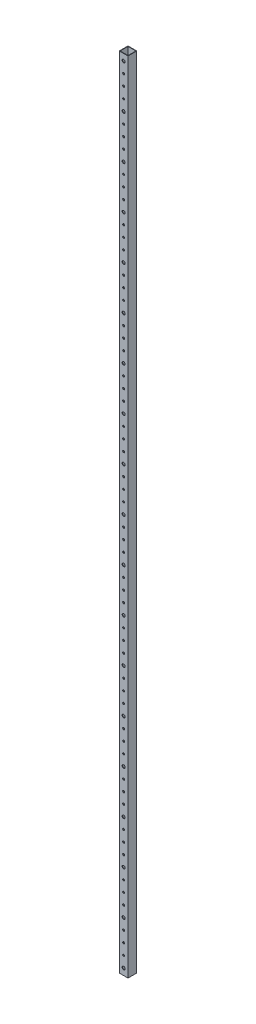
ISO-10303-21;
HEADER;
FILE_DESCRIPTION(('STEP AP214'),'2;1');
FILE_NAME('part.step','',(''),(''),'','','');
FILE_SCHEMA(('AUTOMOTIVE_DESIGN { 1 0 10303 214 1 1 1 1 }'));
ENDSEC;
DATA;
#1=APPLICATION_CONTEXT('core data for automotive mechanical design processes');
#2=APPLICATION_PROTOCOL_DEFINITION('international standard','automotive_design',2000,#1);
#3=PRODUCT_CONTEXT('',#1,'mechanical');
#4=PRODUCT('Part','Part','',(#3));
#5=PRODUCT_RELATED_PRODUCT_CATEGORY('part','',(#4));
#6=PRODUCT_DEFINITION_FORMATION('','',#4);
#7=PRODUCT_DEFINITION_CONTEXT('part definition',#1,'design');
#8=PRODUCT_DEFINITION('design','',#6,#7);
#9=PRODUCT_DEFINITION_SHAPE('','',#8);
#10=(LENGTH_UNIT() NAMED_UNIT(*) SI_UNIT(.MILLI.,.METRE.));
#11=(NAMED_UNIT(*) PLANE_ANGLE_UNIT() SI_UNIT($,.RADIAN.));
#12=(NAMED_UNIT(*) SI_UNIT($,.STERADIAN.) SOLID_ANGLE_UNIT());
#13=UNCERTAINTY_MEASURE_WITH_UNIT(LENGTH_MEASURE(1.E-05),#10,'distance_accuracy_value','');
#14=(GEOMETRIC_REPRESENTATION_CONTEXT(3) GLOBAL_UNCERTAINTY_ASSIGNED_CONTEXT((#13)) GLOBAL_UNIT_ASSIGNED_CONTEXT((#10,
#11,#12)) REPRESENTATION_CONTEXT('',''));
#15=CARTESIAN_POINT('',(0.,0.,0.));
#16=DIRECTION('',(0.,0.,1.));
#17=DIRECTION('',(1.,0.,0.));
#18=AXIS2_PLACEMENT_3D('',#15,#16,#17);
#19=CARTESIAN_POINT('',(-22.1414213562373,1830.,9.00000000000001));
#20=DIRECTION('',(0.,0.,-1.));
#21=DIRECTION('',(-1.,0.,0.));
#22=AXIS2_PLACEMENT_3D('',#19,#20,#21);
#23=PLANE('',#22);
#24=CARTESIAN_POINT('',(0.,1790.,9.00000000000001));
#25=DIRECTION('',(0.,0.,-1.));
#26=DIRECTION('',(-1.,0.,0.));
#27=AXIS2_PLACEMENT_3D('',#24,#25,#26);
#28=CIRCLE('',#27,2.25);
#29=CARTESIAN_POINT('',(-2.25,1790.,9.00000000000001));
#30=VERTEX_POINT('',#29);
#31=EDGE_CURVE('E1176',#30,#30,#28,.T.);
#32=ORIENTED_EDGE('',*,*,#31,.F.);
#33=EDGE_LOOP('',(#32));
#34=FACE_BOUND('',#33,.T.);
#35=CARTESIAN_POINT('',(0.,1765.,9.00000000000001));
#36=DIRECTION('',(0.,0.,-1.));
#37=DIRECTION('',(-1.,0.,0.));
#38=AXIS2_PLACEMENT_3D('',#35,#36,#37);
#39=CIRCLE('',#38,2.25);
#40=CARTESIAN_POINT('',(-2.25,1765.,9.00000000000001));
#41=VERTEX_POINT('',#40);
#42=EDGE_CURVE('E1170',#41,#41,#39,.T.);
#43=ORIENTED_EDGE('',*,*,#42,.F.);
#44=EDGE_LOOP('',(#43));
#45=FACE_BOUND('',#44,.T.);
#46=CARTESIAN_POINT('',(0.,1740.,9.00000000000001));
#47=DIRECTION('',(0.,0.,-1.));
#48=DIRECTION('',(-1.,0.,0.));
#49=AXIS2_PLACEMENT_3D('',#46,#47,#48);
#50=CIRCLE('',#49,2.25);
#51=CARTESIAN_POINT('',(-2.25,1740.,9.00000000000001));
#52=VERTEX_POINT('',#51);
#53=EDGE_CURVE('E1164',#52,#52,#50,.T.);
#54=ORIENTED_EDGE('',*,*,#53,.F.);
#55=EDGE_LOOP('',(#54));
#56=FACE_BOUND('',#55,.T.);
#57=CARTESIAN_POINT('',(0.,1690.,9.00000000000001));
#58=DIRECTION('',(0.,0.,-1.));
#59=DIRECTION('',(-1.,0.,0.));
#60=AXIS2_PLACEMENT_3D('',#57,#58,#59);
#61=CIRCLE('',#60,2.25);
#62=CARTESIAN_POINT('',(-2.25,1690.,9.00000000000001));
#63=VERTEX_POINT('',#62);
#64=EDGE_CURVE('E1158',#63,#63,#61,.T.);
#65=ORIENTED_EDGE('',*,*,#64,.F.);
#66=EDGE_LOOP('',(#65));
#67=FACE_BOUND('',#66,.T.);
#68=CARTESIAN_POINT('',(0.,1665.,9.00000000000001));
#69=DIRECTION('',(0.,0.,-1.));
#70=DIRECTION('',(-1.,0.,0.));
#71=AXIS2_PLACEMENT_3D('',#68,#69,#70);
#72=CIRCLE('',#71,2.25);
#73=CARTESIAN_POINT('',(-2.25,1665.,9.00000000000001));
#74=VERTEX_POINT('',#73);
#75=EDGE_CURVE('E1152',#74,#74,#72,.T.);
#76=ORIENTED_EDGE('',*,*,#75,.F.);
#77=EDGE_LOOP('',(#76));
#78=FACE_BOUND('',#77,.T.);
#79=CARTESIAN_POINT('',(0.,1640.,9.00000000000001));
#80=DIRECTION('',(0.,0.,-1.));
#81=DIRECTION('',(-1.,0.,0.));
#82=AXIS2_PLACEMENT_3D('',#79,#80,#81);
#83=CIRCLE('',#82,2.25);
#84=CARTESIAN_POINT('',(-2.25,1640.,9.00000000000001));
#85=VERTEX_POINT('',#84);
#86=EDGE_CURVE('E1146',#85,#85,#83,.T.);
#87=ORIENTED_EDGE('',*,*,#86,.F.);
#88=EDGE_LOOP('',(#87));
#89=FACE_BOUND('',#88,.T.);
#90=CARTESIAN_POINT('',(0.,1590.,9.00000000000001));
#91=DIRECTION('',(0.,0.,-1.));
#92=DIRECTION('',(-1.,0.,0.));
#93=AXIS2_PLACEMENT_3D('',#90,#91,#92);
#94=CIRCLE('',#93,2.25);
#95=CARTESIAN_POINT('',(-2.25,1590.,9.00000000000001));
#96=VERTEX_POINT('',#95);
#97=EDGE_CURVE('E1140',#96,#96,#94,.T.);
#98=ORIENTED_EDGE('',*,*,#97,.F.);
#99=EDGE_LOOP('',(#98));
#100=FACE_BOUND('',#99,.T.);
#101=CARTESIAN_POINT('',(0.,1565.,9.00000000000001));
#102=DIRECTION('',(0.,0.,-1.));
#103=DIRECTION('',(-1.,0.,0.));
#104=AXIS2_PLACEMENT_3D('',#101,#102,#103);
#105=CIRCLE('',#104,2.25);
#106=CARTESIAN_POINT('',(-2.25,1565.,9.00000000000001));
#107=VERTEX_POINT('',#106);
#108=EDGE_CURVE('E1134',#107,#107,#105,.T.);
#109=ORIENTED_EDGE('',*,*,#108,.F.);
#110=EDGE_LOOP('',(#109));
#111=FACE_BOUND('',#110,.T.);
#112=CARTESIAN_POINT('',(0.,1540.,9.00000000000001));
#113=DIRECTION('',(0.,0.,-1.));
#114=DIRECTION('',(-1.,0.,0.));
#115=AXIS2_PLACEMENT_3D('',#112,#113,#114);
#116=CIRCLE('',#115,2.25);
#117=CARTESIAN_POINT('',(-2.25,1540.,9.00000000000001));
#118=VERTEX_POINT('',#117);
#119=EDGE_CURVE('E1128',#118,#118,#116,.T.);
#120=ORIENTED_EDGE('',*,*,#119,.F.);
#121=EDGE_LOOP('',(#120));
#122=FACE_BOUND('',#121,.T.);
#123=CARTESIAN_POINT('',(0.,1490.,9.00000000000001));
#124=DIRECTION('',(0.,0.,-1.));
#125=DIRECTION('',(-1.,0.,0.));
#126=AXIS2_PLACEMENT_3D('',#123,#124,#125);
#127=CIRCLE('',#126,2.25);
#128=CARTESIAN_POINT('',(-2.25,1490.,9.00000000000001));
#129=VERTEX_POINT('',#128);
#130=EDGE_CURVE('E1122',#129,#129,#127,.T.);
#131=ORIENTED_EDGE('',*,*,#130,.F.);
#132=EDGE_LOOP('',(#131));
#133=FACE_BOUND('',#132,.T.);
#134=CARTESIAN_POINT('',(0.,1465.,9.00000000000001));
#135=DIRECTION('',(0.,0.,-1.));
#136=DIRECTION('',(-1.,0.,0.));
#137=AXIS2_PLACEMENT_3D('',#134,#135,#136);
#138=CIRCLE('',#137,2.25);
#139=CARTESIAN_POINT('',(-2.25,1465.,9.00000000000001));
#140=VERTEX_POINT('',#139);
#141=EDGE_CURVE('E1116',#140,#140,#138,.T.);
#142=ORIENTED_EDGE('',*,*,#141,.F.);
#143=EDGE_LOOP('',(#142));
#144=FACE_BOUND('',#143,.T.);
#145=CARTESIAN_POINT('',(0.,1440.,9.00000000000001));
#146=DIRECTION('',(0.,0.,-1.));
#147=DIRECTION('',(-1.,0.,0.));
#148=AXIS2_PLACEMENT_3D('',#145,#146,#147);
#149=CIRCLE('',#148,2.25);
#150=CARTESIAN_POINT('',(-2.25,1440.,9.00000000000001));
#151=VERTEX_POINT('',#150);
#152=EDGE_CURVE('E1110',#151,#151,#149,.T.);
#153=ORIENTED_EDGE('',*,*,#152,.F.);
#154=EDGE_LOOP('',(#153));
#155=FACE_BOUND('',#154,.T.);
#156=CARTESIAN_POINT('',(0.,1390.,9.00000000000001));
#157=DIRECTION('',(0.,0.,-1.));
#158=DIRECTION('',(-1.,0.,0.));
#159=AXIS2_PLACEMENT_3D('',#156,#157,#158);
#160=CIRCLE('',#159,2.25);
#161=CARTESIAN_POINT('',(-2.25,1390.,9.00000000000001));
#162=VERTEX_POINT('',#161);
#163=EDGE_CURVE('E1104',#162,#162,#160,.T.);
#164=ORIENTED_EDGE('',*,*,#163,.F.);
#165=EDGE_LOOP('',(#164));
#166=FACE_BOUND('',#165,.T.);
#167=CARTESIAN_POINT('',(0.,1365.,9.00000000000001));
#168=DIRECTION('',(0.,0.,-1.));
#169=DIRECTION('',(-1.,0.,0.));
#170=AXIS2_PLACEMENT_3D('',#167,#168,#169);
#171=CIRCLE('',#170,2.25);
#172=CARTESIAN_POINT('',(-2.25,1365.,9.00000000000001));
#173=VERTEX_POINT('',#172);
#174=EDGE_CURVE('E1098',#173,#173,#171,.T.);
#175=ORIENTED_EDGE('',*,*,#174,.F.);
#176=EDGE_LOOP('',(#175));
#177=FACE_BOUND('',#176,.T.);
#178=CARTESIAN_POINT('',(0.,1340.,9.00000000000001));
#179=DIRECTION('',(0.,0.,-1.));
#180=DIRECTION('',(-1.,0.,0.));
#181=AXIS2_PLACEMENT_3D('',#178,#179,#180);
#182=CIRCLE('',#181,2.25);
#183=CARTESIAN_POINT('',(-2.25,1340.,9.00000000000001));
#184=VERTEX_POINT('',#183);
#185=EDGE_CURVE('E1092',#184,#184,#182,.T.);
#186=ORIENTED_EDGE('',*,*,#185,.F.);
#187=EDGE_LOOP('',(#186));
#188=FACE_BOUND('',#187,.T.);
#189=CARTESIAN_POINT('',(0.,1290.,9.00000000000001));
#190=DIRECTION('',(0.,0.,-1.));
#191=DIRECTION('',(-1.,0.,0.));
#192=AXIS2_PLACEMENT_3D('',#189,#190,#191);
#193=CIRCLE('',#192,2.25);
#194=CARTESIAN_POINT('',(-2.25,1290.,9.00000000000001));
#195=VERTEX_POINT('',#194);
#196=EDGE_CURVE('E1086',#195,#195,#193,.T.);
#197=ORIENTED_EDGE('',*,*,#196,.F.);
#198=EDGE_LOOP('',(#197));
#199=FACE_BOUND('',#198,.T.);
#200=CARTESIAN_POINT('',(0.,1265.,9.00000000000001));
#201=DIRECTION('',(0.,0.,-1.));
#202=DIRECTION('',(-1.,0.,0.));
#203=AXIS2_PLACEMENT_3D('',#200,#201,#202);
#204=CIRCLE('',#203,2.25);
#205=CARTESIAN_POINT('',(-2.25,1265.,9.00000000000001));
#206=VERTEX_POINT('',#205);
#207=EDGE_CURVE('E1080',#206,#206,#204,.T.);
#208=ORIENTED_EDGE('',*,*,#207,.F.);
#209=EDGE_LOOP('',(#208));
#210=FACE_BOUND('',#209,.T.);
#211=CARTESIAN_POINT('',(0.,1240.,9.00000000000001));
#212=DIRECTION('',(0.,0.,-1.));
#213=DIRECTION('',(-1.,0.,0.));
#214=AXIS2_PLACEMENT_3D('',#211,#212,#213);
#215=CIRCLE('',#214,2.25);
#216=CARTESIAN_POINT('',(-2.25,1240.,9.00000000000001));
#217=VERTEX_POINT('',#216);
#218=EDGE_CURVE('E1074',#217,#217,#215,.T.);
#219=ORIENTED_EDGE('',*,*,#218,.F.);
#220=EDGE_LOOP('',(#219));
#221=FACE_BOUND('',#220,.T.);
#222=CARTESIAN_POINT('',(0.,1190.,9.00000000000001));
#223=DIRECTION('',(0.,0.,-1.));
#224=DIRECTION('',(-1.,0.,0.));
#225=AXIS2_PLACEMENT_3D('',#222,#223,#224);
#226=CIRCLE('',#225,2.25);
#227=CARTESIAN_POINT('',(-2.25,1190.,9.00000000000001));
#228=VERTEX_POINT('',#227);
#229=EDGE_CURVE('E1068',#228,#228,#226,.T.);
#230=ORIENTED_EDGE('',*,*,#229,.F.);
#231=EDGE_LOOP('',(#230));
#232=FACE_BOUND('',#231,.T.);
#233=CARTESIAN_POINT('',(0.,1165.,9.00000000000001));
#234=DIRECTION('',(0.,0.,-1.));
#235=DIRECTION('',(-1.,0.,0.));
#236=AXIS2_PLACEMENT_3D('',#233,#234,#235);
#237=CIRCLE('',#236,2.25);
#238=CARTESIAN_POINT('',(-2.25,1165.,9.00000000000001));
#239=VERTEX_POINT('',#238);
#240=EDGE_CURVE('E1062',#239,#239,#237,.T.);
#241=ORIENTED_EDGE('',*,*,#240,.F.);
#242=EDGE_LOOP('',(#241));
#243=FACE_BOUND('',#242,.T.);
#244=CARTESIAN_POINT('',(0.,1140.,9.00000000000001));
#245=DIRECTION('',(0.,0.,-1.));
#246=DIRECTION('',(-1.,0.,0.));
#247=AXIS2_PLACEMENT_3D('',#244,#245,#246);
#248=CIRCLE('',#247,2.25);
#249=CARTESIAN_POINT('',(-2.25,1140.,9.00000000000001));
#250=VERTEX_POINT('',#249);
#251=EDGE_CURVE('E1056',#250,#250,#248,.T.);
#252=ORIENTED_EDGE('',*,*,#251,.F.);
#253=EDGE_LOOP('',(#252));
#254=FACE_BOUND('',#253,.T.);
#255=CARTESIAN_POINT('',(0.,1090.,9.00000000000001));
#256=DIRECTION('',(0.,0.,-1.));
#257=DIRECTION('',(-1.,0.,0.));
#258=AXIS2_PLACEMENT_3D('',#255,#256,#257);
#259=CIRCLE('',#258,2.25);
#260=CARTESIAN_POINT('',(-2.25,1090.,9.00000000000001));
#261=VERTEX_POINT('',#260);
#262=EDGE_CURVE('E1050',#261,#261,#259,.T.);
#263=ORIENTED_EDGE('',*,*,#262,.F.);
#264=EDGE_LOOP('',(#263));
#265=FACE_BOUND('',#264,.T.);
#266=CARTESIAN_POINT('',(0.,1065.,9.00000000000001));
#267=DIRECTION('',(0.,0.,-1.));
#268=DIRECTION('',(-1.,0.,0.));
#269=AXIS2_PLACEMENT_3D('',#266,#267,#268);
#270=CIRCLE('',#269,2.25);
#271=CARTESIAN_POINT('',(-2.25,1065.,9.00000000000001));
#272=VERTEX_POINT('',#271);
#273=EDGE_CURVE('E1044',#272,#272,#270,.T.);
#274=ORIENTED_EDGE('',*,*,#273,.F.);
#275=EDGE_LOOP('',(#274));
#276=FACE_BOUND('',#275,.T.);
#277=CARTESIAN_POINT('',(0.,1040.,9.00000000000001));
#278=DIRECTION('',(0.,0.,-1.));
#279=DIRECTION('',(-1.,0.,0.));
#280=AXIS2_PLACEMENT_3D('',#277,#278,#279);
#281=CIRCLE('',#280,2.25);
#282=CARTESIAN_POINT('',(-2.25,1040.,9.00000000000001));
#283=VERTEX_POINT('',#282);
#284=EDGE_CURVE('E1038',#283,#283,#281,.T.);
#285=ORIENTED_EDGE('',*,*,#284,.F.);
#286=EDGE_LOOP('',(#285));
#287=FACE_BOUND('',#286,.T.);
#288=CARTESIAN_POINT('',(0.,990.,9.00000000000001));
#289=DIRECTION('',(0.,0.,-1.));
#290=DIRECTION('',(-1.,0.,0.));
#291=AXIS2_PLACEMENT_3D('',#288,#289,#290);
#292=CIRCLE('',#291,2.25);
#293=CARTESIAN_POINT('',(-2.25,990.,9.00000000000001));
#294=VERTEX_POINT('',#293);
#295=EDGE_CURVE('E1032',#294,#294,#292,.T.);
#296=ORIENTED_EDGE('',*,*,#295,.F.);
#297=EDGE_LOOP('',(#296));
#298=FACE_BOUND('',#297,.T.);
#299=CARTESIAN_POINT('',(0.,965.,9.00000000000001));
#300=DIRECTION('',(0.,0.,-1.));
#301=DIRECTION('',(-1.,0.,0.));
#302=AXIS2_PLACEMENT_3D('',#299,#300,#301);
#303=CIRCLE('',#302,2.25);
#304=CARTESIAN_POINT('',(-2.25,965.,9.00000000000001));
#305=VERTEX_POINT('',#304);
#306=EDGE_CURVE('E1026',#305,#305,#303,.T.);
#307=ORIENTED_EDGE('',*,*,#306,.F.);
#308=EDGE_LOOP('',(#307));
#309=FACE_BOUND('',#308,.T.);
#310=CARTESIAN_POINT('',(0.,940.,9.00000000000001));
#311=DIRECTION('',(0.,0.,-1.));
#312=DIRECTION('',(-1.,0.,0.));
#313=AXIS2_PLACEMENT_3D('',#310,#311,#312);
#314=CIRCLE('',#313,2.25);
#315=CARTESIAN_POINT('',(-2.25,940.,9.00000000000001));
#316=VERTEX_POINT('',#315);
#317=EDGE_CURVE('E1020',#316,#316,#314,.T.);
#318=ORIENTED_EDGE('',*,*,#317,.F.);
#319=EDGE_LOOP('',(#318));
#320=FACE_BOUND('',#319,.T.);
#321=CARTESIAN_POINT('',(0.,890.,9.00000000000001));
#322=DIRECTION('',(0.,0.,-1.));
#323=DIRECTION('',(-1.,0.,0.));
#324=AXIS2_PLACEMENT_3D('',#321,#322,#323);
#325=CIRCLE('',#324,2.25);
#326=CARTESIAN_POINT('',(-2.25,890.,9.00000000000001));
#327=VERTEX_POINT('',#326);
#328=EDGE_CURVE('E1014',#327,#327,#325,.T.);
#329=ORIENTED_EDGE('',*,*,#328,.F.);
#330=EDGE_LOOP('',(#329));
#331=FACE_BOUND('',#330,.T.);
#332=CARTESIAN_POINT('',(0.,865.,9.00000000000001));
#333=DIRECTION('',(0.,0.,-1.));
#334=DIRECTION('',(-1.,0.,0.));
#335=AXIS2_PLACEMENT_3D('',#332,#333,#334);
#336=CIRCLE('',#335,2.25);
#337=CARTESIAN_POINT('',(-2.25,865.,9.00000000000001));
#338=VERTEX_POINT('',#337);
#339=EDGE_CURVE('E1008',#338,#338,#336,.T.);
#340=ORIENTED_EDGE('',*,*,#339,.F.);
#341=EDGE_LOOP('',(#340));
#342=FACE_BOUND('',#341,.T.);
#343=CARTESIAN_POINT('',(0.,840.,9.00000000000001));
#344=DIRECTION('',(0.,0.,-1.));
#345=DIRECTION('',(-1.,0.,0.));
#346=AXIS2_PLACEMENT_3D('',#343,#344,#345);
#347=CIRCLE('',#346,2.25);
#348=CARTESIAN_POINT('',(-2.25,840.,9.00000000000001));
#349=VERTEX_POINT('',#348);
#350=EDGE_CURVE('E1002',#349,#349,#347,.T.);
#351=ORIENTED_EDGE('',*,*,#350,.F.);
#352=EDGE_LOOP('',(#351));
#353=FACE_BOUND('',#352,.T.);
#354=CARTESIAN_POINT('',(0.,790.,9.00000000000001));
#355=DIRECTION('',(0.,0.,-1.));
#356=DIRECTION('',(-1.,0.,0.));
#357=AXIS2_PLACEMENT_3D('',#354,#355,#356);
#358=CIRCLE('',#357,2.25);
#359=CARTESIAN_POINT('',(-2.25,790.,9.00000000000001));
#360=VERTEX_POINT('',#359);
#361=EDGE_CURVE('E996',#360,#360,#358,.T.);
#362=ORIENTED_EDGE('',*,*,#361,.F.);
#363=EDGE_LOOP('',(#362));
#364=FACE_BOUND('',#363,.T.);
#365=CARTESIAN_POINT('',(0.,765.,9.00000000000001));
#366=DIRECTION('',(0.,0.,-1.));
#367=DIRECTION('',(-1.,0.,0.));
#368=AXIS2_PLACEMENT_3D('',#365,#366,#367);
#369=CIRCLE('',#368,2.25);
#370=CARTESIAN_POINT('',(-2.25,765.,9.00000000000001));
#371=VERTEX_POINT('',#370);
#372=EDGE_CURVE('E990',#371,#371,#369,.T.);
#373=ORIENTED_EDGE('',*,*,#372,.F.);
#374=EDGE_LOOP('',(#373));
#375=FACE_BOUND('',#374,.T.);
#376=CARTESIAN_POINT('',(0.,740.,9.00000000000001));
#377=DIRECTION('',(0.,0.,-1.));
#378=DIRECTION('',(-1.,0.,0.));
#379=AXIS2_PLACEMENT_3D('',#376,#377,#378);
#380=CIRCLE('',#379,2.25);
#381=CARTESIAN_POINT('',(-2.25,740.,9.00000000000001));
#382=VERTEX_POINT('',#381);
#383=EDGE_CURVE('E984',#382,#382,#380,.T.);
#384=ORIENTED_EDGE('',*,*,#383,.F.);
#385=EDGE_LOOP('',(#384));
#386=FACE_BOUND('',#385,.T.);
#387=CARTESIAN_POINT('',(0.,690.,9.00000000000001));
#388=DIRECTION('',(0.,0.,-1.));
#389=DIRECTION('',(-1.,0.,0.));
#390=AXIS2_PLACEMENT_3D('',#387,#388,#389);
#391=CIRCLE('',#390,2.25);
#392=CARTESIAN_POINT('',(-2.25,690.,9.00000000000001));
#393=VERTEX_POINT('',#392);
#394=EDGE_CURVE('E978',#393,#393,#391,.T.);
#395=ORIENTED_EDGE('',*,*,#394,.F.);
#396=EDGE_LOOP('',(#395));
#397=FACE_BOUND('',#396,.T.);
#398=CARTESIAN_POINT('',(0.,665.,9.00000000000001));
#399=DIRECTION('',(0.,0.,-1.));
#400=DIRECTION('',(-1.,0.,0.));
#401=AXIS2_PLACEMENT_3D('',#398,#399,#400);
#402=CIRCLE('',#401,2.25);
#403=CARTESIAN_POINT('',(-2.25,665.,9.00000000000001));
#404=VERTEX_POINT('',#403);
#405=EDGE_CURVE('E972',#404,#404,#402,.T.);
#406=ORIENTED_EDGE('',*,*,#405,.F.);
#407=EDGE_LOOP('',(#406));
#408=FACE_BOUND('',#407,.T.);
#409=CARTESIAN_POINT('',(0.,640.,9.00000000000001));
#410=DIRECTION('',(0.,0.,-1.));
#411=DIRECTION('',(-1.,0.,0.));
#412=AXIS2_PLACEMENT_3D('',#409,#410,#411);
#413=CIRCLE('',#412,2.25);
#414=CARTESIAN_POINT('',(-2.25,640.,9.00000000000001));
#415=VERTEX_POINT('',#414);
#416=EDGE_CURVE('E966',#415,#415,#413,.T.);
#417=ORIENTED_EDGE('',*,*,#416,.F.);
#418=EDGE_LOOP('',(#417));
#419=FACE_BOUND('',#418,.T.);
#420=CARTESIAN_POINT('',(0.,590.,9.00000000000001));
#421=DIRECTION('',(0.,0.,-1.));
#422=DIRECTION('',(-1.,0.,0.));
#423=AXIS2_PLACEMENT_3D('',#420,#421,#422);
#424=CIRCLE('',#423,2.25);
#425=CARTESIAN_POINT('',(-2.25,590.,9.00000000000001));
#426=VERTEX_POINT('',#425);
#427=EDGE_CURVE('E960',#426,#426,#424,.T.);
#428=ORIENTED_EDGE('',*,*,#427,.F.);
#429=EDGE_LOOP('',(#428));
#430=FACE_BOUND('',#429,.T.);
#431=CARTESIAN_POINT('',(0.,565.,9.00000000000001));
#432=DIRECTION('',(0.,0.,-1.));
#433=DIRECTION('',(-1.,0.,0.));
#434=AXIS2_PLACEMENT_3D('',#431,#432,#433);
#435=CIRCLE('',#434,2.25);
#436=CARTESIAN_POINT('',(-2.25,565.,9.00000000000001));
#437=VERTEX_POINT('',#436);
#438=EDGE_CURVE('E954',#437,#437,#435,.T.);
#439=ORIENTED_EDGE('',*,*,#438,.F.);
#440=EDGE_LOOP('',(#439));
#441=FACE_BOUND('',#440,.T.);
#442=CARTESIAN_POINT('',(0.,540.,9.00000000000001));
#443=DIRECTION('',(0.,0.,-1.));
#444=DIRECTION('',(-1.,0.,0.));
#445=AXIS2_PLACEMENT_3D('',#442,#443,#444);
#446=CIRCLE('',#445,2.25);
#447=CARTESIAN_POINT('',(-2.25,540.,9.00000000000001));
#448=VERTEX_POINT('',#447);
#449=EDGE_CURVE('E948',#448,#448,#446,.T.);
#450=ORIENTED_EDGE('',*,*,#449,.F.);
#451=EDGE_LOOP('',(#450));
#452=FACE_BOUND('',#451,.T.);
#453=CARTESIAN_POINT('',(0.,490.,9.00000000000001));
#454=DIRECTION('',(0.,0.,-1.));
#455=DIRECTION('',(-1.,0.,0.));
#456=AXIS2_PLACEMENT_3D('',#453,#454,#455);
#457=CIRCLE('',#456,2.25);
#458=CARTESIAN_POINT('',(-2.25,490.,9.00000000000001));
#459=VERTEX_POINT('',#458);
#460=EDGE_CURVE('E942',#459,#459,#457,.T.);
#461=ORIENTED_EDGE('',*,*,#460,.F.);
#462=EDGE_LOOP('',(#461));
#463=FACE_BOUND('',#462,.T.);
#464=CARTESIAN_POINT('',(0.,465.,9.00000000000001));
#465=DIRECTION('',(0.,0.,-1.));
#466=DIRECTION('',(-1.,0.,0.));
#467=AXIS2_PLACEMENT_3D('',#464,#465,#466);
#468=CIRCLE('',#467,2.25);
#469=CARTESIAN_POINT('',(-2.25,465.,9.00000000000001));
#470=VERTEX_POINT('',#469);
#471=EDGE_CURVE('E936',#470,#470,#468,.T.);
#472=ORIENTED_EDGE('',*,*,#471,.F.);
#473=EDGE_LOOP('',(#472));
#474=FACE_BOUND('',#473,.T.);
#475=CARTESIAN_POINT('',(0.,440.,9.00000000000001));
#476=DIRECTION('',(0.,0.,-1.));
#477=DIRECTION('',(-1.,0.,0.));
#478=AXIS2_PLACEMENT_3D('',#475,#476,#477);
#479=CIRCLE('',#478,2.25);
#480=CARTESIAN_POINT('',(-2.25,440.,9.00000000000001));
#481=VERTEX_POINT('',#480);
#482=EDGE_CURVE('E930',#481,#481,#479,.T.);
#483=ORIENTED_EDGE('',*,*,#482,.F.);
#484=EDGE_LOOP('',(#483));
#485=FACE_BOUND('',#484,.T.);
#486=CARTESIAN_POINT('',(0.,390.,9.00000000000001));
#487=DIRECTION('',(0.,0.,-1.));
#488=DIRECTION('',(-1.,0.,0.));
#489=AXIS2_PLACEMENT_3D('',#486,#487,#488);
#490=CIRCLE('',#489,2.25);
#491=CARTESIAN_POINT('',(-2.25,390.,9.00000000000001));
#492=VERTEX_POINT('',#491);
#493=EDGE_CURVE('E924',#492,#492,#490,.T.);
#494=ORIENTED_EDGE('',*,*,#493,.F.);
#495=EDGE_LOOP('',(#494));
#496=FACE_BOUND('',#495,.T.);
#497=CARTESIAN_POINT('',(0.,365.,9.00000000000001));
#498=DIRECTION('',(0.,0.,-1.));
#499=DIRECTION('',(-1.,0.,0.));
#500=AXIS2_PLACEMENT_3D('',#497,#498,#499);
#501=CIRCLE('',#500,2.25);
#502=CARTESIAN_POINT('',(-2.25,365.,9.00000000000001));
#503=VERTEX_POINT('',#502);
#504=EDGE_CURVE('E918',#503,#503,#501,.T.);
#505=ORIENTED_EDGE('',*,*,#504,.F.);
#506=EDGE_LOOP('',(#505));
#507=FACE_BOUND('',#506,.T.);
#508=CARTESIAN_POINT('',(0.,340.,9.00000000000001));
#509=DIRECTION('',(0.,0.,-1.));
#510=DIRECTION('',(-1.,0.,0.));
#511=AXIS2_PLACEMENT_3D('',#508,#509,#510);
#512=CIRCLE('',#511,2.25);
#513=CARTESIAN_POINT('',(-2.25,340.,9.00000000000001));
#514=VERTEX_POINT('',#513);
#515=EDGE_CURVE('E912',#514,#514,#512,.T.);
#516=ORIENTED_EDGE('',*,*,#515,.F.);
#517=EDGE_LOOP('',(#516));
#518=FACE_BOUND('',#517,.T.);
#519=CARTESIAN_POINT('',(0.,290.,9.00000000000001));
#520=DIRECTION('',(0.,0.,-1.));
#521=DIRECTION('',(-1.,0.,0.));
#522=AXIS2_PLACEMENT_3D('',#519,#520,#521);
#523=CIRCLE('',#522,2.25);
#524=CARTESIAN_POINT('',(-2.25,290.,9.00000000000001));
#525=VERTEX_POINT('',#524);
#526=EDGE_CURVE('E906',#525,#525,#523,.T.);
#527=ORIENTED_EDGE('',*,*,#526,.F.);
#528=EDGE_LOOP('',(#527));
#529=FACE_BOUND('',#528,.T.);
#530=CARTESIAN_POINT('',(0.,265.,9.00000000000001));
#531=DIRECTION('',(0.,0.,-1.));
#532=DIRECTION('',(-1.,0.,0.));
#533=AXIS2_PLACEMENT_3D('',#530,#531,#532);
#534=CIRCLE('',#533,2.25);
#535=CARTESIAN_POINT('',(-2.25,265.,9.00000000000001));
#536=VERTEX_POINT('',#535);
#537=EDGE_CURVE('E900',#536,#536,#534,.T.);
#538=ORIENTED_EDGE('',*,*,#537,.F.);
#539=EDGE_LOOP('',(#538));
#540=FACE_BOUND('',#539,.T.);
#541=CARTESIAN_POINT('',(0.,240.,9.00000000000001));
#542=DIRECTION('',(0.,0.,-1.));
#543=DIRECTION('',(-1.,0.,0.));
#544=AXIS2_PLACEMENT_3D('',#541,#542,#543);
#545=CIRCLE('',#544,2.25);
#546=CARTESIAN_POINT('',(-2.25,240.,9.00000000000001));
#547=VERTEX_POINT('',#546);
#548=EDGE_CURVE('E894',#547,#547,#545,.T.);
#549=ORIENTED_EDGE('',*,*,#548,.F.);
#550=EDGE_LOOP('',(#549));
#551=FACE_BOUND('',#550,.T.);
#552=CARTESIAN_POINT('',(0.,190.,9.00000000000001));
#553=DIRECTION('',(0.,0.,-1.));
#554=DIRECTION('',(-1.,0.,0.));
#555=AXIS2_PLACEMENT_3D('',#552,#553,#554);
#556=CIRCLE('',#555,2.25);
#557=CARTESIAN_POINT('',(-2.25,190.,9.00000000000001));
#558=VERTEX_POINT('',#557);
#559=EDGE_CURVE('E888',#558,#558,#556,.T.);
#560=ORIENTED_EDGE('',*,*,#559,.F.);
#561=EDGE_LOOP('',(#560));
#562=FACE_BOUND('',#561,.T.);
#563=CARTESIAN_POINT('',(0.,165.,9.00000000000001));
#564=DIRECTION('',(0.,0.,-1.));
#565=DIRECTION('',(-1.,0.,0.));
#566=AXIS2_PLACEMENT_3D('',#563,#564,#565);
#567=CIRCLE('',#566,2.25);
#568=CARTESIAN_POINT('',(-2.25,165.,9.00000000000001));
#569=VERTEX_POINT('',#568);
#570=EDGE_CURVE('E882',#569,#569,#567,.T.);
#571=ORIENTED_EDGE('',*,*,#570,.F.);
#572=EDGE_LOOP('',(#571));
#573=FACE_BOUND('',#572,.T.);
#574=CARTESIAN_POINT('',(0.,140.,9.00000000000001));
#575=DIRECTION('',(0.,0.,-1.));
#576=DIRECTION('',(-1.,0.,0.));
#577=AXIS2_PLACEMENT_3D('',#574,#575,#576);
#578=CIRCLE('',#577,2.25);
#579=CARTESIAN_POINT('',(-2.25,140.,9.00000000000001));
#580=VERTEX_POINT('',#579);
#581=EDGE_CURVE('E876',#580,#580,#578,.T.);
#582=ORIENTED_EDGE('',*,*,#581,.F.);
#583=EDGE_LOOP('',(#582));
#584=FACE_BOUND('',#583,.T.);
#585=CARTESIAN_POINT('',(0.,90.,9.00000000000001));
#586=DIRECTION('',(0.,0.,-1.));
#587=DIRECTION('',(-1.,0.,0.));
#588=AXIS2_PLACEMENT_3D('',#585,#586,#587);
#589=CIRCLE('',#588,2.25);
#590=CARTESIAN_POINT('',(-2.25,90.,9.00000000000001));
#591=VERTEX_POINT('',#590);
#592=EDGE_CURVE('E870',#591,#591,#589,.T.);
#593=ORIENTED_EDGE('',*,*,#592,.F.);
#594=EDGE_LOOP('',(#593));
#595=FACE_BOUND('',#594,.T.);
#596=CARTESIAN_POINT('',(0.,65.,9.00000000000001));
#597=DIRECTION('',(0.,0.,-1.));
#598=DIRECTION('',(-1.,0.,0.));
#599=AXIS2_PLACEMENT_3D('',#596,#597,#598);
#600=CIRCLE('',#599,2.25);
#601=CARTESIAN_POINT('',(-2.25,65.,9.00000000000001));
#602=VERTEX_POINT('',#601);
#603=EDGE_CURVE('E864',#602,#602,#600,.T.);
#604=ORIENTED_EDGE('',*,*,#603,.F.);
#605=EDGE_LOOP('',(#604));
#606=FACE_BOUND('',#605,.T.);
#607=CARTESIAN_POINT('',(0.,40.,9.00000000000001));
#608=DIRECTION('',(0.,0.,-1.));
#609=DIRECTION('',(-1.,0.,0.));
#610=AXIS2_PLACEMENT_3D('',#607,#608,#609);
#611=CIRCLE('',#610,2.25);
#612=CARTESIAN_POINT('',(-2.25,40.,9.00000000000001));
#613=VERTEX_POINT('',#612);
#614=EDGE_CURVE('E859',#613,#613,#611,.T.);
#615=ORIENTED_EDGE('',*,*,#614,.F.);
#616=EDGE_LOOP('',(#615));
#617=FACE_BOUND('',#616,.T.);
#618=CARTESIAN_POINT('',(0.,115.,9.00000000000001));
#619=DIRECTION('',(0.,0.,-1.));
#620=DIRECTION('',(-1.,0.,0.));
#621=AXIS2_PLACEMENT_3D('',#618,#619,#620);
#622=CIRCLE('',#621,3.5);
#623=CARTESIAN_POINT('',(-3.5,115.,9.00000000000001));
#624=VERTEX_POINT('',#623);
#625=EDGE_CURVE('E856',#624,#624,#622,.T.);
#626=ORIENTED_EDGE('',*,*,#625,.F.);
#627=EDGE_LOOP('',(#626));
#628=FACE_BOUND('',#627,.T.);
#629=CARTESIAN_POINT('',(0.,15.,9.00000000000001));
#630=DIRECTION('',(0.,0.,-1.));
#631=DIRECTION('',(-1.,0.,0.));
#632=AXIS2_PLACEMENT_3D('',#629,#630,#631);
#633=CIRCLE('',#632,3.5);
#634=CARTESIAN_POINT('',(-3.5,15.,9.00000000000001));
#635=VERTEX_POINT('',#634);
#636=EDGE_CURVE('E607',#635,#635,#633,.T.);
#637=ORIENTED_EDGE('',*,*,#636,.F.);
#638=EDGE_LOOP('',(#637));
#639=FACE_BOUND('',#638,.T.);
#640=DIRECTION('',(1.,0.,0.));
#641=VECTOR('',#640,1.);
#642=CARTESIAN_POINT('',(-22.1414213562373,0.,9.00000000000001));
#643=LINE('',#642,#641);
#644=CARTESIAN_POINT('',(-9.00000000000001,0.,9.00000000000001));
#645=VERTEX_POINT('',#644);
#646=CARTESIAN_POINT('',(9.,0.,9.00000000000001));
#647=VERTEX_POINT('',#646);
#648=EDGE_CURVE('E662',#645,#647,#643,.T.);
#649=ORIENTED_EDGE('',*,*,#648,.F.);
#650=DIRECTION('',(0.,-1.,0.));
#651=VECTOR('',#650,1.);
#652=CARTESIAN_POINT('',(-9.00000000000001,1830.,9.00000000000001));
#653=LINE('',#652,#651);
#654=CARTESIAN_POINT('',(-9.00000000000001,1830.,9.00000000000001));
#655=VERTEX_POINT('',#654);
#656=EDGE_CURVE('E149',#655,#645,#653,.T.);
#657=ORIENTED_EDGE('',*,*,#656,.F.);
#658=DIRECTION('',(1.,0.,0.));
#659=VECTOR('',#658,1.);
#660=CARTESIAN_POINT('',(-22.1414213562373,1830.,9.00000000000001));
#661=LINE('',#660,#659);
#662=CARTESIAN_POINT('',(9.,1830.,9.00000000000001));
#663=VERTEX_POINT('',#662);
#664=EDGE_CURVE('E143',#655,#663,#661,.T.);
#665=ORIENTED_EDGE('',*,*,#664,.T.);
#666=DIRECTION('',(0.,-1.,0.));
#667=VECTOR('',#666,1.);
#668=CARTESIAN_POINT('',(9.,1830.,9.00000000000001));
#669=LINE('',#668,#667);
#670=EDGE_CURVE('E49',#663,#647,#669,.T.);
#671=ORIENTED_EDGE('',*,*,#670,.T.);
#672=EDGE_LOOP('',(#649,#657,#665,#671));
#673=FACE_BOUND('',#672,.T.);
#674=CARTESIAN_POINT('',(0.,215.,9.00000000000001));
#675=DIRECTION('',(0.,0.,-1.));
#676=DIRECTION('',(-1.,0.,0.));
#677=AXIS2_PLACEMENT_3D('',#674,#675,#676);
#678=CIRCLE('',#677,3.5);
#679=CARTESIAN_POINT('',(-3.5,215.,9.00000000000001));
#680=VERTEX_POINT('',#679);
#681=EDGE_CURVE('E274',#680,#680,#678,.T.);
#682=ORIENTED_EDGE('',*,*,#681,.F.);
#683=EDGE_LOOP('',(#682));
#684=FACE_BOUND('',#683,.T.);
#685=CARTESIAN_POINT('',(0.,315.,9.00000000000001));
#686=DIRECTION('',(0.,0.,-1.));
#687=DIRECTION('',(-1.,0.,0.));
#688=AXIS2_PLACEMENT_3D('',#685,#686,#687);
#689=CIRCLE('',#688,3.5);
#690=CARTESIAN_POINT('',(-3.5,315.,9.00000000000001));
#691=VERTEX_POINT('',#690);
#692=EDGE_CURVE('E280',#691,#691,#689,.T.);
#693=ORIENTED_EDGE('',*,*,#692,.F.);
#694=EDGE_LOOP('',(#693));
#695=FACE_BOUND('',#694,.T.);
#696=CARTESIAN_POINT('',(0.,415.,9.00000000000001));
#697=DIRECTION('',(0.,0.,-1.));
#698=DIRECTION('',(-1.,0.,0.));
#699=AXIS2_PLACEMENT_3D('',#696,#697,#698);
#700=CIRCLE('',#699,3.5);
#701=CARTESIAN_POINT('',(-3.5,415.,9.00000000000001));
#702=VERTEX_POINT('',#701);
#703=EDGE_CURVE('E286',#702,#702,#700,.T.);
#704=ORIENTED_EDGE('',*,*,#703,.F.);
#705=EDGE_LOOP('',(#704));
#706=FACE_BOUND('',#705,.T.);
#707=CARTESIAN_POINT('',(0.,515.,9.00000000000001));
#708=DIRECTION('',(0.,0.,-1.));
#709=DIRECTION('',(-1.,0.,0.));
#710=AXIS2_PLACEMENT_3D('',#707,#708,#709);
#711=CIRCLE('',#710,3.5);
#712=CARTESIAN_POINT('',(-3.5,515.,9.00000000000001));
#713=VERTEX_POINT('',#712);
#714=EDGE_CURVE('E292',#713,#713,#711,.T.);
#715=ORIENTED_EDGE('',*,*,#714,.F.);
#716=EDGE_LOOP('',(#715));
#717=FACE_BOUND('',#716,.T.);
#718=CARTESIAN_POINT('',(0.,615.,9.00000000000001));
#719=DIRECTION('',(0.,0.,-1.));
#720=DIRECTION('',(-1.,0.,0.));
#721=AXIS2_PLACEMENT_3D('',#718,#719,#720);
#722=CIRCLE('',#721,3.5);
#723=CARTESIAN_POINT('',(-3.5,615.,9.00000000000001));
#724=VERTEX_POINT('',#723);
#725=EDGE_CURVE('E298',#724,#724,#722,.T.);
#726=ORIENTED_EDGE('',*,*,#725,.F.);
#727=EDGE_LOOP('',(#726));
#728=FACE_BOUND('',#727,.T.);
#729=CARTESIAN_POINT('',(0.,715.,9.00000000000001));
#730=DIRECTION('',(0.,0.,-1.));
#731=DIRECTION('',(-1.,0.,0.));
#732=AXIS2_PLACEMENT_3D('',#729,#730,#731);
#733=CIRCLE('',#732,3.5);
#734=CARTESIAN_POINT('',(-3.5,715.,9.00000000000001));
#735=VERTEX_POINT('',#734);
#736=EDGE_CURVE('E304',#735,#735,#733,.T.);
#737=ORIENTED_EDGE('',*,*,#736,.F.);
#738=EDGE_LOOP('',(#737));
#739=FACE_BOUND('',#738,.T.);
#740=CARTESIAN_POINT('',(0.,815.,9.00000000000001));
#741=DIRECTION('',(0.,0.,-1.));
#742=DIRECTION('',(-1.,0.,0.));
#743=AXIS2_PLACEMENT_3D('',#740,#741,#742);
#744=CIRCLE('',#743,3.5);
#745=CARTESIAN_POINT('',(-3.5,815.,9.00000000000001));
#746=VERTEX_POINT('',#745);
#747=EDGE_CURVE('E310',#746,#746,#744,.T.);
#748=ORIENTED_EDGE('',*,*,#747,.F.);
#749=EDGE_LOOP('',(#748));
#750=FACE_BOUND('',#749,.T.);
#751=CARTESIAN_POINT('',(0.,915.,9.00000000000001));
#752=DIRECTION('',(0.,0.,-1.));
#753=DIRECTION('',(-1.,0.,0.));
#754=AXIS2_PLACEMENT_3D('',#751,#752,#753);
#755=CIRCLE('',#754,3.5);
#756=CARTESIAN_POINT('',(-3.5,915.,9.00000000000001));
#757=VERTEX_POINT('',#756);
#758=EDGE_CURVE('E316',#757,#757,#755,.T.);
#759=ORIENTED_EDGE('',*,*,#758,.F.);
#760=EDGE_LOOP('',(#759));
#761=FACE_BOUND('',#760,.T.);
#762=CARTESIAN_POINT('',(0.,1015.,9.00000000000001));
#763=DIRECTION('',(0.,0.,-1.));
#764=DIRECTION('',(-1.,0.,0.));
#765=AXIS2_PLACEMENT_3D('',#762,#763,#764);
#766=CIRCLE('',#765,3.5);
#767=CARTESIAN_POINT('',(-3.5,1015.,9.00000000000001));
#768=VERTEX_POINT('',#767);
#769=EDGE_CURVE('E322',#768,#768,#766,.T.);
#770=ORIENTED_EDGE('',*,*,#769,.F.);
#771=EDGE_LOOP('',(#770));
#772=FACE_BOUND('',#771,.T.);
#773=CARTESIAN_POINT('',(0.,1115.,9.00000000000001));
#774=DIRECTION('',(0.,0.,-1.));
#775=DIRECTION('',(-1.,0.,0.));
#776=AXIS2_PLACEMENT_3D('',#773,#774,#775);
#777=CIRCLE('',#776,3.5);
#778=CARTESIAN_POINT('',(-3.5,1115.,9.00000000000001));
#779=VERTEX_POINT('',#778);
#780=EDGE_CURVE('E328',#779,#779,#777,.T.);
#781=ORIENTED_EDGE('',*,*,#780,.F.);
#782=EDGE_LOOP('',(#781));
#783=FACE_BOUND('',#782,.T.);
#784=CARTESIAN_POINT('',(0.,1215.,9.00000000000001));
#785=DIRECTION('',(0.,0.,-1.));
#786=DIRECTION('',(-1.,0.,0.));
#787=AXIS2_PLACEMENT_3D('',#784,#785,#786);
#788=CIRCLE('',#787,3.5);
#789=CARTESIAN_POINT('',(-3.5,1215.,9.00000000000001));
#790=VERTEX_POINT('',#789);
#791=EDGE_CURVE('E334',#790,#790,#788,.T.);
#792=ORIENTED_EDGE('',*,*,#791,.F.);
#793=EDGE_LOOP('',(#792));
#794=FACE_BOUND('',#793,.T.);
#795=CARTESIAN_POINT('',(0.,1315.,9.00000000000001));
#796=DIRECTION('',(0.,0.,-1.));
#797=DIRECTION('',(-1.,0.,0.));
#798=AXIS2_PLACEMENT_3D('',#795,#796,#797);
#799=CIRCLE('',#798,3.5);
#800=CARTESIAN_POINT('',(-3.5,1315.,9.00000000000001));
#801=VERTEX_POINT('',#800);
#802=EDGE_CURVE('E340',#801,#801,#799,.T.);
#803=ORIENTED_EDGE('',*,*,#802,.F.);
#804=EDGE_LOOP('',(#803));
#805=FACE_BOUND('',#804,.T.);
#806=CARTESIAN_POINT('',(0.,1415.,9.00000000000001));
#807=DIRECTION('',(0.,0.,-1.));
#808=DIRECTION('',(-1.,0.,0.));
#809=AXIS2_PLACEMENT_3D('',#806,#807,#808);
#810=CIRCLE('',#809,3.5);
#811=CARTESIAN_POINT('',(-3.5,1415.,9.00000000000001));
#812=VERTEX_POINT('',#811);
#813=EDGE_CURVE('E346',#812,#812,#810,.T.);
#814=ORIENTED_EDGE('',*,*,#813,.F.);
#815=EDGE_LOOP('',(#814));
#816=FACE_BOUND('',#815,.T.);
#817=CARTESIAN_POINT('',(0.,1515.,9.00000000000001));
#818=DIRECTION('',(0.,0.,-1.));
#819=DIRECTION('',(-1.,0.,0.));
#820=AXIS2_PLACEMENT_3D('',#817,#818,#819);
#821=CIRCLE('',#820,3.5);
#822=CARTESIAN_POINT('',(-3.5,1515.,9.00000000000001));
#823=VERTEX_POINT('',#822);
#824=EDGE_CURVE('E352',#823,#823,#821,.T.);
#825=ORIENTED_EDGE('',*,*,#824,.F.);
#826=EDGE_LOOP('',(#825));
#827=FACE_BOUND('',#826,.T.);
#828=CARTESIAN_POINT('',(0.,1615.,9.00000000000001));
#829=DIRECTION('',(0.,0.,-1.));
#830=DIRECTION('',(-1.,0.,0.));
#831=AXIS2_PLACEMENT_3D('',#828,#829,#830);
#832=CIRCLE('',#831,3.5);
#833=CARTESIAN_POINT('',(-3.5,1615.,9.00000000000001));
#834=VERTEX_POINT('',#833);
#835=EDGE_CURVE('E358',#834,#834,#832,.T.);
#836=ORIENTED_EDGE('',*,*,#835,.F.);
#837=EDGE_LOOP('',(#836));
#838=FACE_BOUND('',#837,.T.);
#839=CARTESIAN_POINT('',(0.,1715.,9.00000000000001));
#840=DIRECTION('',(0.,0.,-1.));
#841=DIRECTION('',(-1.,0.,0.));
#842=AXIS2_PLACEMENT_3D('',#839,#840,#841);
#843=CIRCLE('',#842,3.5);
#844=CARTESIAN_POINT('',(-3.5,1715.,9.00000000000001));
#845=VERTEX_POINT('',#844);
#846=EDGE_CURVE('E364',#845,#845,#843,.T.);
#847=ORIENTED_EDGE('',*,*,#846,.F.);
#848=EDGE_LOOP('',(#847));
#849=FACE_BOUND('',#848,.T.);
#850=CARTESIAN_POINT('',(0.,1815.,9.00000000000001));
#851=DIRECTION('',(0.,0.,-1.));
#852=DIRECTION('',(-1.,0.,0.));
#853=AXIS2_PLACEMENT_3D('',#850,#851,#852);
#854=CIRCLE('',#853,3.5);
#855=CARTESIAN_POINT('',(-3.5,1815.,9.00000000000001));
#856=VERTEX_POINT('',#855);
#857=EDGE_CURVE('E41',#856,#856,#854,.T.);
#858=ORIENTED_EDGE('',*,*,#857,.F.);
#859=EDGE_LOOP('',(#858));
#860=FACE_BOUND('',#859,.T.);
#861=ADVANCED_FACE('F32',(#34,#45,#56,#67,#78,#89,#100,#111,#122,#133,#144,#155,#166,#177,#188,
#199,#210,#221,#232,#243,#254,#265,#276,#287,#298,#309,#320,#331,#342,#353,#364,#375,#386,#397,
#408,#419,#430,#441,#452,#463,#474,#485,#496,#507,#518,#529,#540,#551,#562,#573,#584,#595,#606,
#617,#628,#639,#673,#684,#695,#706,#717,#728,#739,#750,#761,#772,#783,#794,#805,#816,#827,#838,
#849,#860),#23,.T.);
#862=CARTESIAN_POINT('',(-9.00000000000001,1830.,0.));
#863=DIRECTION('',(-1.,0.,0.));
#864=DIRECTION('',(0.,0.,1.));
#865=AXIS2_PLACEMENT_3D('',#862,#863,#864);
#866=PLANE('',#865);
#867=DIRECTION('',(0.,0.,-1.));
#868=VECTOR('',#867,1.);
#869=CARTESIAN_POINT('',(-9.00000000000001,0.,0.));
#870=LINE('',#869,#868);
#871=CARTESIAN_POINT('',(-9.00000000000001,0.,-8.99999999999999));
#872=VERTEX_POINT('',#871);
#873=EDGE_CURVE('E148',#645,#872,#870,.T.);
#874=ORIENTED_EDGE('',*,*,#873,.T.);
#875=DIRECTION('',(0.,-1.,0.));
#876=VECTOR('',#875,1.);
#877=CARTESIAN_POINT('',(-9.00000000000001,1830.,-8.99999999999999));
#878=LINE('',#877,#876);
#879=CARTESIAN_POINT('',(-9.00000000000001,1830.,-8.99999999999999));
#880=VERTEX_POINT('',#879);
#881=EDGE_CURVE('E133',#880,#872,#878,.T.);
#882=ORIENTED_EDGE('',*,*,#881,.F.);
#883=DIRECTION('',(0.,0.,-1.));
#884=VECTOR('',#883,1.);
#885=CARTESIAN_POINT('',(-9.00000000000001,1830.,0.));
#886=LINE('',#885,#884);
#887=EDGE_CURVE('E138',#655,#880,#886,.T.);
#888=ORIENTED_EDGE('',*,*,#887,.F.);
#889=ORIENTED_EDGE('',*,*,#656,.T.);
#890=EDGE_LOOP('',(#874,#882,#888,#889));
#891=FACE_BOUND('',#890,.T.);
#892=ADVANCED_FACE('F146',(#891),#866,.F.);
#893=CARTESIAN_POINT('',(-22.1414213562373,1830.,-8.99999999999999));
#894=DIRECTION('',(0.,0.,-1.));
#895=DIRECTION('',(-1.,0.,0.));
#896=AXIS2_PLACEMENT_3D('',#893,#894,#895);
#897=PLANE('',#896);
#898=CARTESIAN_POINT('',(0.,115.,-8.99999999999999));
#899=DIRECTION('',(0.,0.,-1.));
#900=DIRECTION('',(-1.,0.,0.));
#901=AXIS2_PLACEMENT_3D('',#898,#899,#900);
#902=CIRCLE('',#901,3.5);
#903=CARTESIAN_POINT('',(-3.5,115.,-8.99999999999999));
#904=VERTEX_POINT('',#903);
#905=EDGE_CURVE('E602',#904,#904,#902,.T.);
#906=ORIENTED_EDGE('',*,*,#905,.T.);
#907=EDGE_LOOP('',(#906));
#908=FACE_BOUND('',#907,.T.);
#909=CARTESIAN_POINT('',(0.,15.,-8.99999999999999));
#910=DIRECTION('',(0.,0.,-1.));
#911=DIRECTION('',(-1.,0.,0.));
#912=AXIS2_PLACEMENT_3D('',#909,#910,#911);
#913=CIRCLE('',#912,3.5);
#914=CARTESIAN_POINT('',(-3.5,15.,-8.99999999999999));
#915=VERTEX_POINT('',#914);
#916=EDGE_CURVE('E605',#915,#915,#913,.T.);
#917=ORIENTED_EDGE('',*,*,#916,.T.);
#918=EDGE_LOOP('',(#917));
#919=FACE_BOUND('',#918,.T.);
#920=DIRECTION('',(1.,0.,0.));
#921=VECTOR('',#920,1.);
#922=CARTESIAN_POINT('',(-22.1414213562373,0.,-8.99999999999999));
#923=LINE('',#922,#921);
#924=CARTESIAN_POINT('',(9.,0.,-8.99999999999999));
#925=VERTEX_POINT('',#924);
#926=EDGE_CURVE('E665',#872,#925,#923,.T.);
#927=ORIENTED_EDGE('',*,*,#926,.T.);
#928=DIRECTION('',(0.,-1.,0.));
#929=VECTOR('',#928,1.);
#930=CARTESIAN_POINT('',(9.,1830.,-8.99999999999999));
#931=LINE('',#930,#929);
#932=CARTESIAN_POINT('',(9.,1830.,-8.99999999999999));
#933=VERTEX_POINT('',#932);
#934=EDGE_CURVE('E88',#933,#925,#931,.T.);
#935=ORIENTED_EDGE('',*,*,#934,.F.);
#936=DIRECTION('',(1.,0.,0.));
#937=VECTOR('',#936,1.);
#938=CARTESIAN_POINT('',(-22.1414213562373,1830.,-8.99999999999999));
#939=LINE('',#938,#937);
#940=EDGE_CURVE('E128',#880,#933,#939,.T.);
#941=ORIENTED_EDGE('',*,*,#940,.F.);
#942=ORIENTED_EDGE('',*,*,#881,.T.);
#943=EDGE_LOOP('',(#927,#935,#941,#942));
#944=FACE_BOUND('',#943,.T.);
#945=CARTESIAN_POINT('',(0.,215.,-8.99999999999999));
#946=DIRECTION('',(0.,0.,-1.));
#947=DIRECTION('',(-1.,0.,0.));
#948=AXIS2_PLACEMENT_3D('',#945,#946,#947);
#949=CIRCLE('',#948,3.5);
#950=CARTESIAN_POINT('',(-3.5,215.,-8.99999999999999));
#951=VERTEX_POINT('',#950);
#952=EDGE_CURVE('E175',#951,#951,#949,.T.);
#953=ORIENTED_EDGE('',*,*,#952,.T.);
#954=EDGE_LOOP('',(#953));
#955=FACE_BOUND('',#954,.T.);
#956=CARTESIAN_POINT('',(0.,315.,-8.99999999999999));
#957=DIRECTION('',(0.,0.,-1.));
#958=DIRECTION('',(-1.,0.,0.));
#959=AXIS2_PLACEMENT_3D('',#956,#957,#958);
#960=CIRCLE('',#959,3.5);
#961=CARTESIAN_POINT('',(-3.5,315.,-8.99999999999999));
#962=VERTEX_POINT('',#961);
#963=EDGE_CURVE('E181',#962,#962,#960,.T.);
#964=ORIENTED_EDGE('',*,*,#963,.T.);
#965=EDGE_LOOP('',(#964));
#966=FACE_BOUND('',#965,.T.);
#967=CARTESIAN_POINT('',(0.,415.,-8.99999999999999));
#968=DIRECTION('',(0.,0.,-1.));
#969=DIRECTION('',(-1.,0.,0.));
#970=AXIS2_PLACEMENT_3D('',#967,#968,#969);
#971=CIRCLE('',#970,3.5);
#972=CARTESIAN_POINT('',(-3.5,415.,-8.99999999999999));
#973=VERTEX_POINT('',#972);
#974=EDGE_CURVE('E187',#973,#973,#971,.T.);
#975=ORIENTED_EDGE('',*,*,#974,.T.);
#976=EDGE_LOOP('',(#975));
#977=FACE_BOUND('',#976,.T.);
#978=CARTESIAN_POINT('',(0.,515.,-8.99999999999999));
#979=DIRECTION('',(0.,0.,-1.));
#980=DIRECTION('',(-1.,0.,0.));
#981=AXIS2_PLACEMENT_3D('',#978,#979,#980);
#982=CIRCLE('',#981,3.5);
#983=CARTESIAN_POINT('',(-3.5,515.,-8.99999999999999));
#984=VERTEX_POINT('',#983);
#985=EDGE_CURVE('E193',#984,#984,#982,.T.);
#986=ORIENTED_EDGE('',*,*,#985,.T.);
#987=EDGE_LOOP('',(#986));
#988=FACE_BOUND('',#987,.T.);
#989=CARTESIAN_POINT('',(0.,615.,-8.99999999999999));
#990=DIRECTION('',(0.,0.,-1.));
#991=DIRECTION('',(-1.,0.,0.));
#992=AXIS2_PLACEMENT_3D('',#989,#990,#991);
#993=CIRCLE('',#992,3.5);
#994=CARTESIAN_POINT('',(-3.5,615.,-8.99999999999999));
#995=VERTEX_POINT('',#994);
#996=EDGE_CURVE('E199',#995,#995,#993,.T.);
#997=ORIENTED_EDGE('',*,*,#996,.T.);
#998=EDGE_LOOP('',(#997));
#999=FACE_BOUND('',#998,.T.);
#1000=CARTESIAN_POINT('',(0.,715.,-8.99999999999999));
#1001=DIRECTION('',(0.,0.,-1.));
#1002=DIRECTION('',(-1.,0.,0.));
#1003=AXIS2_PLACEMENT_3D('',#1000,#1001,#1002);
#1004=CIRCLE('',#1003,3.5);
#1005=CARTESIAN_POINT('',(-3.5,715.,-8.99999999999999));
#1006=VERTEX_POINT('',#1005);
#1007=EDGE_CURVE('E205',#1006,#1006,#1004,.T.);
#1008=ORIENTED_EDGE('',*,*,#1007,.T.);
#1009=EDGE_LOOP('',(#1008));
#1010=FACE_BOUND('',#1009,.T.);
#1011=CARTESIAN_POINT('',(0.,815.,-8.99999999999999));
#1012=DIRECTION('',(0.,0.,-1.));
#1013=DIRECTION('',(-1.,0.,0.));
#1014=AXIS2_PLACEMENT_3D('',#1011,#1012,#1013);
#1015=CIRCLE('',#1014,3.5);
#1016=CARTESIAN_POINT('',(-3.5,815.,-8.99999999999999));
#1017=VERTEX_POINT('',#1016);
#1018=EDGE_CURVE('E211',#1017,#1017,#1015,.T.);
#1019=ORIENTED_EDGE('',*,*,#1018,.T.);
#1020=EDGE_LOOP('',(#1019));
#1021=FACE_BOUND('',#1020,.T.);
#1022=CARTESIAN_POINT('',(0.,915.,-8.99999999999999));
#1023=DIRECTION('',(0.,0.,-1.));
#1024=DIRECTION('',(-1.,0.,0.));
#1025=AXIS2_PLACEMENT_3D('',#1022,#1023,#1024);
#1026=CIRCLE('',#1025,3.5);
#1027=CARTESIAN_POINT('',(-3.5,915.,-8.99999999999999));
#1028=VERTEX_POINT('',#1027);
#1029=EDGE_CURVE('E217',#1028,#1028,#1026,.T.);
#1030=ORIENTED_EDGE('',*,*,#1029,.T.);
#1031=EDGE_LOOP('',(#1030));
#1032=FACE_BOUND('',#1031,.T.);
#1033=CARTESIAN_POINT('',(0.,1015.,-8.99999999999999));
#1034=DIRECTION('',(0.,0.,-1.));
#1035=DIRECTION('',(-1.,0.,0.));
#1036=AXIS2_PLACEMENT_3D('',#1033,#1034,#1035);
#1037=CIRCLE('',#1036,3.5);
#1038=CARTESIAN_POINT('',(-3.5,1015.,-8.99999999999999));
#1039=VERTEX_POINT('',#1038);
#1040=EDGE_CURVE('E223',#1039,#1039,#1037,.T.);
#1041=ORIENTED_EDGE('',*,*,#1040,.T.);
#1042=EDGE_LOOP('',(#1041));
#1043=FACE_BOUND('',#1042,.T.);
#1044=CARTESIAN_POINT('',(0.,1115.,-8.99999999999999));
#1045=DIRECTION('',(0.,0.,-1.));
#1046=DIRECTION('',(-1.,0.,0.));
#1047=AXIS2_PLACEMENT_3D('',#1044,#1045,#1046);
#1048=CIRCLE('',#1047,3.5);
#1049=CARTESIAN_POINT('',(-3.5,1115.,-8.99999999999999));
#1050=VERTEX_POINT('',#1049);
#1051=EDGE_CURVE('E229',#1050,#1050,#1048,.T.);
#1052=ORIENTED_EDGE('',*,*,#1051,.T.);
#1053=EDGE_LOOP('',(#1052));
#1054=FACE_BOUND('',#1053,.T.);
#1055=CARTESIAN_POINT('',(0.,1215.,-8.99999999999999));
#1056=DIRECTION('',(0.,0.,-1.));
#1057=DIRECTION('',(-1.,0.,0.));
#1058=AXIS2_PLACEMENT_3D('',#1055,#1056,#1057);
#1059=CIRCLE('',#1058,3.5);
#1060=CARTESIAN_POINT('',(-3.5,1215.,-8.99999999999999));
#1061=VERTEX_POINT('',#1060);
#1062=EDGE_CURVE('E235',#1061,#1061,#1059,.T.);
#1063=ORIENTED_EDGE('',*,*,#1062,.T.);
#1064=EDGE_LOOP('',(#1063));
#1065=FACE_BOUND('',#1064,.T.);
#1066=CARTESIAN_POINT('',(0.,1315.,-8.99999999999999));
#1067=DIRECTION('',(0.,0.,-1.));
#1068=DIRECTION('',(-1.,0.,0.));
#1069=AXIS2_PLACEMENT_3D('',#1066,#1067,#1068);
#1070=CIRCLE('',#1069,3.5);
#1071=CARTESIAN_POINT('',(-3.5,1315.,-8.99999999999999));
#1072=VERTEX_POINT('',#1071);
#1073=EDGE_CURVE('E241',#1072,#1072,#1070,.T.);
#1074=ORIENTED_EDGE('',*,*,#1073,.T.);
#1075=EDGE_LOOP('',(#1074));
#1076=FACE_BOUND('',#1075,.T.);
#1077=CARTESIAN_POINT('',(0.,1415.,-8.99999999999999));
#1078=DIRECTION('',(0.,0.,-1.));
#1079=DIRECTION('',(-1.,0.,0.));
#1080=AXIS2_PLACEMENT_3D('',#1077,#1078,#1079);
#1081=CIRCLE('',#1080,3.5);
#1082=CARTESIAN_POINT('',(-3.5,1415.,-8.99999999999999));
#1083=VERTEX_POINT('',#1082);
#1084=EDGE_CURVE('E247',#1083,#1083,#1081,.T.);
#1085=ORIENTED_EDGE('',*,*,#1084,.T.);
#1086=EDGE_LOOP('',(#1085));
#1087=FACE_BOUND('',#1086,.T.);
#1088=CARTESIAN_POINT('',(0.,1515.,-8.99999999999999));
#1089=DIRECTION('',(0.,0.,-1.));
#1090=DIRECTION('',(-1.,0.,0.));
#1091=AXIS2_PLACEMENT_3D('',#1088,#1089,#1090);
#1092=CIRCLE('',#1091,3.5);
#1093=CARTESIAN_POINT('',(-3.5,1515.,-8.99999999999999));
#1094=VERTEX_POINT('',#1093);
#1095=EDGE_CURVE('E253',#1094,#1094,#1092,.T.);
#1096=ORIENTED_EDGE('',*,*,#1095,.T.);
#1097=EDGE_LOOP('',(#1096));
#1098=FACE_BOUND('',#1097,.T.);
#1099=CARTESIAN_POINT('',(0.,1615.,-8.99999999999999));
#1100=DIRECTION('',(0.,0.,-1.));
#1101=DIRECTION('',(-1.,0.,0.));
#1102=AXIS2_PLACEMENT_3D('',#1099,#1100,#1101);
#1103=CIRCLE('',#1102,3.5);
#1104=CARTESIAN_POINT('',(-3.5,1615.,-8.99999999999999));
#1105=VERTEX_POINT('',#1104);
#1106=EDGE_CURVE('E259',#1105,#1105,#1103,.T.);
#1107=ORIENTED_EDGE('',*,*,#1106,.T.);
#1108=EDGE_LOOP('',(#1107));
#1109=FACE_BOUND('',#1108,.T.);
#1110=CARTESIAN_POINT('',(0.,1715.,-8.99999999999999));
#1111=DIRECTION('',(0.,0.,-1.));
#1112=DIRECTION('',(-1.,0.,0.));
#1113=AXIS2_PLACEMENT_3D('',#1110,#1111,#1112);
#1114=CIRCLE('',#1113,3.5);
#1115=CARTESIAN_POINT('',(-3.5,1715.,-8.99999999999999));
#1116=VERTEX_POINT('',#1115);
#1117=EDGE_CURVE('E265',#1116,#1116,#1114,.T.);
#1118=ORIENTED_EDGE('',*,*,#1117,.T.);
#1119=EDGE_LOOP('',(#1118));
#1120=FACE_BOUND('',#1119,.T.);
#1121=CARTESIAN_POINT('',(0.,1815.,-8.99999999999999));
#1122=DIRECTION('',(0.,0.,-1.));
#1123=DIRECTION('',(-1.,0.,0.));
#1124=AXIS2_PLACEMENT_3D('',#1121,#1122,#1123);
#1125=CIRCLE('',#1124,3.5);
#1126=CARTESIAN_POINT('',(-3.5,1815.,-8.99999999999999));
#1127=VERTEX_POINT('',#1126);
#1128=EDGE_CURVE('E271',#1127,#1127,#1125,.T.);
#1129=ORIENTED_EDGE('',*,*,#1128,.T.);
#1130=EDGE_LOOP('',(#1129));
#1131=FACE_BOUND('',#1130,.T.);
#1132=ADVANCED_FACE('F130',(#908,#919,#944,#955,#966,#977,#988,#999,#1010,#1021,#1032,#1043,
#1054,#1065,#1076,#1087,#1098,#1109,#1120,#1131),#897,.F.);
#1133=CARTESIAN_POINT('',(9.5,1830.,-9.49999999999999));
#1134=DIRECTION('',(0.,-1.,0.));
#1135=DIRECTION('',(0.,0.,-1.));
#1136=AXIS2_PLACEMENT_3D('',#1133,#1134,#1135);
#1137=CYLINDRICAL_SURFACE('',#1136,0.5);
#1138=CARTESIAN_POINT('',(9.5,0.,-9.49999999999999));
#1139=DIRECTION('',(0.,1.,0.));
#1140=DIRECTION('',(0.,0.,1.));
#1141=AXIS2_PLACEMENT_3D('',#1138,#1139,#1140);
#1142=CIRCLE('',#1141,0.5);
#1143=CARTESIAN_POINT('',(9.49999999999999,0.,-9.99999999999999));
#1144=VERTEX_POINT('',#1143);
#1145=CARTESIAN_POINT('',(9.99999999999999,0.,-9.49999999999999));
#1146=VERTEX_POINT('',#1145);
#1147=EDGE_CURVE('E611',#1144,#1146,#1142,.F.);
#1148=ORIENTED_EDGE('',*,*,#1147,.F.);
#1149=DIRECTION('',(0.,-1.,0.));
#1150=VECTOR('',#1149,1.);
#1151=CARTESIAN_POINT('',(9.49999999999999,1830.,-9.99999999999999));
#1152=LINE('',#1151,#1150);
#1153=CARTESIAN_POINT('',(9.49999999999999,1830.,-9.99999999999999));
#1154=VERTEX_POINT('',#1153);
#1155=EDGE_CURVE('E100',#1154,#1144,#1152,.T.);
#1156=ORIENTED_EDGE('',*,*,#1155,.F.);
#1157=CARTESIAN_POINT('',(9.5,1830.,-9.49999999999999));
#1158=DIRECTION('',(0.,1.,0.));
#1159=DIRECTION('',(0.,0.,1.));
#1160=AXIS2_PLACEMENT_3D('',#1157,#1158,#1159);
#1161=CIRCLE('',#1160,0.5);
#1162=CARTESIAN_POINT('',(9.99999999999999,1830.,-9.49999999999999));
#1163=VERTEX_POINT('',#1162);
#1164=EDGE_CURVE('E618',#1154,#1163,#1161,.F.);
#1165=ORIENTED_EDGE('',*,*,#1164,.T.);
#1166=DIRECTION('',(0.,-1.,0.));
#1167=VECTOR('',#1166,1.);
#1168=CARTESIAN_POINT('',(9.99999999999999,1830.,-9.49999999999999));
#1169=LINE('',#1168,#1167);
#1170=EDGE_CURVE('E156',#1163,#1146,#1169,.T.);
#1171=ORIENTED_EDGE('',*,*,#1170,.T.);
#1172=EDGE_LOOP('',(#1148,#1156,#1165,#1171));
#1173=FACE_BOUND('',#1172,.T.);
#1174=ADVANCED_FACE('F413',(#1173),#1137,.T.);
#1175=CARTESIAN_POINT('',(-22.1414213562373,1830.,-9.99999999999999));
#1176=DIRECTION('',(0.,0.,-1.));
#1177=DIRECTION('',(-1.,0.,0.));
#1178=AXIS2_PLACEMENT_3D('',#1175,#1176,#1177);
#1179=PLANE('',#1178);
#1180=CARTESIAN_POINT('',(0.,115.,-9.99999999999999));
#1181=DIRECTION('',(0.,0.,1.));
#1182=DIRECTION('',(1.,0.,0.));
#1183=AXIS2_PLACEMENT_3D('',#1180,#1181,#1182);
#1184=CIRCLE('',#1183,3.5);
#1185=CARTESIAN_POINT('',(3.5,115.,-9.99999999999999));
#1186=VERTEX_POINT('',#1185);
#1187=EDGE_CURVE('E850',#1186,#1186,#1184,.T.);
#1188=ORIENTED_EDGE('',*,*,#1187,.T.);
#1189=EDGE_LOOP('',(#1188));
#1190=FACE_BOUND('',#1189,.T.);
#1191=CARTESIAN_POINT('',(0.,15.,-9.99999999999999));
#1192=DIRECTION('',(0.,0.,1.));
#1193=DIRECTION('',(1.,0.,0.));
#1194=AXIS2_PLACEMENT_3D('',#1191,#1192,#1193);
#1195=CIRCLE('',#1194,3.5);
#1196=CARTESIAN_POINT('',(3.5,15.,-9.99999999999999));
#1197=VERTEX_POINT('',#1196);
#1198=EDGE_CURVE('E608',#1197,#1197,#1195,.T.);
#1199=ORIENTED_EDGE('',*,*,#1198,.T.);
#1200=EDGE_LOOP('',(#1199));
#1201=FACE_BOUND('',#1200,.T.);
#1202=DIRECTION('',(1.,0.,0.));
#1203=VECTOR('',#1202,1.);
#1204=CARTESIAN_POINT('',(-22.1414213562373,0.,-9.99999999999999));
#1205=LINE('',#1204,#1203);
#1206=CARTESIAN_POINT('',(-9.5,0.,-9.99999999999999));
#1207=VERTEX_POINT('',#1206);
#1208=EDGE_CURVE('E643',#1207,#1144,#1205,.T.);
#1209=ORIENTED_EDGE('',*,*,#1208,.F.);
#1210=DIRECTION('',(0.,-1.,0.));
#1211=VECTOR('',#1210,1.);
#1212=CARTESIAN_POINT('',(-9.5,1830.,-9.99999999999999));
#1213=LINE('',#1212,#1211);
#1214=CARTESIAN_POINT('',(-9.5,1830.,-9.99999999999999));
#1215=VERTEX_POINT('',#1214);
#1216=EDGE_CURVE('E170',#1215,#1207,#1213,.T.);
#1217=ORIENTED_EDGE('',*,*,#1216,.F.);
#1218=DIRECTION('',(1.,0.,0.));
#1219=VECTOR('',#1218,1.);
#1220=CARTESIAN_POINT('',(-22.1414213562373,1830.,-9.99999999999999));
#1221=LINE('',#1220,#1219);
#1222=EDGE_CURVE('E620',#1215,#1154,#1221,.T.);
#1223=ORIENTED_EDGE('',*,*,#1222,.T.);
#1224=ORIENTED_EDGE('',*,*,#1155,.T.);
#1225=EDGE_LOOP('',(#1209,#1217,#1223,#1224));
#1226=FACE_BOUND('',#1225,.T.);
#1227=CARTESIAN_POINT('',(0.,215.,-9.99999999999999));
#1228=DIRECTION('',(0.,0.,1.));
#1229=DIRECTION('',(1.,0.,0.));
#1230=AXIS2_PLACEMENT_3D('',#1227,#1228,#1229);
#1231=CIRCLE('',#1230,3.5);
#1232=CARTESIAN_POINT('',(3.5,215.,-9.99999999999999));
#1233=VERTEX_POINT('',#1232);
#1234=EDGE_CURVE('E151',#1233,#1233,#1231,.T.);
#1235=ORIENTED_EDGE('',*,*,#1234,.T.);
#1236=EDGE_LOOP('',(#1235));
#1237=FACE_BOUND('',#1236,.T.);
#1238=CARTESIAN_POINT('',(0.,315.,-9.99999999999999));
#1239=DIRECTION('',(0.,0.,1.));
#1240=DIRECTION('',(1.,0.,0.));
#1241=AXIS2_PLACEMENT_3D('',#1238,#1239,#1240);
#1242=CIRCLE('',#1241,3.5);
#1243=CARTESIAN_POINT('',(3.5,315.,-9.99999999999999));
#1244=VERTEX_POINT('',#1243);
#1245=EDGE_CURVE('E178',#1244,#1244,#1242,.T.);
#1246=ORIENTED_EDGE('',*,*,#1245,.T.);
#1247=EDGE_LOOP('',(#1246));
#1248=FACE_BOUND('',#1247,.T.);
#1249=CARTESIAN_POINT('',(0.,415.,-9.99999999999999));
#1250=DIRECTION('',(0.,0.,1.));
#1251=DIRECTION('',(1.,0.,0.));
#1252=AXIS2_PLACEMENT_3D('',#1249,#1250,#1251);
#1253=CIRCLE('',#1252,3.5);
#1254=CARTESIAN_POINT('',(3.5,415.,-9.99999999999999));
#1255=VERTEX_POINT('',#1254);
#1256=EDGE_CURVE('E184',#1255,#1255,#1253,.T.);
#1257=ORIENTED_EDGE('',*,*,#1256,.T.);
#1258=EDGE_LOOP('',(#1257));
#1259=FACE_BOUND('',#1258,.T.);
#1260=CARTESIAN_POINT('',(0.,515.,-9.99999999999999));
#1261=DIRECTION('',(0.,0.,1.));
#1262=DIRECTION('',(1.,0.,0.));
#1263=AXIS2_PLACEMENT_3D('',#1260,#1261,#1262);
#1264=CIRCLE('',#1263,3.5);
#1265=CARTESIAN_POINT('',(3.5,515.,-9.99999999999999));
#1266=VERTEX_POINT('',#1265);
#1267=EDGE_CURVE('E190',#1266,#1266,#1264,.T.);
#1268=ORIENTED_EDGE('',*,*,#1267,.T.);
#1269=EDGE_LOOP('',(#1268));
#1270=FACE_BOUND('',#1269,.T.);
#1271=CARTESIAN_POINT('',(0.,615.,-9.99999999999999));
#1272=DIRECTION('',(0.,0.,1.));
#1273=DIRECTION('',(1.,0.,0.));
#1274=AXIS2_PLACEMENT_3D('',#1271,#1272,#1273);
#1275=CIRCLE('',#1274,3.5);
#1276=CARTESIAN_POINT('',(3.5,615.,-9.99999999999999));
#1277=VERTEX_POINT('',#1276);
#1278=EDGE_CURVE('E196',#1277,#1277,#1275,.T.);
#1279=ORIENTED_EDGE('',*,*,#1278,.T.);
#1280=EDGE_LOOP('',(#1279));
#1281=FACE_BOUND('',#1280,.T.);
#1282=CARTESIAN_POINT('',(0.,715.,-9.99999999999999));
#1283=DIRECTION('',(0.,0.,1.));
#1284=DIRECTION('',(1.,0.,0.));
#1285=AXIS2_PLACEMENT_3D('',#1282,#1283,#1284);
#1286=CIRCLE('',#1285,3.5);
#1287=CARTESIAN_POINT('',(3.5,715.,-9.99999999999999));
#1288=VERTEX_POINT('',#1287);
#1289=EDGE_CURVE('E202',#1288,#1288,#1286,.T.);
#1290=ORIENTED_EDGE('',*,*,#1289,.T.);
#1291=EDGE_LOOP('',(#1290));
#1292=FACE_BOUND('',#1291,.T.);
#1293=CARTESIAN_POINT('',(0.,815.,-9.99999999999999));
#1294=DIRECTION('',(0.,0.,1.));
#1295=DIRECTION('',(1.,0.,0.));
#1296=AXIS2_PLACEMENT_3D('',#1293,#1294,#1295);
#1297=CIRCLE('',#1296,3.5);
#1298=CARTESIAN_POINT('',(3.5,815.,-9.99999999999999));
#1299=VERTEX_POINT('',#1298);
#1300=EDGE_CURVE('E208',#1299,#1299,#1297,.T.);
#1301=ORIENTED_EDGE('',*,*,#1300,.T.);
#1302=EDGE_LOOP('',(#1301));
#1303=FACE_BOUND('',#1302,.T.);
#1304=CARTESIAN_POINT('',(0.,915.,-9.99999999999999));
#1305=DIRECTION('',(0.,0.,1.));
#1306=DIRECTION('',(1.,0.,0.));
#1307=AXIS2_PLACEMENT_3D('',#1304,#1305,#1306);
#1308=CIRCLE('',#1307,3.5);
#1309=CARTESIAN_POINT('',(3.5,915.,-9.99999999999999));
#1310=VERTEX_POINT('',#1309);
#1311=EDGE_CURVE('E214',#1310,#1310,#1308,.T.);
#1312=ORIENTED_EDGE('',*,*,#1311,.T.);
#1313=EDGE_LOOP('',(#1312));
#1314=FACE_BOUND('',#1313,.T.);
#1315=CARTESIAN_POINT('',(0.,1015.,-9.99999999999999));
#1316=DIRECTION('',(0.,0.,1.));
#1317=DIRECTION('',(1.,0.,0.));
#1318=AXIS2_PLACEMENT_3D('',#1315,#1316,#1317);
#1319=CIRCLE('',#1318,3.5);
#1320=CARTESIAN_POINT('',(3.5,1015.,-9.99999999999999));
#1321=VERTEX_POINT('',#1320);
#1322=EDGE_CURVE('E220',#1321,#1321,#1319,.T.);
#1323=ORIENTED_EDGE('',*,*,#1322,.T.);
#1324=EDGE_LOOP('',(#1323));
#1325=FACE_BOUND('',#1324,.T.);
#1326=CARTESIAN_POINT('',(0.,1115.,-9.99999999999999));
#1327=DIRECTION('',(0.,0.,1.));
#1328=DIRECTION('',(1.,0.,0.));
#1329=AXIS2_PLACEMENT_3D('',#1326,#1327,#1328);
#1330=CIRCLE('',#1329,3.5);
#1331=CARTESIAN_POINT('',(3.5,1115.,-9.99999999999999));
#1332=VERTEX_POINT('',#1331);
#1333=EDGE_CURVE('E226',#1332,#1332,#1330,.T.);
#1334=ORIENTED_EDGE('',*,*,#1333,.T.);
#1335=EDGE_LOOP('',(#1334));
#1336=FACE_BOUND('',#1335,.T.);
#1337=CARTESIAN_POINT('',(0.,1215.,-9.99999999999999));
#1338=DIRECTION('',(0.,0.,1.));
#1339=DIRECTION('',(1.,0.,0.));
#1340=AXIS2_PLACEMENT_3D('',#1337,#1338,#1339);
#1341=CIRCLE('',#1340,3.5);
#1342=CARTESIAN_POINT('',(3.5,1215.,-9.99999999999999));
#1343=VERTEX_POINT('',#1342);
#1344=EDGE_CURVE('E232',#1343,#1343,#1341,.T.);
#1345=ORIENTED_EDGE('',*,*,#1344,.T.);
#1346=EDGE_LOOP('',(#1345));
#1347=FACE_BOUND('',#1346,.T.);
#1348=CARTESIAN_POINT('',(0.,1315.,-9.99999999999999));
#1349=DIRECTION('',(0.,0.,1.));
#1350=DIRECTION('',(1.,0.,0.));
#1351=AXIS2_PLACEMENT_3D('',#1348,#1349,#1350);
#1352=CIRCLE('',#1351,3.5);
#1353=CARTESIAN_POINT('',(3.5,1315.,-9.99999999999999));
#1354=VERTEX_POINT('',#1353);
#1355=EDGE_CURVE('E238',#1354,#1354,#1352,.T.);
#1356=ORIENTED_EDGE('',*,*,#1355,.T.);
#1357=EDGE_LOOP('',(#1356));
#1358=FACE_BOUND('',#1357,.T.);
#1359=CARTESIAN_POINT('',(0.,1415.,-9.99999999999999));
#1360=DIRECTION('',(0.,0.,1.));
#1361=DIRECTION('',(1.,0.,0.));
#1362=AXIS2_PLACEMENT_3D('',#1359,#1360,#1361);
#1363=CIRCLE('',#1362,3.5);
#1364=CARTESIAN_POINT('',(3.5,1415.,-9.99999999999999));
#1365=VERTEX_POINT('',#1364);
#1366=EDGE_CURVE('E244',#1365,#1365,#1363,.T.);
#1367=ORIENTED_EDGE('',*,*,#1366,.T.);
#1368=EDGE_LOOP('',(#1367));
#1369=FACE_BOUND('',#1368,.T.);
#1370=CARTESIAN_POINT('',(0.,1515.,-9.99999999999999));
#1371=DIRECTION('',(0.,0.,1.));
#1372=DIRECTION('',(1.,0.,0.));
#1373=AXIS2_PLACEMENT_3D('',#1370,#1371,#1372);
#1374=CIRCLE('',#1373,3.5);
#1375=CARTESIAN_POINT('',(3.5,1515.,-9.99999999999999));
#1376=VERTEX_POINT('',#1375);
#1377=EDGE_CURVE('E250',#1376,#1376,#1374,.T.);
#1378=ORIENTED_EDGE('',*,*,#1377,.T.);
#1379=EDGE_LOOP('',(#1378));
#1380=FACE_BOUND('',#1379,.T.);
#1381=CARTESIAN_POINT('',(0.,1615.,-9.99999999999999));
#1382=DIRECTION('',(0.,0.,1.));
#1383=DIRECTION('',(1.,0.,0.));
#1384=AXIS2_PLACEMENT_3D('',#1381,#1382,#1383);
#1385=CIRCLE('',#1384,3.5);
#1386=CARTESIAN_POINT('',(3.5,1615.,-9.99999999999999));
#1387=VERTEX_POINT('',#1386);
#1388=EDGE_CURVE('E256',#1387,#1387,#1385,.T.);
#1389=ORIENTED_EDGE('',*,*,#1388,.T.);
#1390=EDGE_LOOP('',(#1389));
#1391=FACE_BOUND('',#1390,.T.);
#1392=CARTESIAN_POINT('',(0.,1715.,-9.99999999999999));
#1393=DIRECTION('',(0.,0.,1.));
#1394=DIRECTION('',(1.,0.,0.));
#1395=AXIS2_PLACEMENT_3D('',#1392,#1393,#1394);
#1396=CIRCLE('',#1395,3.5);
#1397=CARTESIAN_POINT('',(3.5,1715.,-9.99999999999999));
#1398=VERTEX_POINT('',#1397);
#1399=EDGE_CURVE('E262',#1398,#1398,#1396,.T.);
#1400=ORIENTED_EDGE('',*,*,#1399,.T.);
#1401=EDGE_LOOP('',(#1400));
#1402=FACE_BOUND('',#1401,.T.);
#1403=CARTESIAN_POINT('',(0.,1815.,-9.99999999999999));
#1404=DIRECTION('',(0.,0.,1.));
#1405=DIRECTION('',(1.,0.,0.));
#1406=AXIS2_PLACEMENT_3D('',#1403,#1404,#1405);
#1407=CIRCLE('',#1406,3.5);
#1408=CARTESIAN_POINT('',(3.5,1815.,-9.99999999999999));
#1409=VERTEX_POINT('',#1408);
#1410=EDGE_CURVE('E268',#1409,#1409,#1407,.T.);
#1411=ORIENTED_EDGE('',*,*,#1410,.T.);
#1412=EDGE_LOOP('',(#1411));
#1413=FACE_BOUND('',#1412,.T.);
#1414=ADVANCED_FACE('F409',(#1190,#1201,#1226,#1237,#1248,#1259,#1270,#1281,#1292,#1303,#1314,
#1325,#1336,#1347,#1358,#1369,#1380,#1391,#1402,#1413),#1179,.T.);
#1415=CARTESIAN_POINT('',(-9.5,1830.,-9.49999999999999));
#1416=DIRECTION('',(0.,-1.,0.));
#1417=DIRECTION('',(0.,0.,-1.));
#1418=AXIS2_PLACEMENT_3D('',#1415,#1416,#1417);
#1419=CYLINDRICAL_SURFACE('',#1418,0.5);
#1420=CARTESIAN_POINT('',(-9.5,0.,-9.49999999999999));
#1421=DIRECTION('',(0.,1.,0.));
#1422=DIRECTION('',(0.,0.,1.));
#1423=AXIS2_PLACEMENT_3D('',#1420,#1421,#1422);
#1424=CIRCLE('',#1423,0.5);
#1425=CARTESIAN_POINT('',(-10.,0.,-9.49999999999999));
#1426=VERTEX_POINT('',#1425);
#1427=EDGE_CURVE('E646',#1426,#1207,#1424,.F.);
#1428=ORIENTED_EDGE('',*,*,#1427,.F.);
#1429=DIRECTION('',(0.,-1.,0.));
#1430=VECTOR('',#1429,1.);
#1431=CARTESIAN_POINT('',(-10.,1830.,-9.49999999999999));
#1432=LINE('',#1431,#1430);
#1433=CARTESIAN_POINT('',(-10.,1830.,-9.49999999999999));
#1434=VERTEX_POINT('',#1433);
#1435=EDGE_CURVE('E168',#1434,#1426,#1432,.T.);
#1436=ORIENTED_EDGE('',*,*,#1435,.F.);
#1437=CARTESIAN_POINT('',(-9.5,1830.,-9.49999999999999));
#1438=DIRECTION('',(0.,1.,0.));
#1439=DIRECTION('',(0.,0.,1.));
#1440=AXIS2_PLACEMENT_3D('',#1437,#1438,#1439);
#1441=CIRCLE('',#1440,0.5);
#1442=EDGE_CURVE('E624',#1434,#1215,#1441,.F.);
#1443=ORIENTED_EDGE('',*,*,#1442,.T.);
#1444=ORIENTED_EDGE('',*,*,#1216,.T.);
#1445=EDGE_LOOP('',(#1428,#1436,#1443,#1444));
#1446=FACE_BOUND('',#1445,.T.);
#1447=ADVANCED_FACE('F405',(#1446),#1419,.T.);
#1448=CARTESIAN_POINT('',(-10.,1830.,0.));
#1449=DIRECTION('',(-1.,0.,0.));
#1450=DIRECTION('',(0.,0.,1.));
#1451=AXIS2_PLACEMENT_3D('',#1448,#1449,#1450);
#1452=PLANE('',#1451);
#1453=DIRECTION('',(0.,0.,-1.));
#1454=VECTOR('',#1453,1.);
#1455=CARTESIAN_POINT('',(-10.,0.,0.));
#1456=LINE('',#1455,#1454);
#1457=CARTESIAN_POINT('',(-10.,0.,9.50000000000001));
#1458=VERTEX_POINT('',#1457);
#1459=EDGE_CURVE('E649',#1458,#1426,#1456,.T.);
#1460=ORIENTED_EDGE('',*,*,#1459,.F.);
#1461=DIRECTION('',(0.,-1.,0.));
#1462=VECTOR('',#1461,1.);
#1463=CARTESIAN_POINT('',(-10.,1830.,9.50000000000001));
#1464=LINE('',#1463,#1462);
#1465=CARTESIAN_POINT('',(-10.,1830.,9.50000000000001));
#1466=VERTEX_POINT('',#1465);
#1467=EDGE_CURVE('E166',#1466,#1458,#1464,.T.);
#1468=ORIENTED_EDGE('',*,*,#1467,.F.);
#1469=DIRECTION('',(0.,0.,-1.));
#1470=VECTOR('',#1469,1.);
#1471=CARTESIAN_POINT('',(-10.,1830.,0.));
#1472=LINE('',#1471,#1470);
#1473=EDGE_CURVE('E627',#1466,#1434,#1472,.T.);
#1474=ORIENTED_EDGE('',*,*,#1473,.T.);
#1475=ORIENTED_EDGE('',*,*,#1435,.T.);
#1476=EDGE_LOOP('',(#1460,#1468,#1474,#1475));
#1477=FACE_BOUND('',#1476,.T.);
#1478=ADVANCED_FACE('F401',(#1477),#1452,.T.);
#1479=CARTESIAN_POINT('',(-9.5,1830.,9.50000000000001));
#1480=DIRECTION('',(0.,-1.,0.));
#1481=DIRECTION('',(0.,0.,-1.));
#1482=AXIS2_PLACEMENT_3D('',#1479,#1480,#1481);
#1483=CYLINDRICAL_SURFACE('',#1482,0.5);
#1484=CARTESIAN_POINT('',(-9.5,0.,9.50000000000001));
#1485=DIRECTION('',(0.,1.,0.));
#1486=DIRECTION('',(0.,0.,1.));
#1487=AXIS2_PLACEMENT_3D('',#1484,#1485,#1486);
#1488=CIRCLE('',#1487,0.5);
#1489=CARTESIAN_POINT('',(-9.5,0.,10.));
#1490=VERTEX_POINT('',#1489);
#1491=EDGE_CURVE('E652',#1490,#1458,#1488,.F.);
#1492=ORIENTED_EDGE('',*,*,#1491,.F.);
#1493=DIRECTION('',(0.,-1.,0.));
#1494=VECTOR('',#1493,1.);
#1495=CARTESIAN_POINT('',(-9.5,1830.,10.));
#1496=LINE('',#1495,#1494);
#1497=CARTESIAN_POINT('',(-9.5,1830.,10.));
#1498=VERTEX_POINT('',#1497);
#1499=EDGE_CURVE('E164',#1498,#1490,#1496,.T.);
#1500=ORIENTED_EDGE('',*,*,#1499,.F.);
#1501=CARTESIAN_POINT('',(-9.5,1830.,9.50000000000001));
#1502=DIRECTION('',(0.,1.,0.));
#1503=DIRECTION('',(0.,0.,1.));
#1504=AXIS2_PLACEMENT_3D('',#1501,#1502,#1503);
#1505=CIRCLE('',#1504,0.5);
#1506=EDGE_CURVE('E630',#1498,#1466,#1505,.F.);
#1507=ORIENTED_EDGE('',*,*,#1506,.T.);
#1508=ORIENTED_EDGE('',*,*,#1467,.T.);
#1509=EDGE_LOOP('',(#1492,#1500,#1507,#1508));
#1510=FACE_BOUND('',#1509,.T.);
#1511=ADVANCED_FACE('F397',(#1510),#1483,.T.);
#1512=CARTESIAN_POINT('',(-22.1414213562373,1830.,10.));
#1513=DIRECTION('',(0.,0.,-1.));
#1514=DIRECTION('',(-1.,0.,0.));
#1515=AXIS2_PLACEMENT_3D('',#1512,#1513,#1514);
#1516=PLANE('',#1515);
#1517=CARTESIAN_POINT('',(0.,1790.,10.));
#1518=DIRECTION('',(0.,0.,1.));
#1519=DIRECTION('',(1.,0.,0.));
#1520=AXIS2_PLACEMENT_3D('',#1517,#1518,#1519);
#1521=CIRCLE('',#1520,2.25);
#1522=CARTESIAN_POINT('',(2.25,1790.,10.));
#1523=VERTEX_POINT('',#1522);
#1524=EDGE_CURVE('E1179',#1523,#1523,#1521,.T.);
#1525=ORIENTED_EDGE('',*,*,#1524,.F.);
#1526=EDGE_LOOP('',(#1525));
#1527=FACE_BOUND('',#1526,.T.);
#1528=CARTESIAN_POINT('',(0.,1765.,10.));
#1529=DIRECTION('',(0.,0.,1.));
#1530=DIRECTION('',(1.,0.,0.));
#1531=AXIS2_PLACEMENT_3D('',#1528,#1529,#1530);
#1532=CIRCLE('',#1531,2.25);
#1533=CARTESIAN_POINT('',(2.25,1765.,10.));
#1534=VERTEX_POINT('',#1533);
#1535=EDGE_CURVE('E1173',#1534,#1534,#1532,.T.);
#1536=ORIENTED_EDGE('',*,*,#1535,.F.);
#1537=EDGE_LOOP('',(#1536));
#1538=FACE_BOUND('',#1537,.T.);
#1539=CARTESIAN_POINT('',(0.,1740.,10.));
#1540=DIRECTION('',(0.,0.,1.));
#1541=DIRECTION('',(1.,0.,0.));
#1542=AXIS2_PLACEMENT_3D('',#1539,#1540,#1541);
#1543=CIRCLE('',#1542,2.25);
#1544=CARTESIAN_POINT('',(2.25,1740.,10.));
#1545=VERTEX_POINT('',#1544);
#1546=EDGE_CURVE('E1167',#1545,#1545,#1543,.T.);
#1547=ORIENTED_EDGE('',*,*,#1546,.F.);
#1548=EDGE_LOOP('',(#1547));
#1549=FACE_BOUND('',#1548,.T.);
#1550=CARTESIAN_POINT('',(0.,1690.,10.));
#1551=DIRECTION('',(0.,0.,1.));
#1552=DIRECTION('',(1.,0.,0.));
#1553=AXIS2_PLACEMENT_3D('',#1550,#1551,#1552);
#1554=CIRCLE('',#1553,2.25);
#1555=CARTESIAN_POINT('',(2.25,1690.,10.));
#1556=VERTEX_POINT('',#1555);
#1557=EDGE_CURVE('E1161',#1556,#1556,#1554,.T.);
#1558=ORIENTED_EDGE('',*,*,#1557,.F.);
#1559=EDGE_LOOP('',(#1558));
#1560=FACE_BOUND('',#1559,.T.);
#1561=CARTESIAN_POINT('',(0.,1665.,10.));
#1562=DIRECTION('',(0.,0.,1.));
#1563=DIRECTION('',(1.,0.,0.));
#1564=AXIS2_PLACEMENT_3D('',#1561,#1562,#1563);
#1565=CIRCLE('',#1564,2.25);
#1566=CARTESIAN_POINT('',(2.25,1665.,10.));
#1567=VERTEX_POINT('',#1566);
#1568=EDGE_CURVE('E1155',#1567,#1567,#1565,.T.);
#1569=ORIENTED_EDGE('',*,*,#1568,.F.);
#1570=EDGE_LOOP('',(#1569));
#1571=FACE_BOUND('',#1570,.T.);
#1572=CARTESIAN_POINT('',(0.,1640.,10.));
#1573=DIRECTION('',(0.,0.,1.));
#1574=DIRECTION('',(1.,0.,0.));
#1575=AXIS2_PLACEMENT_3D('',#1572,#1573,#1574);
#1576=CIRCLE('',#1575,2.25);
#1577=CARTESIAN_POINT('',(2.25,1640.,10.));
#1578=VERTEX_POINT('',#1577);
#1579=EDGE_CURVE('E1149',#1578,#1578,#1576,.T.);
#1580=ORIENTED_EDGE('',*,*,#1579,.F.);
#1581=EDGE_LOOP('',(#1580));
#1582=FACE_BOUND('',#1581,.T.);
#1583=CARTESIAN_POINT('',(0.,1590.,10.));
#1584=DIRECTION('',(0.,0.,1.));
#1585=DIRECTION('',(1.,0.,0.));
#1586=AXIS2_PLACEMENT_3D('',#1583,#1584,#1585);
#1587=CIRCLE('',#1586,2.25);
#1588=CARTESIAN_POINT('',(2.25,1590.,10.));
#1589=VERTEX_POINT('',#1588);
#1590=EDGE_CURVE('E1143',#1589,#1589,#1587,.T.);
#1591=ORIENTED_EDGE('',*,*,#1590,.F.);
#1592=EDGE_LOOP('',(#1591));
#1593=FACE_BOUND('',#1592,.T.);
#1594=CARTESIAN_POINT('',(0.,1565.,10.));
#1595=DIRECTION('',(0.,0.,1.));
#1596=DIRECTION('',(1.,0.,0.));
#1597=AXIS2_PLACEMENT_3D('',#1594,#1595,#1596);
#1598=CIRCLE('',#1597,2.25);
#1599=CARTESIAN_POINT('',(2.25,1565.,10.));
#1600=VERTEX_POINT('',#1599);
#1601=EDGE_CURVE('E1137',#1600,#1600,#1598,.T.);
#1602=ORIENTED_EDGE('',*,*,#1601,.F.);
#1603=EDGE_LOOP('',(#1602));
#1604=FACE_BOUND('',#1603,.T.);
#1605=CARTESIAN_POINT('',(0.,1540.,10.));
#1606=DIRECTION('',(0.,0.,1.));
#1607=DIRECTION('',(1.,0.,0.));
#1608=AXIS2_PLACEMENT_3D('',#1605,#1606,#1607);
#1609=CIRCLE('',#1608,2.25);
#1610=CARTESIAN_POINT('',(2.25,1540.,10.));
#1611=VERTEX_POINT('',#1610);
#1612=EDGE_CURVE('E1131',#1611,#1611,#1609,.T.);
#1613=ORIENTED_EDGE('',*,*,#1612,.F.);
#1614=EDGE_LOOP('',(#1613));
#1615=FACE_BOUND('',#1614,.T.);
#1616=CARTESIAN_POINT('',(0.,1490.,10.));
#1617=DIRECTION('',(0.,0.,1.));
#1618=DIRECTION('',(1.,0.,0.));
#1619=AXIS2_PLACEMENT_3D('',#1616,#1617,#1618);
#1620=CIRCLE('',#1619,2.25);
#1621=CARTESIAN_POINT('',(2.25,1490.,10.));
#1622=VERTEX_POINT('',#1621);
#1623=EDGE_CURVE('E1125',#1622,#1622,#1620,.T.);
#1624=ORIENTED_EDGE('',*,*,#1623,.F.);
#1625=EDGE_LOOP('',(#1624));
#1626=FACE_BOUND('',#1625,.T.);
#1627=CARTESIAN_POINT('',(0.,1465.,10.));
#1628=DIRECTION('',(0.,0.,1.));
#1629=DIRECTION('',(1.,0.,0.));
#1630=AXIS2_PLACEMENT_3D('',#1627,#1628,#1629);
#1631=CIRCLE('',#1630,2.25);
#1632=CARTESIAN_POINT('',(2.25,1465.,10.));
#1633=VERTEX_POINT('',#1632);
#1634=EDGE_CURVE('E1119',#1633,#1633,#1631,.T.);
#1635=ORIENTED_EDGE('',*,*,#1634,.F.);
#1636=EDGE_LOOP('',(#1635));
#1637=FACE_BOUND('',#1636,.T.);
#1638=CARTESIAN_POINT('',(0.,1440.,10.));
#1639=DIRECTION('',(0.,0.,1.));
#1640=DIRECTION('',(1.,0.,0.));
#1641=AXIS2_PLACEMENT_3D('',#1638,#1639,#1640);
#1642=CIRCLE('',#1641,2.25);
#1643=CARTESIAN_POINT('',(2.25,1440.,10.));
#1644=VERTEX_POINT('',#1643);
#1645=EDGE_CURVE('E1113',#1644,#1644,#1642,.T.);
#1646=ORIENTED_EDGE('',*,*,#1645,.F.);
#1647=EDGE_LOOP('',(#1646));
#1648=FACE_BOUND('',#1647,.T.);
#1649=CARTESIAN_POINT('',(0.,1390.,10.));
#1650=DIRECTION('',(0.,0.,1.));
#1651=DIRECTION('',(1.,0.,0.));
#1652=AXIS2_PLACEMENT_3D('',#1649,#1650,#1651);
#1653=CIRCLE('',#1652,2.25);
#1654=CARTESIAN_POINT('',(2.25,1390.,10.));
#1655=VERTEX_POINT('',#1654);
#1656=EDGE_CURVE('E1107',#1655,#1655,#1653,.T.);
#1657=ORIENTED_EDGE('',*,*,#1656,.F.);
#1658=EDGE_LOOP('',(#1657));
#1659=FACE_BOUND('',#1658,.T.);
#1660=CARTESIAN_POINT('',(0.,1365.,10.));
#1661=DIRECTION('',(0.,0.,1.));
#1662=DIRECTION('',(1.,0.,0.));
#1663=AXIS2_PLACEMENT_3D('',#1660,#1661,#1662);
#1664=CIRCLE('',#1663,2.25);
#1665=CARTESIAN_POINT('',(2.25,1365.,10.));
#1666=VERTEX_POINT('',#1665);
#1667=EDGE_CURVE('E1101',#1666,#1666,#1664,.T.);
#1668=ORIENTED_EDGE('',*,*,#1667,.F.);
#1669=EDGE_LOOP('',(#1668));
#1670=FACE_BOUND('',#1669,.T.);
#1671=CARTESIAN_POINT('',(0.,1340.,10.));
#1672=DIRECTION('',(0.,0.,1.));
#1673=DIRECTION('',(1.,0.,0.));
#1674=AXIS2_PLACEMENT_3D('',#1671,#1672,#1673);
#1675=CIRCLE('',#1674,2.25);
#1676=CARTESIAN_POINT('',(2.25,1340.,10.));
#1677=VERTEX_POINT('',#1676);
#1678=EDGE_CURVE('E1095',#1677,#1677,#1675,.T.);
#1679=ORIENTED_EDGE('',*,*,#1678,.F.);
#1680=EDGE_LOOP('',(#1679));
#1681=FACE_BOUND('',#1680,.T.);
#1682=CARTESIAN_POINT('',(0.,1290.,10.));
#1683=DIRECTION('',(0.,0.,1.));
#1684=DIRECTION('',(1.,0.,0.));
#1685=AXIS2_PLACEMENT_3D('',#1682,#1683,#1684);
#1686=CIRCLE('',#1685,2.25);
#1687=CARTESIAN_POINT('',(2.25,1290.,10.));
#1688=VERTEX_POINT('',#1687);
#1689=EDGE_CURVE('E1089',#1688,#1688,#1686,.T.);
#1690=ORIENTED_EDGE('',*,*,#1689,.F.);
#1691=EDGE_LOOP('',(#1690));
#1692=FACE_BOUND('',#1691,.T.);
#1693=CARTESIAN_POINT('',(0.,1265.,10.));
#1694=DIRECTION('',(0.,0.,1.));
#1695=DIRECTION('',(1.,0.,0.));
#1696=AXIS2_PLACEMENT_3D('',#1693,#1694,#1695);
#1697=CIRCLE('',#1696,2.25);
#1698=CARTESIAN_POINT('',(2.25,1265.,10.));
#1699=VERTEX_POINT('',#1698);
#1700=EDGE_CURVE('E1083',#1699,#1699,#1697,.T.);
#1701=ORIENTED_EDGE('',*,*,#1700,.F.);
#1702=EDGE_LOOP('',(#1701));
#1703=FACE_BOUND('',#1702,.T.);
#1704=CARTESIAN_POINT('',(0.,1240.,10.));
#1705=DIRECTION('',(0.,0.,1.));
#1706=DIRECTION('',(1.,0.,0.));
#1707=AXIS2_PLACEMENT_3D('',#1704,#1705,#1706);
#1708=CIRCLE('',#1707,2.25);
#1709=CARTESIAN_POINT('',(2.25,1240.,10.));
#1710=VERTEX_POINT('',#1709);
#1711=EDGE_CURVE('E1077',#1710,#1710,#1708,.T.);
#1712=ORIENTED_EDGE('',*,*,#1711,.F.);
#1713=EDGE_LOOP('',(#1712));
#1714=FACE_BOUND('',#1713,.T.);
#1715=CARTESIAN_POINT('',(0.,1190.,10.));
#1716=DIRECTION('',(0.,0.,1.));
#1717=DIRECTION('',(1.,0.,0.));
#1718=AXIS2_PLACEMENT_3D('',#1715,#1716,#1717);
#1719=CIRCLE('',#1718,2.25);
#1720=CARTESIAN_POINT('',(2.25,1190.,10.));
#1721=VERTEX_POINT('',#1720);
#1722=EDGE_CURVE('E1071',#1721,#1721,#1719,.T.);
#1723=ORIENTED_EDGE('',*,*,#1722,.F.);
#1724=EDGE_LOOP('',(#1723));
#1725=FACE_BOUND('',#1724,.T.);
#1726=CARTESIAN_POINT('',(0.,1165.,10.));
#1727=DIRECTION('',(0.,0.,1.));
#1728=DIRECTION('',(1.,0.,0.));
#1729=AXIS2_PLACEMENT_3D('',#1726,#1727,#1728);
#1730=CIRCLE('',#1729,2.25);
#1731=CARTESIAN_POINT('',(2.25,1165.,10.));
#1732=VERTEX_POINT('',#1731);
#1733=EDGE_CURVE('E1065',#1732,#1732,#1730,.T.);
#1734=ORIENTED_EDGE('',*,*,#1733,.F.);
#1735=EDGE_LOOP('',(#1734));
#1736=FACE_BOUND('',#1735,.T.);
#1737=CARTESIAN_POINT('',(0.,1140.,10.));
#1738=DIRECTION('',(0.,0.,1.));
#1739=DIRECTION('',(1.,0.,0.));
#1740=AXIS2_PLACEMENT_3D('',#1737,#1738,#1739);
#1741=CIRCLE('',#1740,2.25);
#1742=CARTESIAN_POINT('',(2.25,1140.,10.));
#1743=VERTEX_POINT('',#1742);
#1744=EDGE_CURVE('E1059',#1743,#1743,#1741,.T.);
#1745=ORIENTED_EDGE('',*,*,#1744,.F.);
#1746=EDGE_LOOP('',(#1745));
#1747=FACE_BOUND('',#1746,.T.);
#1748=CARTESIAN_POINT('',(0.,1090.,10.));
#1749=DIRECTION('',(0.,0.,1.));
#1750=DIRECTION('',(1.,0.,0.));
#1751=AXIS2_PLACEMENT_3D('',#1748,#1749,#1750);
#1752=CIRCLE('',#1751,2.25);
#1753=CARTESIAN_POINT('',(2.25,1090.,10.));
#1754=VERTEX_POINT('',#1753);
#1755=EDGE_CURVE('E1053',#1754,#1754,#1752,.T.);
#1756=ORIENTED_EDGE('',*,*,#1755,.F.);
#1757=EDGE_LOOP('',(#1756));
#1758=FACE_BOUND('',#1757,.T.);
#1759=CARTESIAN_POINT('',(0.,1065.,10.));
#1760=DIRECTION('',(0.,0.,1.));
#1761=DIRECTION('',(1.,0.,0.));
#1762=AXIS2_PLACEMENT_3D('',#1759,#1760,#1761);
#1763=CIRCLE('',#1762,2.25);
#1764=CARTESIAN_POINT('',(2.25,1065.,10.));
#1765=VERTEX_POINT('',#1764);
#1766=EDGE_CURVE('E1047',#1765,#1765,#1763,.T.);
#1767=ORIENTED_EDGE('',*,*,#1766,.F.);
#1768=EDGE_LOOP('',(#1767));
#1769=FACE_BOUND('',#1768,.T.);
#1770=CARTESIAN_POINT('',(0.,1040.,10.));
#1771=DIRECTION('',(0.,0.,1.));
#1772=DIRECTION('',(1.,0.,0.));
#1773=AXIS2_PLACEMENT_3D('',#1770,#1771,#1772);
#1774=CIRCLE('',#1773,2.25);
#1775=CARTESIAN_POINT('',(2.25,1040.,10.));
#1776=VERTEX_POINT('',#1775);
#1777=EDGE_CURVE('E1041',#1776,#1776,#1774,.T.);
#1778=ORIENTED_EDGE('',*,*,#1777,.F.);
#1779=EDGE_LOOP('',(#1778));
#1780=FACE_BOUND('',#1779,.T.);
#1781=CARTESIAN_POINT('',(0.,990.,10.));
#1782=DIRECTION('',(0.,0.,1.));
#1783=DIRECTION('',(1.,0.,0.));
#1784=AXIS2_PLACEMENT_3D('',#1781,#1782,#1783);
#1785=CIRCLE('',#1784,2.25);
#1786=CARTESIAN_POINT('',(2.25,990.,10.));
#1787=VERTEX_POINT('',#1786);
#1788=EDGE_CURVE('E1035',#1787,#1787,#1785,.T.);
#1789=ORIENTED_EDGE('',*,*,#1788,.F.);
#1790=EDGE_LOOP('',(#1789));
#1791=FACE_BOUND('',#1790,.T.);
#1792=CARTESIAN_POINT('',(0.,965.,10.));
#1793=DIRECTION('',(0.,0.,1.));
#1794=DIRECTION('',(1.,0.,0.));
#1795=AXIS2_PLACEMENT_3D('',#1792,#1793,#1794);
#1796=CIRCLE('',#1795,2.25);
#1797=CARTESIAN_POINT('',(2.25,965.,10.));
#1798=VERTEX_POINT('',#1797);
#1799=EDGE_CURVE('E1029',#1798,#1798,#1796,.T.);
#1800=ORIENTED_EDGE('',*,*,#1799,.F.);
#1801=EDGE_LOOP('',(#1800));
#1802=FACE_BOUND('',#1801,.T.);
#1803=CARTESIAN_POINT('',(0.,940.,10.));
#1804=DIRECTION('',(0.,0.,1.));
#1805=DIRECTION('',(1.,0.,0.));
#1806=AXIS2_PLACEMENT_3D('',#1803,#1804,#1805);
#1807=CIRCLE('',#1806,2.25);
#1808=CARTESIAN_POINT('',(2.25,940.,10.));
#1809=VERTEX_POINT('',#1808);
#1810=EDGE_CURVE('E1023',#1809,#1809,#1807,.T.);
#1811=ORIENTED_EDGE('',*,*,#1810,.F.);
#1812=EDGE_LOOP('',(#1811));
#1813=FACE_BOUND('',#1812,.T.);
#1814=CARTESIAN_POINT('',(0.,890.,10.));
#1815=DIRECTION('',(0.,0.,1.));
#1816=DIRECTION('',(1.,0.,0.));
#1817=AXIS2_PLACEMENT_3D('',#1814,#1815,#1816);
#1818=CIRCLE('',#1817,2.25);
#1819=CARTESIAN_POINT('',(2.25,890.,10.));
#1820=VERTEX_POINT('',#1819);
#1821=EDGE_CURVE('E1017',#1820,#1820,#1818,.T.);
#1822=ORIENTED_EDGE('',*,*,#1821,.F.);
#1823=EDGE_LOOP('',(#1822));
#1824=FACE_BOUND('',#1823,.T.);
#1825=CARTESIAN_POINT('',(0.,865.,10.));
#1826=DIRECTION('',(0.,0.,1.));
#1827=DIRECTION('',(1.,0.,0.));
#1828=AXIS2_PLACEMENT_3D('',#1825,#1826,#1827);
#1829=CIRCLE('',#1828,2.25);
#1830=CARTESIAN_POINT('',(2.25,865.,10.));
#1831=VERTEX_POINT('',#1830);
#1832=EDGE_CURVE('E1011',#1831,#1831,#1829,.T.);
#1833=ORIENTED_EDGE('',*,*,#1832,.F.);
#1834=EDGE_LOOP('',(#1833));
#1835=FACE_BOUND('',#1834,.T.);
#1836=CARTESIAN_POINT('',(0.,840.,10.));
#1837=DIRECTION('',(0.,0.,1.));
#1838=DIRECTION('',(1.,0.,0.));
#1839=AXIS2_PLACEMENT_3D('',#1836,#1837,#1838);
#1840=CIRCLE('',#1839,2.25);
#1841=CARTESIAN_POINT('',(2.25,840.,10.));
#1842=VERTEX_POINT('',#1841);
#1843=EDGE_CURVE('E1005',#1842,#1842,#1840,.T.);
#1844=ORIENTED_EDGE('',*,*,#1843,.F.);
#1845=EDGE_LOOP('',(#1844));
#1846=FACE_BOUND('',#1845,.T.);
#1847=CARTESIAN_POINT('',(0.,790.,10.));
#1848=DIRECTION('',(0.,0.,1.));
#1849=DIRECTION('',(1.,0.,0.));
#1850=AXIS2_PLACEMENT_3D('',#1847,#1848,#1849);
#1851=CIRCLE('',#1850,2.25);
#1852=CARTESIAN_POINT('',(2.25,790.,10.));
#1853=VERTEX_POINT('',#1852);
#1854=EDGE_CURVE('E999',#1853,#1853,#1851,.T.);
#1855=ORIENTED_EDGE('',*,*,#1854,.F.);
#1856=EDGE_LOOP('',(#1855));
#1857=FACE_BOUND('',#1856,.T.);
#1858=CARTESIAN_POINT('',(0.,765.,10.));
#1859=DIRECTION('',(0.,0.,1.));
#1860=DIRECTION('',(1.,0.,0.));
#1861=AXIS2_PLACEMENT_3D('',#1858,#1859,#1860);
#1862=CIRCLE('',#1861,2.25);
#1863=CARTESIAN_POINT('',(2.25,765.,10.));
#1864=VERTEX_POINT('',#1863);
#1865=EDGE_CURVE('E993',#1864,#1864,#1862,.T.);
#1866=ORIENTED_EDGE('',*,*,#1865,.F.);
#1867=EDGE_LOOP('',(#1866));
#1868=FACE_BOUND('',#1867,.T.);
#1869=CARTESIAN_POINT('',(0.,740.,10.));
#1870=DIRECTION('',(0.,0.,1.));
#1871=DIRECTION('',(1.,0.,0.));
#1872=AXIS2_PLACEMENT_3D('',#1869,#1870,#1871);
#1873=CIRCLE('',#1872,2.25);
#1874=CARTESIAN_POINT('',(2.25,740.,10.));
#1875=VERTEX_POINT('',#1874);
#1876=EDGE_CURVE('E987',#1875,#1875,#1873,.T.);
#1877=ORIENTED_EDGE('',*,*,#1876,.F.);
#1878=EDGE_LOOP('',(#1877));
#1879=FACE_BOUND('',#1878,.T.);
#1880=CARTESIAN_POINT('',(0.,690.,10.));
#1881=DIRECTION('',(0.,0.,1.));
#1882=DIRECTION('',(1.,0.,0.));
#1883=AXIS2_PLACEMENT_3D('',#1880,#1881,#1882);
#1884=CIRCLE('',#1883,2.25);
#1885=CARTESIAN_POINT('',(2.25,690.,10.));
#1886=VERTEX_POINT('',#1885);
#1887=EDGE_CURVE('E981',#1886,#1886,#1884,.T.);
#1888=ORIENTED_EDGE('',*,*,#1887,.F.);
#1889=EDGE_LOOP('',(#1888));
#1890=FACE_BOUND('',#1889,.T.);
#1891=CARTESIAN_POINT('',(0.,665.,10.));
#1892=DIRECTION('',(0.,0.,1.));
#1893=DIRECTION('',(1.,0.,0.));
#1894=AXIS2_PLACEMENT_3D('',#1891,#1892,#1893);
#1895=CIRCLE('',#1894,2.25);
#1896=CARTESIAN_POINT('',(2.25,665.,10.));
#1897=VERTEX_POINT('',#1896);
#1898=EDGE_CURVE('E975',#1897,#1897,#1895,.T.);
#1899=ORIENTED_EDGE('',*,*,#1898,.F.);
#1900=EDGE_LOOP('',(#1899));
#1901=FACE_BOUND('',#1900,.T.);
#1902=CARTESIAN_POINT('',(0.,640.,10.));
#1903=DIRECTION('',(0.,0.,1.));
#1904=DIRECTION('',(1.,0.,0.));
#1905=AXIS2_PLACEMENT_3D('',#1902,#1903,#1904);
#1906=CIRCLE('',#1905,2.25);
#1907=CARTESIAN_POINT('',(2.25,640.,10.));
#1908=VERTEX_POINT('',#1907);
#1909=EDGE_CURVE('E969',#1908,#1908,#1906,.T.);
#1910=ORIENTED_EDGE('',*,*,#1909,.F.);
#1911=EDGE_LOOP('',(#1910));
#1912=FACE_BOUND('',#1911,.T.);
#1913=CARTESIAN_POINT('',(0.,590.,10.));
#1914=DIRECTION('',(0.,0.,1.));
#1915=DIRECTION('',(1.,0.,0.));
#1916=AXIS2_PLACEMENT_3D('',#1913,#1914,#1915);
#1917=CIRCLE('',#1916,2.25);
#1918=CARTESIAN_POINT('',(2.25,590.,10.));
#1919=VERTEX_POINT('',#1918);
#1920=EDGE_CURVE('E963',#1919,#1919,#1917,.T.);
#1921=ORIENTED_EDGE('',*,*,#1920,.F.);
#1922=EDGE_LOOP('',(#1921));
#1923=FACE_BOUND('',#1922,.T.);
#1924=CARTESIAN_POINT('',(0.,565.,10.));
#1925=DIRECTION('',(0.,0.,1.));
#1926=DIRECTION('',(1.,0.,0.));
#1927=AXIS2_PLACEMENT_3D('',#1924,#1925,#1926);
#1928=CIRCLE('',#1927,2.25);
#1929=CARTESIAN_POINT('',(2.25,565.,10.));
#1930=VERTEX_POINT('',#1929);
#1931=EDGE_CURVE('E957',#1930,#1930,#1928,.T.);
#1932=ORIENTED_EDGE('',*,*,#1931,.F.);
#1933=EDGE_LOOP('',(#1932));
#1934=FACE_BOUND('',#1933,.T.);
#1935=CARTESIAN_POINT('',(0.,540.,10.));
#1936=DIRECTION('',(0.,0.,1.));
#1937=DIRECTION('',(1.,0.,0.));
#1938=AXIS2_PLACEMENT_3D('',#1935,#1936,#1937);
#1939=CIRCLE('',#1938,2.25);
#1940=CARTESIAN_POINT('',(2.25,540.,10.));
#1941=VERTEX_POINT('',#1940);
#1942=EDGE_CURVE('E951',#1941,#1941,#1939,.T.);
#1943=ORIENTED_EDGE('',*,*,#1942,.F.);
#1944=EDGE_LOOP('',(#1943));
#1945=FACE_BOUND('',#1944,.T.);
#1946=CARTESIAN_POINT('',(0.,490.,10.));
#1947=DIRECTION('',(0.,0.,1.));
#1948=DIRECTION('',(1.,0.,0.));
#1949=AXIS2_PLACEMENT_3D('',#1946,#1947,#1948);
#1950=CIRCLE('',#1949,2.25);
#1951=CARTESIAN_POINT('',(2.25,490.,10.));
#1952=VERTEX_POINT('',#1951);
#1953=EDGE_CURVE('E945',#1952,#1952,#1950,.T.);
#1954=ORIENTED_EDGE('',*,*,#1953,.F.);
#1955=EDGE_LOOP('',(#1954));
#1956=FACE_BOUND('',#1955,.T.);
#1957=CARTESIAN_POINT('',(0.,465.,10.));
#1958=DIRECTION('',(0.,0.,1.));
#1959=DIRECTION('',(1.,0.,0.));
#1960=AXIS2_PLACEMENT_3D('',#1957,#1958,#1959);
#1961=CIRCLE('',#1960,2.25);
#1962=CARTESIAN_POINT('',(2.25,465.,10.));
#1963=VERTEX_POINT('',#1962);
#1964=EDGE_CURVE('E939',#1963,#1963,#1961,.T.);
#1965=ORIENTED_EDGE('',*,*,#1964,.F.);
#1966=EDGE_LOOP('',(#1965));
#1967=FACE_BOUND('',#1966,.T.);
#1968=CARTESIAN_POINT('',(0.,440.,10.));
#1969=DIRECTION('',(0.,0.,1.));
#1970=DIRECTION('',(1.,0.,0.));
#1971=AXIS2_PLACEMENT_3D('',#1968,#1969,#1970);
#1972=CIRCLE('',#1971,2.25);
#1973=CARTESIAN_POINT('',(2.25,440.,10.));
#1974=VERTEX_POINT('',#1973);
#1975=EDGE_CURVE('E933',#1974,#1974,#1972,.T.);
#1976=ORIENTED_EDGE('',*,*,#1975,.F.);
#1977=EDGE_LOOP('',(#1976));
#1978=FACE_BOUND('',#1977,.T.);
#1979=CARTESIAN_POINT('',(0.,390.,10.));
#1980=DIRECTION('',(0.,0.,1.));
#1981=DIRECTION('',(1.,0.,0.));
#1982=AXIS2_PLACEMENT_3D('',#1979,#1980,#1981);
#1983=CIRCLE('',#1982,2.25);
#1984=CARTESIAN_POINT('',(2.25,390.,10.));
#1985=VERTEX_POINT('',#1984);
#1986=EDGE_CURVE('E927',#1985,#1985,#1983,.T.);
#1987=ORIENTED_EDGE('',*,*,#1986,.F.);
#1988=EDGE_LOOP('',(#1987));
#1989=FACE_BOUND('',#1988,.T.);
#1990=CARTESIAN_POINT('',(0.,365.,10.));
#1991=DIRECTION('',(0.,0.,1.));
#1992=DIRECTION('',(1.,0.,0.));
#1993=AXIS2_PLACEMENT_3D('',#1990,#1991,#1992);
#1994=CIRCLE('',#1993,2.25);
#1995=CARTESIAN_POINT('',(2.25,365.,10.));
#1996=VERTEX_POINT('',#1995);
#1997=EDGE_CURVE('E921',#1996,#1996,#1994,.T.);
#1998=ORIENTED_EDGE('',*,*,#1997,.F.);
#1999=EDGE_LOOP('',(#1998));
#2000=FACE_BOUND('',#1999,.T.);
#2001=CARTESIAN_POINT('',(0.,340.,10.));
#2002=DIRECTION('',(0.,0.,1.));
#2003=DIRECTION('',(1.,0.,0.));
#2004=AXIS2_PLACEMENT_3D('',#2001,#2002,#2003);
#2005=CIRCLE('',#2004,2.25);
#2006=CARTESIAN_POINT('',(2.25,340.,10.));
#2007=VERTEX_POINT('',#2006);
#2008=EDGE_CURVE('E915',#2007,#2007,#2005,.T.);
#2009=ORIENTED_EDGE('',*,*,#2008,.F.);
#2010=EDGE_LOOP('',(#2009));
#2011=FACE_BOUND('',#2010,.T.);
#2012=CARTESIAN_POINT('',(0.,290.,10.));
#2013=DIRECTION('',(0.,0.,1.));
#2014=DIRECTION('',(1.,0.,0.));
#2015=AXIS2_PLACEMENT_3D('',#2012,#2013,#2014);
#2016=CIRCLE('',#2015,2.25);
#2017=CARTESIAN_POINT('',(2.25,290.,10.));
#2018=VERTEX_POINT('',#2017);
#2019=EDGE_CURVE('E909',#2018,#2018,#2016,.T.);
#2020=ORIENTED_EDGE('',*,*,#2019,.F.);
#2021=EDGE_LOOP('',(#2020));
#2022=FACE_BOUND('',#2021,.T.);
#2023=CARTESIAN_POINT('',(0.,265.,10.));
#2024=DIRECTION('',(0.,0.,1.));
#2025=DIRECTION('',(1.,0.,0.));
#2026=AXIS2_PLACEMENT_3D('',#2023,#2024,#2025);
#2027=CIRCLE('',#2026,2.25);
#2028=CARTESIAN_POINT('',(2.25,265.,10.));
#2029=VERTEX_POINT('',#2028);
#2030=EDGE_CURVE('E903',#2029,#2029,#2027,.T.);
#2031=ORIENTED_EDGE('',*,*,#2030,.F.);
#2032=EDGE_LOOP('',(#2031));
#2033=FACE_BOUND('',#2032,.T.);
#2034=CARTESIAN_POINT('',(0.,240.,10.));
#2035=DIRECTION('',(0.,0.,1.));
#2036=DIRECTION('',(1.,0.,0.));
#2037=AXIS2_PLACEMENT_3D('',#2034,#2035,#2036);
#2038=CIRCLE('',#2037,2.25);
#2039=CARTESIAN_POINT('',(2.25,240.,10.));
#2040=VERTEX_POINT('',#2039);
#2041=EDGE_CURVE('E897',#2040,#2040,#2038,.T.);
#2042=ORIENTED_EDGE('',*,*,#2041,.F.);
#2043=EDGE_LOOP('',(#2042));
#2044=FACE_BOUND('',#2043,.T.);
#2045=CARTESIAN_POINT('',(0.,190.,10.));
#2046=DIRECTION('',(0.,0.,1.));
#2047=DIRECTION('',(1.,0.,0.));
#2048=AXIS2_PLACEMENT_3D('',#2045,#2046,#2047);
#2049=CIRCLE('',#2048,2.25);
#2050=CARTESIAN_POINT('',(2.25,190.,10.));
#2051=VERTEX_POINT('',#2050);
#2052=EDGE_CURVE('E891',#2051,#2051,#2049,.T.);
#2053=ORIENTED_EDGE('',*,*,#2052,.F.);
#2054=EDGE_LOOP('',(#2053));
#2055=FACE_BOUND('',#2054,.T.);
#2056=CARTESIAN_POINT('',(0.,165.,10.));
#2057=DIRECTION('',(0.,0.,1.));
#2058=DIRECTION('',(1.,0.,0.));
#2059=AXIS2_PLACEMENT_3D('',#2056,#2057,#2058);
#2060=CIRCLE('',#2059,2.25);
#2061=CARTESIAN_POINT('',(2.25,165.,10.));
#2062=VERTEX_POINT('',#2061);
#2063=EDGE_CURVE('E885',#2062,#2062,#2060,.T.);
#2064=ORIENTED_EDGE('',*,*,#2063,.F.);
#2065=EDGE_LOOP('',(#2064));
#2066=FACE_BOUND('',#2065,.T.);
#2067=CARTESIAN_POINT('',(0.,140.,10.));
#2068=DIRECTION('',(0.,0.,1.));
#2069=DIRECTION('',(1.,0.,0.));
#2070=AXIS2_PLACEMENT_3D('',#2067,#2068,#2069);
#2071=CIRCLE('',#2070,2.25);
#2072=CARTESIAN_POINT('',(2.25,140.,10.));
#2073=VERTEX_POINT('',#2072);
#2074=EDGE_CURVE('E879',#2073,#2073,#2071,.T.);
#2075=ORIENTED_EDGE('',*,*,#2074,.F.);
#2076=EDGE_LOOP('',(#2075));
#2077=FACE_BOUND('',#2076,.T.);
#2078=CARTESIAN_POINT('',(0.,90.,10.));
#2079=DIRECTION('',(0.,0.,1.));
#2080=DIRECTION('',(1.,0.,0.));
#2081=AXIS2_PLACEMENT_3D('',#2078,#2079,#2080);
#2082=CIRCLE('',#2081,2.25);
#2083=CARTESIAN_POINT('',(2.25,90.,10.));
#2084=VERTEX_POINT('',#2083);
#2085=EDGE_CURVE('E873',#2084,#2084,#2082,.T.);
#2086=ORIENTED_EDGE('',*,*,#2085,.F.);
#2087=EDGE_LOOP('',(#2086));
#2088=FACE_BOUND('',#2087,.T.);
#2089=CARTESIAN_POINT('',(0.,65.,10.));
#2090=DIRECTION('',(0.,0.,1.));
#2091=DIRECTION('',(1.,0.,0.));
#2092=AXIS2_PLACEMENT_3D('',#2089,#2090,#2091);
#2093=CIRCLE('',#2092,2.25);
#2094=CARTESIAN_POINT('',(2.25,65.,10.));
#2095=VERTEX_POINT('',#2094);
#2096=EDGE_CURVE('E867',#2095,#2095,#2093,.T.);
#2097=ORIENTED_EDGE('',*,*,#2096,.F.);
#2098=EDGE_LOOP('',(#2097));
#2099=FACE_BOUND('',#2098,.T.);
#2100=CARTESIAN_POINT('',(0.,40.,10.));
#2101=DIRECTION('',(0.,0.,1.));
#2102=DIRECTION('',(1.,0.,0.));
#2103=AXIS2_PLACEMENT_3D('',#2100,#2101,#2102);
#2104=CIRCLE('',#2103,2.25);
#2105=CARTESIAN_POINT('',(2.25,40.,10.));
#2106=VERTEX_POINT('',#2105);
#2107=EDGE_CURVE('E861',#2106,#2106,#2104,.T.);
#2108=ORIENTED_EDGE('',*,*,#2107,.F.);
#2109=EDGE_LOOP('',(#2108));
#2110=FACE_BOUND('',#2109,.T.);
#2111=CARTESIAN_POINT('',(0.,115.,10.));
#2112=DIRECTION('',(0.,0.,1.));
#2113=DIRECTION('',(1.,0.,0.));
#2114=AXIS2_PLACEMENT_3D('',#2111,#2112,#2113);
#2115=CIRCLE('',#2114,3.5);
#2116=CARTESIAN_POINT('',(3.5,115.,10.));
#2117=VERTEX_POINT('',#2116);
#2118=EDGE_CURVE('E853',#2117,#2117,#2115,.T.);
#2119=ORIENTED_EDGE('',*,*,#2118,.F.);
#2120=EDGE_LOOP('',(#2119));
#2121=FACE_BOUND('',#2120,.T.);
#2122=CARTESIAN_POINT('',(0.,15.,10.));
#2123=DIRECTION('',(0.,0.,1.));
#2124=DIRECTION('',(1.,0.,0.));
#2125=AXIS2_PLACEMENT_3D('',#2122,#2123,#2124);
#2126=CIRCLE('',#2125,3.5);
#2127=CARTESIAN_POINT('',(3.5,15.,10.));
#2128=VERTEX_POINT('',#2127);
#2129=EDGE_CURVE('E614',#2128,#2128,#2126,.T.);
#2130=ORIENTED_EDGE('',*,*,#2129,.F.);
#2131=EDGE_LOOP('',(#2130));
#2132=FACE_BOUND('',#2131,.T.);
#2133=DIRECTION('',(1.,0.,0.));
#2134=VECTOR('',#2133,1.);
#2135=CARTESIAN_POINT('',(-22.1414213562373,0.,10.));
#2136=LINE('',#2135,#2134);
#2137=CARTESIAN_POINT('',(9.49999999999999,0.,10.));
#2138=VERTEX_POINT('',#2137);
#2139=EDGE_CURVE('E655',#1490,#2138,#2136,.T.);
#2140=ORIENTED_EDGE('',*,*,#2139,.T.);
#2141=DIRECTION('',(0.,-1.,0.));
#2142=VECTOR('',#2141,1.);
#2143=CARTESIAN_POINT('',(9.49999999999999,1830.,10.));
#2144=LINE('',#2143,#2142);
#2145=CARTESIAN_POINT('',(9.49999999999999,1830.,10.));
#2146=VERTEX_POINT('',#2145);
#2147=EDGE_CURVE('E161',#2146,#2138,#2144,.T.);
#2148=ORIENTED_EDGE('',*,*,#2147,.F.);
#2149=DIRECTION('',(1.,0.,0.));
#2150=VECTOR('',#2149,1.);
#2151=CARTESIAN_POINT('',(-22.1414213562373,1830.,10.));
#2152=LINE('',#2151,#2150);
#2153=EDGE_CURVE('E633',#1498,#2146,#2152,.T.);
#2154=ORIENTED_EDGE('',*,*,#2153,.F.);
#2155=ORIENTED_EDGE('',*,*,#1499,.T.);
#2156=EDGE_LOOP('',(#2140,#2148,#2154,#2155));
#2157=FACE_BOUND('',#2156,.T.);
#2158=CARTESIAN_POINT('',(0.,215.,10.));
#2159=DIRECTION('',(0.,0.,1.));
#2160=DIRECTION('',(1.,0.,0.));
#2161=AXIS2_PLACEMENT_3D('',#2158,#2159,#2160);
#2162=CIRCLE('',#2161,3.5);
#2163=CARTESIAN_POINT('',(3.5,215.,10.));
#2164=VERTEX_POINT('',#2163);
#2165=EDGE_CURVE('E277',#2164,#2164,#2162,.T.);
#2166=ORIENTED_EDGE('',*,*,#2165,.F.);
#2167=EDGE_LOOP('',(#2166));
#2168=FACE_BOUND('',#2167,.T.);
#2169=CARTESIAN_POINT('',(0.,315.,10.));
#2170=DIRECTION('',(0.,0.,1.));
#2171=DIRECTION('',(1.,0.,0.));
#2172=AXIS2_PLACEMENT_3D('',#2169,#2170,#2171);
#2173=CIRCLE('',#2172,3.5);
#2174=CARTESIAN_POINT('',(3.5,315.,10.));
#2175=VERTEX_POINT('',#2174);
#2176=EDGE_CURVE('E283',#2175,#2175,#2173,.T.);
#2177=ORIENTED_EDGE('',*,*,#2176,.F.);
#2178=EDGE_LOOP('',(#2177));
#2179=FACE_BOUND('',#2178,.T.);
#2180=CARTESIAN_POINT('',(0.,415.,10.));
#2181=DIRECTION('',(0.,0.,1.));
#2182=DIRECTION('',(1.,0.,0.));
#2183=AXIS2_PLACEMENT_3D('',#2180,#2181,#2182);
#2184=CIRCLE('',#2183,3.5);
#2185=CARTESIAN_POINT('',(3.5,415.,10.));
#2186=VERTEX_POINT('',#2185);
#2187=EDGE_CURVE('E289',#2186,#2186,#2184,.T.);
#2188=ORIENTED_EDGE('',*,*,#2187,.F.);
#2189=EDGE_LOOP('',(#2188));
#2190=FACE_BOUND('',#2189,.T.);
#2191=CARTESIAN_POINT('',(0.,515.,10.));
#2192=DIRECTION('',(0.,0.,1.));
#2193=DIRECTION('',(1.,0.,0.));
#2194=AXIS2_PLACEMENT_3D('',#2191,#2192,#2193);
#2195=CIRCLE('',#2194,3.5);
#2196=CARTESIAN_POINT('',(3.5,515.,10.));
#2197=VERTEX_POINT('',#2196);
#2198=EDGE_CURVE('E295',#2197,#2197,#2195,.T.);
#2199=ORIENTED_EDGE('',*,*,#2198,.F.);
#2200=EDGE_LOOP('',(#2199));
#2201=FACE_BOUND('',#2200,.T.);
#2202=CARTESIAN_POINT('',(0.,615.,10.));
#2203=DIRECTION('',(0.,0.,1.));
#2204=DIRECTION('',(1.,0.,0.));
#2205=AXIS2_PLACEMENT_3D('',#2202,#2203,#2204);
#2206=CIRCLE('',#2205,3.5);
#2207=CARTESIAN_POINT('',(3.5,615.,10.));
#2208=VERTEX_POINT('',#2207);
#2209=EDGE_CURVE('E301',#2208,#2208,#2206,.T.);
#2210=ORIENTED_EDGE('',*,*,#2209,.F.);
#2211=EDGE_LOOP('',(#2210));
#2212=FACE_BOUND('',#2211,.T.);
#2213=CARTESIAN_POINT('',(0.,715.,10.));
#2214=DIRECTION('',(0.,0.,1.));
#2215=DIRECTION('',(1.,0.,0.));
#2216=AXIS2_PLACEMENT_3D('',#2213,#2214,#2215);
#2217=CIRCLE('',#2216,3.5);
#2218=CARTESIAN_POINT('',(3.5,715.,10.));
#2219=VERTEX_POINT('',#2218);
#2220=EDGE_CURVE('E307',#2219,#2219,#2217,.T.);
#2221=ORIENTED_EDGE('',*,*,#2220,.F.);
#2222=EDGE_LOOP('',(#2221));
#2223=FACE_BOUND('',#2222,.T.);
#2224=CARTESIAN_POINT('',(0.,815.,10.));
#2225=DIRECTION('',(0.,0.,1.));
#2226=DIRECTION('',(1.,0.,0.));
#2227=AXIS2_PLACEMENT_3D('',#2224,#2225,#2226);
#2228=CIRCLE('',#2227,3.5);
#2229=CARTESIAN_POINT('',(3.5,815.,10.));
#2230=VERTEX_POINT('',#2229);
#2231=EDGE_CURVE('E313',#2230,#2230,#2228,.T.);
#2232=ORIENTED_EDGE('',*,*,#2231,.F.);
#2233=EDGE_LOOP('',(#2232));
#2234=FACE_BOUND('',#2233,.T.);
#2235=CARTESIAN_POINT('',(0.,915.,10.));
#2236=DIRECTION('',(0.,0.,1.));
#2237=DIRECTION('',(1.,0.,0.));
#2238=AXIS2_PLACEMENT_3D('',#2235,#2236,#2237);
#2239=CIRCLE('',#2238,3.5);
#2240=CARTESIAN_POINT('',(3.5,915.,10.));
#2241=VERTEX_POINT('',#2240);
#2242=EDGE_CURVE('E319',#2241,#2241,#2239,.T.);
#2243=ORIENTED_EDGE('',*,*,#2242,.F.);
#2244=EDGE_LOOP('',(#2243));
#2245=FACE_BOUND('',#2244,.T.);
#2246=CARTESIAN_POINT('',(0.,1015.,10.));
#2247=DIRECTION('',(0.,0.,1.));
#2248=DIRECTION('',(1.,0.,0.));
#2249=AXIS2_PLACEMENT_3D('',#2246,#2247,#2248);
#2250=CIRCLE('',#2249,3.5);
#2251=CARTESIAN_POINT('',(3.5,1015.,10.));
#2252=VERTEX_POINT('',#2251);
#2253=EDGE_CURVE('E325',#2252,#2252,#2250,.T.);
#2254=ORIENTED_EDGE('',*,*,#2253,.F.);
#2255=EDGE_LOOP('',(#2254));
#2256=FACE_BOUND('',#2255,.T.);
#2257=CARTESIAN_POINT('',(0.,1115.,10.));
#2258=DIRECTION('',(0.,0.,1.));
#2259=DIRECTION('',(1.,0.,0.));
#2260=AXIS2_PLACEMENT_3D('',#2257,#2258,#2259);
#2261=CIRCLE('',#2260,3.5);
#2262=CARTESIAN_POINT('',(3.5,1115.,10.));
#2263=VERTEX_POINT('',#2262);
#2264=EDGE_CURVE('E331',#2263,#2263,#2261,.T.);
#2265=ORIENTED_EDGE('',*,*,#2264,.F.);
#2266=EDGE_LOOP('',(#2265));
#2267=FACE_BOUND('',#2266,.T.);
#2268=CARTESIAN_POINT('',(0.,1215.,10.));
#2269=DIRECTION('',(0.,0.,1.));
#2270=DIRECTION('',(1.,0.,0.));
#2271=AXIS2_PLACEMENT_3D('',#2268,#2269,#2270);
#2272=CIRCLE('',#2271,3.5);
#2273=CARTESIAN_POINT('',(3.5,1215.,10.));
#2274=VERTEX_POINT('',#2273);
#2275=EDGE_CURVE('E337',#2274,#2274,#2272,.T.);
#2276=ORIENTED_EDGE('',*,*,#2275,.F.);
#2277=EDGE_LOOP('',(#2276));
#2278=FACE_BOUND('',#2277,.T.);
#2279=CARTESIAN_POINT('',(0.,1315.,10.));
#2280=DIRECTION('',(0.,0.,1.));
#2281=DIRECTION('',(1.,0.,0.));
#2282=AXIS2_PLACEMENT_3D('',#2279,#2280,#2281);
#2283=CIRCLE('',#2282,3.5);
#2284=CARTESIAN_POINT('',(3.5,1315.,10.));
#2285=VERTEX_POINT('',#2284);
#2286=EDGE_CURVE('E343',#2285,#2285,#2283,.T.);
#2287=ORIENTED_EDGE('',*,*,#2286,.F.);
#2288=EDGE_LOOP('',(#2287));
#2289=FACE_BOUND('',#2288,.T.);
#2290=CARTESIAN_POINT('',(0.,1415.,10.));
#2291=DIRECTION('',(0.,0.,1.));
#2292=DIRECTION('',(1.,0.,0.));
#2293=AXIS2_PLACEMENT_3D('',#2290,#2291,#2292);
#2294=CIRCLE('',#2293,3.5);
#2295=CARTESIAN_POINT('',(3.5,1415.,10.));
#2296=VERTEX_POINT('',#2295);
#2297=EDGE_CURVE('E349',#2296,#2296,#2294,.T.);
#2298=ORIENTED_EDGE('',*,*,#2297,.F.);
#2299=EDGE_LOOP('',(#2298));
#2300=FACE_BOUND('',#2299,.T.);
#2301=CARTESIAN_POINT('',(0.,1515.,10.));
#2302=DIRECTION('',(0.,0.,1.));
#2303=DIRECTION('',(1.,0.,0.));
#2304=AXIS2_PLACEMENT_3D('',#2301,#2302,#2303);
#2305=CIRCLE('',#2304,3.5);
#2306=CARTESIAN_POINT('',(3.5,1515.,10.));
#2307=VERTEX_POINT('',#2306);
#2308=EDGE_CURVE('E355',#2307,#2307,#2305,.T.);
#2309=ORIENTED_EDGE('',*,*,#2308,.F.);
#2310=EDGE_LOOP('',(#2309));
#2311=FACE_BOUND('',#2310,.T.);
#2312=CARTESIAN_POINT('',(0.,1615.,10.));
#2313=DIRECTION('',(0.,0.,1.));
#2314=DIRECTION('',(1.,0.,0.));
#2315=AXIS2_PLACEMENT_3D('',#2312,#2313,#2314);
#2316=CIRCLE('',#2315,3.5);
#2317=CARTESIAN_POINT('',(3.5,1615.,10.));
#2318=VERTEX_POINT('',#2317);
#2319=EDGE_CURVE('E361',#2318,#2318,#2316,.T.);
#2320=ORIENTED_EDGE('',*,*,#2319,.F.);
#2321=EDGE_LOOP('',(#2320));
#2322=FACE_BOUND('',#2321,.T.);
#2323=CARTESIAN_POINT('',(0.,1715.,10.));
#2324=DIRECTION('',(0.,0.,1.));
#2325=DIRECTION('',(1.,0.,0.));
#2326=AXIS2_PLACEMENT_3D('',#2323,#2324,#2325);
#2327=CIRCLE('',#2326,3.5);
#2328=CARTESIAN_POINT('',(3.5,1715.,10.));
#2329=VERTEX_POINT('',#2328);
#2330=EDGE_CURVE('E367',#2329,#2329,#2327,.T.);
#2331=ORIENTED_EDGE('',*,*,#2330,.F.);
#2332=EDGE_LOOP('',(#2331));
#2333=FACE_BOUND('',#2332,.T.);
#2334=CARTESIAN_POINT('',(0.,1815.,10.));
#2335=DIRECTION('',(0.,0.,1.));
#2336=DIRECTION('',(1.,0.,0.));
#2337=AXIS2_PLACEMENT_3D('',#2334,#2335,#2336);
#2338=CIRCLE('',#2337,3.5);
#2339=CARTESIAN_POINT('',(3.5,1815.,10.));
#2340=VERTEX_POINT('',#2339);
#2341=EDGE_CURVE('E11',#2340,#2340,#2338,.T.);
#2342=ORIENTED_EDGE('',*,*,#2341,.F.);
#2343=EDGE_LOOP('',(#2342));
#2344=FACE_BOUND('',#2343,.T.);
#2345=ADVANCED_FACE('F393',(#1527,#1538,#1549,#1560,#1571,#1582,#1593,#1604,#1615,#1626,#1637,
#1648,#1659,#1670,#1681,#1692,#1703,#1714,#1725,#1736,#1747,#1758,#1769,#1780,#1791,#1802,#1813,
#1824,#1835,#1846,#1857,#1868,#1879,#1890,#1901,#1912,#1923,#1934,#1945,#1956,#1967,#1978,#1989,
#2000,#2011,#2022,#2033,#2044,#2055,#2066,#2077,#2088,#2099,#2110,#2121,#2132,#2157,#2168,#2179,
#2190,#2201,#2212,#2223,#2234,#2245,#2256,#2267,#2278,#2289,#2300,#2311,#2322,#2333,#2344),
#1516,.F.);
#2346=CARTESIAN_POINT('',(9.5,1830.,9.50000000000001));
#2347=DIRECTION('',(0.,-1.,0.));
#2348=DIRECTION('',(0.,0.,-1.));
#2349=AXIS2_PLACEMENT_3D('',#2346,#2347,#2348);
#2350=CYLINDRICAL_SURFACE('',#2349,0.5);
#2351=CARTESIAN_POINT('',(9.5,0.,9.50000000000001));
#2352=DIRECTION('',(0.,1.,0.));
#2353=DIRECTION('',(0.,0.,1.));
#2354=AXIS2_PLACEMENT_3D('',#2351,#2352,#2353);
#2355=CIRCLE('',#2354,0.5);
#2356=CARTESIAN_POINT('',(9.99999999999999,0.,9.50000000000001));
#2357=VERTEX_POINT('',#2356);
#2358=EDGE_CURVE('E657',#2138,#2357,#2355,.T.);
#2359=ORIENTED_EDGE('',*,*,#2358,.T.);
#2360=DIRECTION('',(0.,-1.,0.));
#2361=VECTOR('',#2360,1.);
#2362=CARTESIAN_POINT('',(9.99999999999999,1830.,9.50000000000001));
#2363=LINE('',#2362,#2361);
#2364=CARTESIAN_POINT('',(9.99999999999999,1830.,9.50000000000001));
#2365=VERTEX_POINT('',#2364);
#2366=EDGE_CURVE('E158',#2365,#2357,#2363,.T.);
#2367=ORIENTED_EDGE('',*,*,#2366,.F.);
#2368=CARTESIAN_POINT('',(9.5,1830.,9.50000000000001));
#2369=DIRECTION('',(0.,1.,0.));
#2370=DIRECTION('',(0.,0.,1.));
#2371=AXIS2_PLACEMENT_3D('',#2368,#2369,#2370);
#2372=CIRCLE('',#2371,0.5);
#2373=EDGE_CURVE('E635',#2146,#2365,#2372,.T.);
#2374=ORIENTED_EDGE('',*,*,#2373,.F.);
#2375=ORIENTED_EDGE('',*,*,#2147,.T.);
#2376=EDGE_LOOP('',(#2359,#2367,#2374,#2375));
#2377=FACE_BOUND('',#2376,.T.);
#2378=ADVANCED_FACE('F389',(#2377),#2350,.T.);
#2379=CARTESIAN_POINT('',(9.99999999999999,1830.,0.));
#2380=DIRECTION('',(-1.,0.,0.));
#2381=DIRECTION('',(0.,0.,1.));
#2382=AXIS2_PLACEMENT_3D('',#2379,#2380,#2381);
#2383=PLANE('',#2382);
#2384=DIRECTION('',(0.,0.,-1.));
#2385=VECTOR('',#2384,1.);
#2386=CARTESIAN_POINT('',(9.99999999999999,0.,0.));
#2387=LINE('',#2386,#2385);
#2388=EDGE_CURVE('E659',#2357,#1146,#2387,.T.);
#2389=ORIENTED_EDGE('',*,*,#2388,.T.);
#2390=ORIENTED_EDGE('',*,*,#1170,.F.);
#2391=DIRECTION('',(0.,0.,-1.));
#2392=VECTOR('',#2391,1.);
#2393=CARTESIAN_POINT('',(9.99999999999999,1830.,0.));
#2394=LINE('',#2393,#2392);
#2395=EDGE_CURVE('E637',#2365,#1163,#2394,.T.);
#2396=ORIENTED_EDGE('',*,*,#2395,.F.);
#2397=ORIENTED_EDGE('',*,*,#2366,.T.);
#2398=EDGE_LOOP('',(#2389,#2390,#2396,#2397));
#2399=FACE_BOUND('',#2398,.T.);
#2400=ADVANCED_FACE('F385',(#2399),#2383,.F.);
#2401=CARTESIAN_POINT('',(9.,1830.,0.));
#2402=DIRECTION('',(-1.,0.,0.));
#2403=DIRECTION('',(0.,0.,1.));
#2404=AXIS2_PLACEMENT_3D('',#2401,#2402,#2403);
#2405=PLANE('',#2404);
#2406=DIRECTION('',(0.,0.,-1.));
#2407=VECTOR('',#2406,1.);
#2408=CARTESIAN_POINT('',(9.,0.,0.));
#2409=LINE('',#2408,#2407);
#2410=EDGE_CURVE('E621',#647,#925,#2409,.T.);
#2411=ORIENTED_EDGE('',*,*,#2410,.F.);
#2412=ORIENTED_EDGE('',*,*,#670,.F.);
#2413=DIRECTION('',(0.,0.,-1.));
#2414=VECTOR('',#2413,1.);
#2415=CARTESIAN_POINT('',(9.,1830.,0.));
#2416=LINE('',#2415,#2414);
#2417=EDGE_CURVE('E137',#663,#933,#2416,.T.);
#2418=ORIENTED_EDGE('',*,*,#2417,.T.);
#2419=ORIENTED_EDGE('',*,*,#934,.T.);
#2420=EDGE_LOOP('',(#2411,#2412,#2418,#2419));
#2421=FACE_BOUND('',#2420,.T.);
#2422=ADVANCED_FACE('F388',(#2421),#2405,.T.);
#2423=CARTESIAN_POINT('',(-22.1414213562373,1830.,0.));
#2424=DIRECTION('',(0.,1.,0.));
#2425=DIRECTION('',(0.,0.,1.));
#2426=AXIS2_PLACEMENT_3D('',#2423,#2424,#2425);
#2427=PLANE('',#2426);
#2428=ORIENTED_EDGE('',*,*,#1164,.F.);
#2429=ORIENTED_EDGE('',*,*,#1222,.F.);
#2430=ORIENTED_EDGE('',*,*,#1442,.F.);
#2431=ORIENTED_EDGE('',*,*,#1473,.F.);
#2432=ORIENTED_EDGE('',*,*,#1506,.F.);
#2433=ORIENTED_EDGE('',*,*,#2153,.T.);
#2434=ORIENTED_EDGE('',*,*,#2373,.T.);
#2435=ORIENTED_EDGE('',*,*,#2395,.T.);
#2436=EDGE_LOOP('',(#2428,#2429,#2430,#2431,#2432,#2433,#2434,#2435));
#2437=FACE_BOUND('',#2436,.T.);
#2438=ORIENTED_EDGE('',*,*,#664,.F.);
#2439=ORIENTED_EDGE('',*,*,#887,.T.);
#2440=ORIENTED_EDGE('',*,*,#940,.T.);
#2441=ORIENTED_EDGE('',*,*,#2417,.F.);
#2442=EDGE_LOOP('',(#2438,#2439,#2440,#2441));
#2443=FACE_BOUND('',#2442,.T.);
#2444=ADVANCED_FACE('F142',(#2437,#2443),#2427,.T.);
#2445=CARTESIAN_POINT('',(-22.1414213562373,0.,0.));
#2446=DIRECTION('',(0.,1.,0.));
#2447=DIRECTION('',(0.,0.,1.));
#2448=AXIS2_PLACEMENT_3D('',#2445,#2446,#2447);
#2449=PLANE('',#2448);
#2450=ORIENTED_EDGE('',*,*,#1147,.T.);
#2451=ORIENTED_EDGE('',*,*,#2388,.F.);
#2452=ORIENTED_EDGE('',*,*,#2358,.F.);
#2453=ORIENTED_EDGE('',*,*,#2139,.F.);
#2454=ORIENTED_EDGE('',*,*,#1491,.T.);
#2455=ORIENTED_EDGE('',*,*,#1459,.T.);
#2456=ORIENTED_EDGE('',*,*,#1427,.T.);
#2457=ORIENTED_EDGE('',*,*,#1208,.T.);
#2458=EDGE_LOOP('',(#2450,#2451,#2452,#2453,#2454,#2455,#2456,#2457));
#2459=FACE_BOUND('',#2458,.T.);
#2460=ORIENTED_EDGE('',*,*,#648,.T.);
#2461=ORIENTED_EDGE('',*,*,#2410,.T.);
#2462=ORIENTED_EDGE('',*,*,#926,.F.);
#2463=ORIENTED_EDGE('',*,*,#873,.F.);
#2464=EDGE_LOOP('',(#2460,#2461,#2462,#2463));
#2465=FACE_BOUND('',#2464,.T.);
#2466=ADVANCED_FACE('F586',(#2459,#2465),#2449,.F.);
#2467=CARTESIAN_POINT('',(0.,15.,-9.99999999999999));
#2468=DIRECTION('',(0.,0.,1.));
#2469=DIRECTION('',(1.,0.,0.));
#2470=AXIS2_PLACEMENT_3D('',#2467,#2468,#2469);
#2471=CYLINDRICAL_SURFACE('',#2470,3.5);
#2472=ORIENTED_EDGE('',*,*,#636,.T.);
#2473=EDGE_LOOP('',(#2472));
#2474=FACE_BOUND('',#2473,.T.);
#2475=ORIENTED_EDGE('',*,*,#2129,.T.);
#2476=EDGE_LOOP('',(#2475));
#2477=FACE_BOUND('',#2476,.T.);
#2478=ADVANCED_FACE('F583',(#2474,#2477),#2471,.F.);
#2479=ORIENTED_EDGE('',*,*,#1198,.F.);
#2480=EDGE_LOOP('',(#2479));
#2481=FACE_BOUND('',#2480,.T.);
#2482=ORIENTED_EDGE('',*,*,#916,.F.);
#2483=EDGE_LOOP('',(#2482));
#2484=FACE_BOUND('',#2483,.T.);
#2485=ADVANCED_FACE('F581',(#2481,#2484),#2471,.F.);
#2486=CARTESIAN_POINT('',(0.,115.,-9.99999999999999));
#2487=DIRECTION('',(0.,0.,1.));
#2488=DIRECTION('',(1.,0.,0.));
#2489=AXIS2_PLACEMENT_3D('',#2486,#2487,#2488);
#2490=CYLINDRICAL_SURFACE('',#2489,3.5);
#2491=ORIENTED_EDGE('',*,*,#1187,.F.);
#2492=EDGE_LOOP('',(#2491));
#2493=FACE_BOUND('',#2492,.T.);
#2494=ORIENTED_EDGE('',*,*,#905,.F.);
#2495=EDGE_LOOP('',(#2494));
#2496=FACE_BOUND('',#2495,.T.);
#2497=ADVANCED_FACE('F421',(#2493,#2496),#2490,.F.);
#2498=CARTESIAN_POINT('',(0.,215.,-9.99999999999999));
#2499=DIRECTION('',(0.,0.,1.));
#2500=DIRECTION('',(1.,0.,0.));
#2501=AXIS2_PLACEMENT_3D('',#2498,#2499,#2500);
#2502=CYLINDRICAL_SURFACE('',#2501,3.5);
#2503=ORIENTED_EDGE('',*,*,#1234,.F.);
#2504=EDGE_LOOP('',(#2503));
#2505=FACE_BOUND('',#2504,.T.);
#2506=ORIENTED_EDGE('',*,*,#952,.F.);
#2507=EDGE_LOOP('',(#2506));
#2508=FACE_BOUND('',#2507,.T.);
#2509=ADVANCED_FACE('F417',(#2505,#2508),#2502,.F.);
#2510=CARTESIAN_POINT('',(0.,315.,-9.99999999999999));
#2511=DIRECTION('',(0.,0.,1.));
#2512=DIRECTION('',(1.,0.,0.));
#2513=AXIS2_PLACEMENT_3D('',#2510,#2511,#2512);
#2514=CYLINDRICAL_SURFACE('',#2513,3.5);
#2515=ORIENTED_EDGE('',*,*,#1245,.F.);
#2516=EDGE_LOOP('',(#2515));
#2517=FACE_BOUND('',#2516,.T.);
#2518=ORIENTED_EDGE('',*,*,#963,.F.);
#2519=EDGE_LOOP('',(#2518));
#2520=FACE_BOUND('',#2519,.T.);
#2521=ADVANCED_FACE('F420',(#2517,#2520),#2514,.F.);
#2522=CARTESIAN_POINT('',(0.,415.,-9.99999999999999));
#2523=DIRECTION('',(0.,0.,1.));
#2524=DIRECTION('',(1.,0.,0.));
#2525=AXIS2_PLACEMENT_3D('',#2522,#2523,#2524);
#2526=CYLINDRICAL_SURFACE('',#2525,3.5);
#2527=ORIENTED_EDGE('',*,*,#1256,.F.);
#2528=EDGE_LOOP('',(#2527));
#2529=FACE_BOUND('',#2528,.T.);
#2530=ORIENTED_EDGE('',*,*,#974,.F.);
#2531=EDGE_LOOP('',(#2530));
#2532=FACE_BOUND('',#2531,.T.);
#2533=ADVANCED_FACE('F425',(#2529,#2532),#2526,.F.);
#2534=CARTESIAN_POINT('',(0.,515.,-9.99999999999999));
#2535=DIRECTION('',(0.,0.,1.));
#2536=DIRECTION('',(1.,0.,0.));
#2537=AXIS2_PLACEMENT_3D('',#2534,#2535,#2536);
#2538=CYLINDRICAL_SURFACE('',#2537,3.5);
#2539=ORIENTED_EDGE('',*,*,#1267,.F.);
#2540=EDGE_LOOP('',(#2539));
#2541=FACE_BOUND('',#2540,.T.);
#2542=ORIENTED_EDGE('',*,*,#985,.F.);
#2543=EDGE_LOOP('',(#2542));
#2544=FACE_BOUND('',#2543,.T.);
#2545=ADVANCED_FACE('F429',(#2541,#2544),#2538,.F.);
#2546=CARTESIAN_POINT('',(0.,615.,-9.99999999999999));
#2547=DIRECTION('',(0.,0.,1.));
#2548=DIRECTION('',(1.,0.,0.));
#2549=AXIS2_PLACEMENT_3D('',#2546,#2547,#2548);
#2550=CYLINDRICAL_SURFACE('',#2549,3.5);
#2551=ORIENTED_EDGE('',*,*,#1278,.F.);
#2552=EDGE_LOOP('',(#2551));
#2553=FACE_BOUND('',#2552,.T.);
#2554=ORIENTED_EDGE('',*,*,#996,.F.);
#2555=EDGE_LOOP('',(#2554));
#2556=FACE_BOUND('',#2555,.T.);
#2557=ADVANCED_FACE('F433',(#2553,#2556),#2550,.F.);
#2558=CARTESIAN_POINT('',(0.,715.,-9.99999999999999));
#2559=DIRECTION('',(0.,0.,1.));
#2560=DIRECTION('',(1.,0.,0.));
#2561=AXIS2_PLACEMENT_3D('',#2558,#2559,#2560);
#2562=CYLINDRICAL_SURFACE('',#2561,3.5);
#2563=ORIENTED_EDGE('',*,*,#1289,.F.);
#2564=EDGE_LOOP('',(#2563));
#2565=FACE_BOUND('',#2564,.T.);
#2566=ORIENTED_EDGE('',*,*,#1007,.F.);
#2567=EDGE_LOOP('',(#2566));
#2568=FACE_BOUND('',#2567,.T.);
#2569=ADVANCED_FACE('F437',(#2565,#2568),#2562,.F.);
#2570=CARTESIAN_POINT('',(0.,815.,-9.99999999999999));
#2571=DIRECTION('',(0.,0.,1.));
#2572=DIRECTION('',(1.,0.,0.));
#2573=AXIS2_PLACEMENT_3D('',#2570,#2571,#2572);
#2574=CYLINDRICAL_SURFACE('',#2573,3.5);
#2575=ORIENTED_EDGE('',*,*,#1300,.F.);
#2576=EDGE_LOOP('',(#2575));
#2577=FACE_BOUND('',#2576,.T.);
#2578=ORIENTED_EDGE('',*,*,#1018,.F.);
#2579=EDGE_LOOP('',(#2578));
#2580=FACE_BOUND('',#2579,.T.);
#2581=ADVANCED_FACE('F441',(#2577,#2580),#2574,.F.);
#2582=CARTESIAN_POINT('',(0.,915.,-9.99999999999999));
#2583=DIRECTION('',(0.,0.,1.));
#2584=DIRECTION('',(1.,0.,0.));
#2585=AXIS2_PLACEMENT_3D('',#2582,#2583,#2584);
#2586=CYLINDRICAL_SURFACE('',#2585,3.5);
#2587=ORIENTED_EDGE('',*,*,#1311,.F.);
#2588=EDGE_LOOP('',(#2587));
#2589=FACE_BOUND('',#2588,.T.);
#2590=ORIENTED_EDGE('',*,*,#1029,.F.);
#2591=EDGE_LOOP('',(#2590));
#2592=FACE_BOUND('',#2591,.T.);
#2593=ADVANCED_FACE('F445',(#2589,#2592),#2586,.F.);
#2594=CARTESIAN_POINT('',(0.,1015.,-9.99999999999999));
#2595=DIRECTION('',(0.,0.,1.));
#2596=DIRECTION('',(1.,0.,0.));
#2597=AXIS2_PLACEMENT_3D('',#2594,#2595,#2596);
#2598=CYLINDRICAL_SURFACE('',#2597,3.5);
#2599=ORIENTED_EDGE('',*,*,#1322,.F.);
#2600=EDGE_LOOP('',(#2599));
#2601=FACE_BOUND('',#2600,.T.);
#2602=ORIENTED_EDGE('',*,*,#1040,.F.);
#2603=EDGE_LOOP('',(#2602));
#2604=FACE_BOUND('',#2603,.T.);
#2605=ADVANCED_FACE('F449',(#2601,#2604),#2598,.F.);
#2606=CARTESIAN_POINT('',(0.,1115.,-9.99999999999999));
#2607=DIRECTION('',(0.,0.,1.));
#2608=DIRECTION('',(1.,0.,0.));
#2609=AXIS2_PLACEMENT_3D('',#2606,#2607,#2608);
#2610=CYLINDRICAL_SURFACE('',#2609,3.5);
#2611=ORIENTED_EDGE('',*,*,#1333,.F.);
#2612=EDGE_LOOP('',(#2611));
#2613=FACE_BOUND('',#2612,.T.);
#2614=ORIENTED_EDGE('',*,*,#1051,.F.);
#2615=EDGE_LOOP('',(#2614));
#2616=FACE_BOUND('',#2615,.T.);
#2617=ADVANCED_FACE('F453',(#2613,#2616),#2610,.F.);
#2618=CARTESIAN_POINT('',(0.,1215.,-9.99999999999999));
#2619=DIRECTION('',(0.,0.,1.));
#2620=DIRECTION('',(1.,0.,0.));
#2621=AXIS2_PLACEMENT_3D('',#2618,#2619,#2620);
#2622=CYLINDRICAL_SURFACE('',#2621,3.5);
#2623=ORIENTED_EDGE('',*,*,#1344,.F.);
#2624=EDGE_LOOP('',(#2623));
#2625=FACE_BOUND('',#2624,.T.);
#2626=ORIENTED_EDGE('',*,*,#1062,.F.);
#2627=EDGE_LOOP('',(#2626));
#2628=FACE_BOUND('',#2627,.T.);
#2629=ADVANCED_FACE('F457',(#2625,#2628),#2622,.F.);
#2630=CARTESIAN_POINT('',(0.,1315.,-9.99999999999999));
#2631=DIRECTION('',(0.,0.,1.));
#2632=DIRECTION('',(1.,0.,0.));
#2633=AXIS2_PLACEMENT_3D('',#2630,#2631,#2632);
#2634=CYLINDRICAL_SURFACE('',#2633,3.5);
#2635=ORIENTED_EDGE('',*,*,#1355,.F.);
#2636=EDGE_LOOP('',(#2635));
#2637=FACE_BOUND('',#2636,.T.);
#2638=ORIENTED_EDGE('',*,*,#1073,.F.);
#2639=EDGE_LOOP('',(#2638));
#2640=FACE_BOUND('',#2639,.T.);
#2641=ADVANCED_FACE('F461',(#2637,#2640),#2634,.F.);
#2642=CARTESIAN_POINT('',(0.,1415.,-9.99999999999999));
#2643=DIRECTION('',(0.,0.,1.));
#2644=DIRECTION('',(1.,0.,0.));
#2645=AXIS2_PLACEMENT_3D('',#2642,#2643,#2644);
#2646=CYLINDRICAL_SURFACE('',#2645,3.5);
#2647=ORIENTED_EDGE('',*,*,#1366,.F.);
#2648=EDGE_LOOP('',(#2647));
#2649=FACE_BOUND('',#2648,.T.);
#2650=ORIENTED_EDGE('',*,*,#1084,.F.);
#2651=EDGE_LOOP('',(#2650));
#2652=FACE_BOUND('',#2651,.T.);
#2653=ADVANCED_FACE('F465',(#2649,#2652),#2646,.F.);
#2654=CARTESIAN_POINT('',(0.,1515.,-9.99999999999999));
#2655=DIRECTION('',(0.,0.,1.));
#2656=DIRECTION('',(1.,0.,0.));
#2657=AXIS2_PLACEMENT_3D('',#2654,#2655,#2656);
#2658=CYLINDRICAL_SURFACE('',#2657,3.5);
#2659=ORIENTED_EDGE('',*,*,#1377,.F.);
#2660=EDGE_LOOP('',(#2659));
#2661=FACE_BOUND('',#2660,.T.);
#2662=ORIENTED_EDGE('',*,*,#1095,.F.);
#2663=EDGE_LOOP('',(#2662));
#2664=FACE_BOUND('',#2663,.T.);
#2665=ADVANCED_FACE('F469',(#2661,#2664),#2658,.F.);
#2666=CARTESIAN_POINT('',(0.,1615.,-9.99999999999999));
#2667=DIRECTION('',(0.,0.,1.));
#2668=DIRECTION('',(1.,0.,0.));
#2669=AXIS2_PLACEMENT_3D('',#2666,#2667,#2668);
#2670=CYLINDRICAL_SURFACE('',#2669,3.5);
#2671=ORIENTED_EDGE('',*,*,#1388,.F.);
#2672=EDGE_LOOP('',(#2671));
#2673=FACE_BOUND('',#2672,.T.);
#2674=ORIENTED_EDGE('',*,*,#1106,.F.);
#2675=EDGE_LOOP('',(#2674));
#2676=FACE_BOUND('',#2675,.T.);
#2677=ADVANCED_FACE('F473',(#2673,#2676),#2670,.F.);
#2678=CARTESIAN_POINT('',(0.,1715.,-9.99999999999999));
#2679=DIRECTION('',(0.,0.,1.));
#2680=DIRECTION('',(1.,0.,0.));
#2681=AXIS2_PLACEMENT_3D('',#2678,#2679,#2680);
#2682=CYLINDRICAL_SURFACE('',#2681,3.5);
#2683=ORIENTED_EDGE('',*,*,#1399,.F.);
#2684=EDGE_LOOP('',(#2683));
#2685=FACE_BOUND('',#2684,.T.);
#2686=ORIENTED_EDGE('',*,*,#1117,.F.);
#2687=EDGE_LOOP('',(#2686));
#2688=FACE_BOUND('',#2687,.T.);
#2689=ADVANCED_FACE('F477',(#2685,#2688),#2682,.F.);
#2690=CARTESIAN_POINT('',(0.,1815.,-9.99999999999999));
#2691=DIRECTION('',(0.,0.,1.));
#2692=DIRECTION('',(1.,0.,0.));
#2693=AXIS2_PLACEMENT_3D('',#2690,#2691,#2692);
#2694=CYLINDRICAL_SURFACE('',#2693,3.5);
#2695=ORIENTED_EDGE('',*,*,#1410,.F.);
#2696=EDGE_LOOP('',(#2695));
#2697=FACE_BOUND('',#2696,.T.);
#2698=ORIENTED_EDGE('',*,*,#1128,.F.);
#2699=EDGE_LOOP('',(#2698));
#2700=FACE_BOUND('',#2699,.T.);
#2701=ADVANCED_FACE('F481',(#2697,#2700),#2694,.F.);
#2702=CARTESIAN_POINT('',(0.,115.,-9.99999999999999));
#2703=DIRECTION('',(0.,0.,1.));
#2704=DIRECTION('',(1.,0.,0.));
#2705=AXIS2_PLACEMENT_3D('',#2702,#2703,#2704);
#2706=CYLINDRICAL_SURFACE('',#2705,3.5);
#2707=ORIENTED_EDGE('',*,*,#625,.T.);
#2708=EDGE_LOOP('',(#2707));
#2709=FACE_BOUND('',#2708,.T.);
#2710=ORIENTED_EDGE('',*,*,#2118,.T.);
#2711=EDGE_LOOP('',(#2710));
#2712=FACE_BOUND('',#2711,.T.);
#2713=ADVANCED_FACE('F485',(#2709,#2712),#2706,.F.);
#2714=CARTESIAN_POINT('',(0.,215.,-9.99999999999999));
#2715=DIRECTION('',(0.,0.,1.));
#2716=DIRECTION('',(1.,0.,0.));
#2717=AXIS2_PLACEMENT_3D('',#2714,#2715,#2716);
#2718=CYLINDRICAL_SURFACE('',#2717,3.5);
#2719=ORIENTED_EDGE('',*,*,#681,.T.);
#2720=EDGE_LOOP('',(#2719));
#2721=FACE_BOUND('',#2720,.T.);
#2722=ORIENTED_EDGE('',*,*,#2165,.T.);
#2723=EDGE_LOOP('',(#2722));
#2724=FACE_BOUND('',#2723,.T.);
#2725=ADVANCED_FACE('F487',(#2721,#2724),#2718,.F.);
#2726=CARTESIAN_POINT('',(0.,315.,-9.99999999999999));
#2727=DIRECTION('',(0.,0.,1.));
#2728=DIRECTION('',(1.,0.,0.));
#2729=AXIS2_PLACEMENT_3D('',#2726,#2727,#2728);
#2730=CYLINDRICAL_SURFACE('',#2729,3.5);
#2731=ORIENTED_EDGE('',*,*,#692,.T.);
#2732=EDGE_LOOP('',(#2731));
#2733=FACE_BOUND('',#2732,.T.);
#2734=ORIENTED_EDGE('',*,*,#2176,.T.);
#2735=EDGE_LOOP('',(#2734));
#2736=FACE_BOUND('',#2735,.T.);
#2737=ADVANCED_FACE('F490',(#2733,#2736),#2730,.F.);
#2738=CARTESIAN_POINT('',(0.,415.,-9.99999999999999));
#2739=DIRECTION('',(0.,0.,1.));
#2740=DIRECTION('',(1.,0.,0.));
#2741=AXIS2_PLACEMENT_3D('',#2738,#2739,#2740);
#2742=CYLINDRICAL_SURFACE('',#2741,3.5);
#2743=ORIENTED_EDGE('',*,*,#703,.T.);
#2744=EDGE_LOOP('',(#2743));
#2745=FACE_BOUND('',#2744,.T.);
#2746=ORIENTED_EDGE('',*,*,#2187,.T.);
#2747=EDGE_LOOP('',(#2746));
#2748=FACE_BOUND('',#2747,.T.);
#2749=ADVANCED_FACE('F494',(#2745,#2748),#2742,.F.);
#2750=CARTESIAN_POINT('',(0.,515.,-9.99999999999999));
#2751=DIRECTION('',(0.,0.,1.));
#2752=DIRECTION('',(1.,0.,0.));
#2753=AXIS2_PLACEMENT_3D('',#2750,#2751,#2752);
#2754=CYLINDRICAL_SURFACE('',#2753,3.5);
#2755=ORIENTED_EDGE('',*,*,#714,.T.);
#2756=EDGE_LOOP('',(#2755));
#2757=FACE_BOUND('',#2756,.T.);
#2758=ORIENTED_EDGE('',*,*,#2198,.T.);
#2759=EDGE_LOOP('',(#2758));
#2760=FACE_BOUND('',#2759,.T.);
#2761=ADVANCED_FACE('F498',(#2757,#2760),#2754,.F.);
#2762=CARTESIAN_POINT('',(0.,615.,-9.99999999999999));
#2763=DIRECTION('',(0.,0.,1.));
#2764=DIRECTION('',(1.,0.,0.));
#2765=AXIS2_PLACEMENT_3D('',#2762,#2763,#2764);
#2766=CYLINDRICAL_SURFACE('',#2765,3.5);
#2767=ORIENTED_EDGE('',*,*,#725,.T.);
#2768=EDGE_LOOP('',(#2767));
#2769=FACE_BOUND('',#2768,.T.);
#2770=ORIENTED_EDGE('',*,*,#2209,.T.);
#2771=EDGE_LOOP('',(#2770));
#2772=FACE_BOUND('',#2771,.T.);
#2773=ADVANCED_FACE('F502',(#2769,#2772),#2766,.F.);
#2774=CARTESIAN_POINT('',(0.,715.,-9.99999999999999));
#2775=DIRECTION('',(0.,0.,1.));
#2776=DIRECTION('',(1.,0.,0.));
#2777=AXIS2_PLACEMENT_3D('',#2774,#2775,#2776);
#2778=CYLINDRICAL_SURFACE('',#2777,3.5);
#2779=ORIENTED_EDGE('',*,*,#736,.T.);
#2780=EDGE_LOOP('',(#2779));
#2781=FACE_BOUND('',#2780,.T.);
#2782=ORIENTED_EDGE('',*,*,#2220,.T.);
#2783=EDGE_LOOP('',(#2782));
#2784=FACE_BOUND('',#2783,.T.);
#2785=ADVANCED_FACE('F506',(#2781,#2784),#2778,.F.);
#2786=CARTESIAN_POINT('',(0.,815.,-9.99999999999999));
#2787=DIRECTION('',(0.,0.,1.));
#2788=DIRECTION('',(1.,0.,0.));
#2789=AXIS2_PLACEMENT_3D('',#2786,#2787,#2788);
#2790=CYLINDRICAL_SURFACE('',#2789,3.5);
#2791=ORIENTED_EDGE('',*,*,#747,.T.);
#2792=EDGE_LOOP('',(#2791));
#2793=FACE_BOUND('',#2792,.T.);
#2794=ORIENTED_EDGE('',*,*,#2231,.T.);
#2795=EDGE_LOOP('',(#2794));
#2796=FACE_BOUND('',#2795,.T.);
#2797=ADVANCED_FACE('F510',(#2793,#2796),#2790,.F.);
#2798=CARTESIAN_POINT('',(0.,915.,-9.99999999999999));
#2799=DIRECTION('',(0.,0.,1.));
#2800=DIRECTION('',(1.,0.,0.));
#2801=AXIS2_PLACEMENT_3D('',#2798,#2799,#2800);
#2802=CYLINDRICAL_SURFACE('',#2801,3.5);
#2803=ORIENTED_EDGE('',*,*,#758,.T.);
#2804=EDGE_LOOP('',(#2803));
#2805=FACE_BOUND('',#2804,.T.);
#2806=ORIENTED_EDGE('',*,*,#2242,.T.);
#2807=EDGE_LOOP('',(#2806));
#2808=FACE_BOUND('',#2807,.T.);
#2809=ADVANCED_FACE('F514',(#2805,#2808),#2802,.F.);
#2810=CARTESIAN_POINT('',(0.,1015.,-9.99999999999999));
#2811=DIRECTION('',(0.,0.,1.));
#2812=DIRECTION('',(1.,0.,0.));
#2813=AXIS2_PLACEMENT_3D('',#2810,#2811,#2812);
#2814=CYLINDRICAL_SURFACE('',#2813,3.5);
#2815=ORIENTED_EDGE('',*,*,#769,.T.);
#2816=EDGE_LOOP('',(#2815));
#2817=FACE_BOUND('',#2816,.T.);
#2818=ORIENTED_EDGE('',*,*,#2253,.T.);
#2819=EDGE_LOOP('',(#2818));
#2820=FACE_BOUND('',#2819,.T.);
#2821=ADVANCED_FACE('F518',(#2817,#2820),#2814,.F.);
#2822=CARTESIAN_POINT('',(0.,1115.,-9.99999999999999));
#2823=DIRECTION('',(0.,0.,1.));
#2824=DIRECTION('',(1.,0.,0.));
#2825=AXIS2_PLACEMENT_3D('',#2822,#2823,#2824);
#2826=CYLINDRICAL_SURFACE('',#2825,3.5);
#2827=ORIENTED_EDGE('',*,*,#780,.T.);
#2828=EDGE_LOOP('',(#2827));
#2829=FACE_BOUND('',#2828,.T.);
#2830=ORIENTED_EDGE('',*,*,#2264,.T.);
#2831=EDGE_LOOP('',(#2830));
#2832=FACE_BOUND('',#2831,.T.);
#2833=ADVANCED_FACE('F522',(#2829,#2832),#2826,.F.);
#2834=CARTESIAN_POINT('',(0.,1215.,-9.99999999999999));
#2835=DIRECTION('',(0.,0.,1.));
#2836=DIRECTION('',(1.,0.,0.));
#2837=AXIS2_PLACEMENT_3D('',#2834,#2835,#2836);
#2838=CYLINDRICAL_SURFACE('',#2837,3.5);
#2839=ORIENTED_EDGE('',*,*,#791,.T.);
#2840=EDGE_LOOP('',(#2839));
#2841=FACE_BOUND('',#2840,.T.);
#2842=ORIENTED_EDGE('',*,*,#2275,.T.);
#2843=EDGE_LOOP('',(#2842));
#2844=FACE_BOUND('',#2843,.T.);
#2845=ADVANCED_FACE('F526',(#2841,#2844),#2838,.F.);
#2846=CARTESIAN_POINT('',(0.,1315.,-9.99999999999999));
#2847=DIRECTION('',(0.,0.,1.));
#2848=DIRECTION('',(1.,0.,0.));
#2849=AXIS2_PLACEMENT_3D('',#2846,#2847,#2848);
#2850=CYLINDRICAL_SURFACE('',#2849,3.5);
#2851=ORIENTED_EDGE('',*,*,#802,.T.);
#2852=EDGE_LOOP('',(#2851));
#2853=FACE_BOUND('',#2852,.T.);
#2854=ORIENTED_EDGE('',*,*,#2286,.T.);
#2855=EDGE_LOOP('',(#2854));
#2856=FACE_BOUND('',#2855,.T.);
#2857=ADVANCED_FACE('F530',(#2853,#2856),#2850,.F.);
#2858=CARTESIAN_POINT('',(0.,1415.,-9.99999999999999));
#2859=DIRECTION('',(0.,0.,1.));
#2860=DIRECTION('',(1.,0.,0.));
#2861=AXIS2_PLACEMENT_3D('',#2858,#2859,#2860);
#2862=CYLINDRICAL_SURFACE('',#2861,3.5);
#2863=ORIENTED_EDGE('',*,*,#813,.T.);
#2864=EDGE_LOOP('',(#2863));
#2865=FACE_BOUND('',#2864,.T.);
#2866=ORIENTED_EDGE('',*,*,#2297,.T.);
#2867=EDGE_LOOP('',(#2866));
#2868=FACE_BOUND('',#2867,.T.);
#2869=ADVANCED_FACE('F534',(#2865,#2868),#2862,.F.);
#2870=CARTESIAN_POINT('',(0.,1515.,-9.99999999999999));
#2871=DIRECTION('',(0.,0.,1.));
#2872=DIRECTION('',(1.,0.,0.));
#2873=AXIS2_PLACEMENT_3D('',#2870,#2871,#2872);
#2874=CYLINDRICAL_SURFACE('',#2873,3.5);
#2875=ORIENTED_EDGE('',*,*,#824,.T.);
#2876=EDGE_LOOP('',(#2875));
#2877=FACE_BOUND('',#2876,.T.);
#2878=ORIENTED_EDGE('',*,*,#2308,.T.);
#2879=EDGE_LOOP('',(#2878));
#2880=FACE_BOUND('',#2879,.T.);
#2881=ADVANCED_FACE('F538',(#2877,#2880),#2874,.F.);
#2882=CARTESIAN_POINT('',(0.,1615.,-9.99999999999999));
#2883=DIRECTION('',(0.,0.,1.));
#2884=DIRECTION('',(1.,0.,0.));
#2885=AXIS2_PLACEMENT_3D('',#2882,#2883,#2884);
#2886=CYLINDRICAL_SURFACE('',#2885,3.5);
#2887=ORIENTED_EDGE('',*,*,#835,.T.);
#2888=EDGE_LOOP('',(#2887));
#2889=FACE_BOUND('',#2888,.T.);
#2890=ORIENTED_EDGE('',*,*,#2319,.T.);
#2891=EDGE_LOOP('',(#2890));
#2892=FACE_BOUND('',#2891,.T.);
#2893=ADVANCED_FACE('F542',(#2889,#2892),#2886,.F.);
#2894=CARTESIAN_POINT('',(0.,1715.,-9.99999999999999));
#2895=DIRECTION('',(0.,0.,1.));
#2896=DIRECTION('',(1.,0.,0.));
#2897=AXIS2_PLACEMENT_3D('',#2894,#2895,#2896);
#2898=CYLINDRICAL_SURFACE('',#2897,3.5);
#2899=ORIENTED_EDGE('',*,*,#846,.T.);
#2900=EDGE_LOOP('',(#2899));
#2901=FACE_BOUND('',#2900,.T.);
#2902=ORIENTED_EDGE('',*,*,#2330,.T.);
#2903=EDGE_LOOP('',(#2902));
#2904=FACE_BOUND('',#2903,.T.);
#2905=ADVANCED_FACE('F545',(#2901,#2904),#2898,.F.);
#2906=CARTESIAN_POINT('',(0.,1815.,-9.99999999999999));
#2907=DIRECTION('',(0.,0.,1.));
#2908=DIRECTION('',(1.,0.,0.));
#2909=AXIS2_PLACEMENT_3D('',#2906,#2907,#2908);
#2910=CYLINDRICAL_SURFACE('',#2909,3.5);
#2911=ORIENTED_EDGE('',*,*,#857,.T.);
#2912=EDGE_LOOP('',(#2911));
#2913=FACE_BOUND('',#2912,.T.);
#2914=ORIENTED_EDGE('',*,*,#2341,.T.);
#2915=EDGE_LOOP('',(#2914));
#2916=FACE_BOUND('',#2915,.T.);
#2917=ADVANCED_FACE('F34',(#2913,#2916),#2910,.F.);
#2918=CARTESIAN_POINT('',(0.,40.,8.00000000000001));
#2919=DIRECTION('',(0.,0.,1.));
#2920=DIRECTION('',(1.,0.,0.));
#2921=AXIS2_PLACEMENT_3D('',#2918,#2919,#2920);
#2922=CYLINDRICAL_SURFACE('',#2921,2.25);
#2923=ORIENTED_EDGE('',*,*,#614,.T.);
#2924=EDGE_LOOP('',(#2923));
#2925=FACE_BOUND('',#2924,.T.);
#2926=ORIENTED_EDGE('',*,*,#2107,.T.);
#2927=EDGE_LOOP('',(#2926));
#2928=FACE_BOUND('',#2927,.T.);
#2929=ADVANCED_FACE('F552',(#2925,#2928),#2922,.F.);
#2930=CARTESIAN_POINT('',(0.,65.,8.00000000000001));
#2931=DIRECTION('',(0.,0.,1.));
#2932=DIRECTION('',(1.,0.,0.));
#2933=AXIS2_PLACEMENT_3D('',#2930,#2931,#2932);
#2934=CYLINDRICAL_SURFACE('',#2933,2.25);
#2935=ORIENTED_EDGE('',*,*,#603,.T.);
#2936=EDGE_LOOP('',(#2935));
#2937=FACE_BOUND('',#2936,.T.);
#2938=ORIENTED_EDGE('',*,*,#2096,.T.);
#2939=EDGE_LOOP('',(#2938));
#2940=FACE_BOUND('',#2939,.T.);
#2941=ADVANCED_FACE('F563',(#2937,#2940),#2934,.F.);
#2942=CARTESIAN_POINT('',(0.,90.,8.00000000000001));
#2943=DIRECTION('',(0.,0.,1.));
#2944=DIRECTION('',(1.,0.,0.));
#2945=AXIS2_PLACEMENT_3D('',#2942,#2943,#2944);
#2946=CYLINDRICAL_SURFACE('',#2945,2.25);
#2947=ORIENTED_EDGE('',*,*,#592,.T.);
#2948=EDGE_LOOP('',(#2947));
#2949=FACE_BOUND('',#2948,.T.);
#2950=ORIENTED_EDGE('',*,*,#2085,.T.);
#2951=EDGE_LOOP('',(#2950));
#2952=FACE_BOUND('',#2951,.T.);
#2953=ADVANCED_FACE('F569',(#2949,#2952),#2946,.F.);
#2954=CARTESIAN_POINT('',(0.,140.,8.00000000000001));
#2955=DIRECTION('',(0.,0.,1.));
#2956=DIRECTION('',(1.,0.,0.));
#2957=AXIS2_PLACEMENT_3D('',#2954,#2955,#2956);
#2958=CYLINDRICAL_SURFACE('',#2957,2.25);
#2959=ORIENTED_EDGE('',*,*,#581,.T.);
#2960=EDGE_LOOP('',(#2959));
#2961=FACE_BOUND('',#2960,.T.);
#2962=ORIENTED_EDGE('',*,*,#2074,.T.);
#2963=EDGE_LOOP('',(#2962));
#2964=FACE_BOUND('',#2963,.T.);
#2965=ADVANCED_FACE('F1299',(#2961,#2964),#2958,.F.);
#2966=CARTESIAN_POINT('',(0.,165.,8.00000000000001));
#2967=DIRECTION('',(0.,0.,1.));
#2968=DIRECTION('',(1.,0.,0.));
#2969=AXIS2_PLACEMENT_3D('',#2966,#2967,#2968);
#2970=CYLINDRICAL_SURFACE('',#2969,2.25);
#2971=ORIENTED_EDGE('',*,*,#570,.T.);
#2972=EDGE_LOOP('',(#2971));
#2973=FACE_BOUND('',#2972,.T.);
#2974=ORIENTED_EDGE('',*,*,#2063,.T.);
#2975=EDGE_LOOP('',(#2974));
#2976=FACE_BOUND('',#2975,.T.);
#2977=ADVANCED_FACE('F1304',(#2973,#2976),#2970,.F.);
#2978=CARTESIAN_POINT('',(0.,190.,8.00000000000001));
#2979=DIRECTION('',(0.,0.,1.));
#2980=DIRECTION('',(1.,0.,0.));
#2981=AXIS2_PLACEMENT_3D('',#2978,#2979,#2980);
#2982=CYLINDRICAL_SURFACE('',#2981,2.25);
#2983=ORIENTED_EDGE('',*,*,#559,.T.);
#2984=EDGE_LOOP('',(#2983));
#2985=FACE_BOUND('',#2984,.T.);
#2986=ORIENTED_EDGE('',*,*,#2052,.T.);
#2987=EDGE_LOOP('',(#2986));
#2988=FACE_BOUND('',#2987,.T.);
#2989=ADVANCED_FACE('F1310',(#2985,#2988),#2982,.F.);
#2990=CARTESIAN_POINT('',(0.,240.,8.00000000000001));
#2991=DIRECTION('',(0.,0.,1.));
#2992=DIRECTION('',(1.,0.,0.));
#2993=AXIS2_PLACEMENT_3D('',#2990,#2991,#2992);
#2994=CYLINDRICAL_SURFACE('',#2993,2.25);
#2995=ORIENTED_EDGE('',*,*,#548,.T.);
#2996=EDGE_LOOP('',(#2995));
#2997=FACE_BOUND('',#2996,.T.);
#2998=ORIENTED_EDGE('',*,*,#2041,.T.);
#2999=EDGE_LOOP('',(#2998));
#3000=FACE_BOUND('',#2999,.T.);
#3001=ADVANCED_FACE('F1314',(#2997,#3000),#2994,.F.);
#3002=CARTESIAN_POINT('',(0.,265.,8.00000000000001));
#3003=DIRECTION('',(0.,0.,1.));
#3004=DIRECTION('',(1.,0.,0.));
#3005=AXIS2_PLACEMENT_3D('',#3002,#3003,#3004);
#3006=CYLINDRICAL_SURFACE('',#3005,2.25);
#3007=ORIENTED_EDGE('',*,*,#537,.T.);
#3008=EDGE_LOOP('',(#3007));
#3009=FACE_BOUND('',#3008,.T.);
#3010=ORIENTED_EDGE('',*,*,#2030,.T.);
#3011=EDGE_LOOP('',(#3010));
#3012=FACE_BOUND('',#3011,.T.);
#3013=ADVANCED_FACE('F1318',(#3009,#3012),#3006,.F.);
#3014=CARTESIAN_POINT('',(0.,290.,8.00000000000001));
#3015=DIRECTION('',(0.,0.,1.));
#3016=DIRECTION('',(1.,0.,0.));
#3017=AXIS2_PLACEMENT_3D('',#3014,#3015,#3016);
#3018=CYLINDRICAL_SURFACE('',#3017,2.25);
#3019=ORIENTED_EDGE('',*,*,#526,.T.);
#3020=EDGE_LOOP('',(#3019));
#3021=FACE_BOUND('',#3020,.T.);
#3022=ORIENTED_EDGE('',*,*,#2019,.T.);
#3023=EDGE_LOOP('',(#3022));
#3024=FACE_BOUND('',#3023,.T.);
#3025=ADVANCED_FACE('F1322',(#3021,#3024),#3018,.F.);
#3026=CARTESIAN_POINT('',(0.,340.,8.00000000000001));
#3027=DIRECTION('',(0.,0.,1.));
#3028=DIRECTION('',(1.,0.,0.));
#3029=AXIS2_PLACEMENT_3D('',#3026,#3027,#3028);
#3030=CYLINDRICAL_SURFACE('',#3029,2.25);
#3031=ORIENTED_EDGE('',*,*,#515,.T.);
#3032=EDGE_LOOP('',(#3031));
#3033=FACE_BOUND('',#3032,.T.);
#3034=ORIENTED_EDGE('',*,*,#2008,.T.);
#3035=EDGE_LOOP('',(#3034));
#3036=FACE_BOUND('',#3035,.T.);
#3037=ADVANCED_FACE('F1326',(#3033,#3036),#3030,.F.);
#3038=CARTESIAN_POINT('',(0.,365.,8.00000000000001));
#3039=DIRECTION('',(0.,0.,1.));
#3040=DIRECTION('',(1.,0.,0.));
#3041=AXIS2_PLACEMENT_3D('',#3038,#3039,#3040);
#3042=CYLINDRICAL_SURFACE('',#3041,2.25);
#3043=ORIENTED_EDGE('',*,*,#504,.T.);
#3044=EDGE_LOOP('',(#3043));
#3045=FACE_BOUND('',#3044,.T.);
#3046=ORIENTED_EDGE('',*,*,#1997,.T.);
#3047=EDGE_LOOP('',(#3046));
#3048=FACE_BOUND('',#3047,.T.);
#3049=ADVANCED_FACE('F1330',(#3045,#3048),#3042,.F.);
#3050=CARTESIAN_POINT('',(0.,390.,8.00000000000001));
#3051=DIRECTION('',(0.,0.,1.));
#3052=DIRECTION('',(1.,0.,0.));
#3053=AXIS2_PLACEMENT_3D('',#3050,#3051,#3052);
#3054=CYLINDRICAL_SURFACE('',#3053,2.25);
#3055=ORIENTED_EDGE('',*,*,#493,.T.);
#3056=EDGE_LOOP('',(#3055));
#3057=FACE_BOUND('',#3056,.T.);
#3058=ORIENTED_EDGE('',*,*,#1986,.T.);
#3059=EDGE_LOOP('',(#3058));
#3060=FACE_BOUND('',#3059,.T.);
#3061=ADVANCED_FACE('F1334',(#3057,#3060),#3054,.F.);
#3062=CARTESIAN_POINT('',(0.,440.,8.00000000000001));
#3063=DIRECTION('',(0.,0.,1.));
#3064=DIRECTION('',(1.,0.,0.));
#3065=AXIS2_PLACEMENT_3D('',#3062,#3063,#3064);
#3066=CYLINDRICAL_SURFACE('',#3065,2.25);
#3067=ORIENTED_EDGE('',*,*,#482,.T.);
#3068=EDGE_LOOP('',(#3067));
#3069=FACE_BOUND('',#3068,.T.);
#3070=ORIENTED_EDGE('',*,*,#1975,.T.);
#3071=EDGE_LOOP('',(#3070));
#3072=FACE_BOUND('',#3071,.T.);
#3073=ADVANCED_FACE('F1338',(#3069,#3072),#3066,.F.);
#3074=CARTESIAN_POINT('',(0.,465.,8.00000000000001));
#3075=DIRECTION('',(0.,0.,1.));
#3076=DIRECTION('',(1.,0.,0.));
#3077=AXIS2_PLACEMENT_3D('',#3074,#3075,#3076);
#3078=CYLINDRICAL_SURFACE('',#3077,2.25);
#3079=ORIENTED_EDGE('',*,*,#471,.T.);
#3080=EDGE_LOOP('',(#3079));
#3081=FACE_BOUND('',#3080,.T.);
#3082=ORIENTED_EDGE('',*,*,#1964,.T.);
#3083=EDGE_LOOP('',(#3082));
#3084=FACE_BOUND('',#3083,.T.);
#3085=ADVANCED_FACE('F1342',(#3081,#3084),#3078,.F.);
#3086=CARTESIAN_POINT('',(0.,490.,8.00000000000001));
#3087=DIRECTION('',(0.,0.,1.));
#3088=DIRECTION('',(1.,0.,0.));
#3089=AXIS2_PLACEMENT_3D('',#3086,#3087,#3088);
#3090=CYLINDRICAL_SURFACE('',#3089,2.25);
#3091=ORIENTED_EDGE('',*,*,#460,.T.);
#3092=EDGE_LOOP('',(#3091));
#3093=FACE_BOUND('',#3092,.T.);
#3094=ORIENTED_EDGE('',*,*,#1953,.T.);
#3095=EDGE_LOOP('',(#3094));
#3096=FACE_BOUND('',#3095,.T.);
#3097=ADVANCED_FACE('F1346',(#3093,#3096),#3090,.F.);
#3098=CARTESIAN_POINT('',(0.,540.,8.00000000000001));
#3099=DIRECTION('',(0.,0.,1.));
#3100=DIRECTION('',(1.,0.,0.));
#3101=AXIS2_PLACEMENT_3D('',#3098,#3099,#3100);
#3102=CYLINDRICAL_SURFACE('',#3101,2.25);
#3103=ORIENTED_EDGE('',*,*,#449,.T.);
#3104=EDGE_LOOP('',(#3103));
#3105=FACE_BOUND('',#3104,.T.);
#3106=ORIENTED_EDGE('',*,*,#1942,.T.);
#3107=EDGE_LOOP('',(#3106));
#3108=FACE_BOUND('',#3107,.T.);
#3109=ADVANCED_FACE('F1350',(#3105,#3108),#3102,.F.);
#3110=CARTESIAN_POINT('',(0.,565.,8.00000000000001));
#3111=DIRECTION('',(0.,0.,1.));
#3112=DIRECTION('',(1.,0.,0.));
#3113=AXIS2_PLACEMENT_3D('',#3110,#3111,#3112);
#3114=CYLINDRICAL_SURFACE('',#3113,2.25);
#3115=ORIENTED_EDGE('',*,*,#438,.T.);
#3116=EDGE_LOOP('',(#3115));
#3117=FACE_BOUND('',#3116,.T.);
#3118=ORIENTED_EDGE('',*,*,#1931,.T.);
#3119=EDGE_LOOP('',(#3118));
#3120=FACE_BOUND('',#3119,.T.);
#3121=ADVANCED_FACE('F1354',(#3117,#3120),#3114,.F.);
#3122=CARTESIAN_POINT('',(0.,590.,8.00000000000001));
#3123=DIRECTION('',(0.,0.,1.));
#3124=DIRECTION('',(1.,0.,0.));
#3125=AXIS2_PLACEMENT_3D('',#3122,#3123,#3124);
#3126=CYLINDRICAL_SURFACE('',#3125,2.25);
#3127=ORIENTED_EDGE('',*,*,#427,.T.);
#3128=EDGE_LOOP('',(#3127));
#3129=FACE_BOUND('',#3128,.T.);
#3130=ORIENTED_EDGE('',*,*,#1920,.T.);
#3131=EDGE_LOOP('',(#3130));
#3132=FACE_BOUND('',#3131,.T.);
#3133=ADVANCED_FACE('F1358',(#3129,#3132),#3126,.F.);
#3134=CARTESIAN_POINT('',(0.,640.,8.00000000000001));
#3135=DIRECTION('',(0.,0.,1.));
#3136=DIRECTION('',(1.,0.,0.));
#3137=AXIS2_PLACEMENT_3D('',#3134,#3135,#3136);
#3138=CYLINDRICAL_SURFACE('',#3137,2.25);
#3139=ORIENTED_EDGE('',*,*,#416,.T.);
#3140=EDGE_LOOP('',(#3139));
#3141=FACE_BOUND('',#3140,.T.);
#3142=ORIENTED_EDGE('',*,*,#1909,.T.);
#3143=EDGE_LOOP('',(#3142));
#3144=FACE_BOUND('',#3143,.T.);
#3145=ADVANCED_FACE('F1362',(#3141,#3144),#3138,.F.);
#3146=CARTESIAN_POINT('',(0.,665.,8.00000000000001));
#3147=DIRECTION('',(0.,0.,1.));
#3148=DIRECTION('',(1.,0.,0.));
#3149=AXIS2_PLACEMENT_3D('',#3146,#3147,#3148);
#3150=CYLINDRICAL_SURFACE('',#3149,2.25);
#3151=ORIENTED_EDGE('',*,*,#405,.T.);
#3152=EDGE_LOOP('',(#3151));
#3153=FACE_BOUND('',#3152,.T.);
#3154=ORIENTED_EDGE('',*,*,#1898,.T.);
#3155=EDGE_LOOP('',(#3154));
#3156=FACE_BOUND('',#3155,.T.);
#3157=ADVANCED_FACE('F1366',(#3153,#3156),#3150,.F.);
#3158=CARTESIAN_POINT('',(0.,690.,8.00000000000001));
#3159=DIRECTION('',(0.,0.,1.));
#3160=DIRECTION('',(1.,0.,0.));
#3161=AXIS2_PLACEMENT_3D('',#3158,#3159,#3160);
#3162=CYLINDRICAL_SURFACE('',#3161,2.25);
#3163=ORIENTED_EDGE('',*,*,#394,.T.);
#3164=EDGE_LOOP('',(#3163));
#3165=FACE_BOUND('',#3164,.T.);
#3166=ORIENTED_EDGE('',*,*,#1887,.T.);
#3167=EDGE_LOOP('',(#3166));
#3168=FACE_BOUND('',#3167,.T.);
#3169=ADVANCED_FACE('F1370',(#3165,#3168),#3162,.F.);
#3170=CARTESIAN_POINT('',(0.,740.,8.00000000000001));
#3171=DIRECTION('',(0.,0.,1.));
#3172=DIRECTION('',(1.,0.,0.));
#3173=AXIS2_PLACEMENT_3D('',#3170,#3171,#3172);
#3174=CYLINDRICAL_SURFACE('',#3173,2.25);
#3175=ORIENTED_EDGE('',*,*,#383,.T.);
#3176=EDGE_LOOP('',(#3175));
#3177=FACE_BOUND('',#3176,.T.);
#3178=ORIENTED_EDGE('',*,*,#1876,.T.);
#3179=EDGE_LOOP('',(#3178));
#3180=FACE_BOUND('',#3179,.T.);
#3181=ADVANCED_FACE('F1374',(#3177,#3180),#3174,.F.);
#3182=CARTESIAN_POINT('',(0.,765.,8.00000000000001));
#3183=DIRECTION('',(0.,0.,1.));
#3184=DIRECTION('',(1.,0.,0.));
#3185=AXIS2_PLACEMENT_3D('',#3182,#3183,#3184);
#3186=CYLINDRICAL_SURFACE('',#3185,2.25);
#3187=ORIENTED_EDGE('',*,*,#372,.T.);
#3188=EDGE_LOOP('',(#3187));
#3189=FACE_BOUND('',#3188,.T.);
#3190=ORIENTED_EDGE('',*,*,#1865,.T.);
#3191=EDGE_LOOP('',(#3190));
#3192=FACE_BOUND('',#3191,.T.);
#3193=ADVANCED_FACE('F1378',(#3189,#3192),#3186,.F.);
#3194=CARTESIAN_POINT('',(0.,790.,8.00000000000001));
#3195=DIRECTION('',(0.,0.,1.));
#3196=DIRECTION('',(1.,0.,0.));
#3197=AXIS2_PLACEMENT_3D('',#3194,#3195,#3196);
#3198=CYLINDRICAL_SURFACE('',#3197,2.25);
#3199=ORIENTED_EDGE('',*,*,#361,.T.);
#3200=EDGE_LOOP('',(#3199));
#3201=FACE_BOUND('',#3200,.T.);
#3202=ORIENTED_EDGE('',*,*,#1854,.T.);
#3203=EDGE_LOOP('',(#3202));
#3204=FACE_BOUND('',#3203,.T.);
#3205=ADVANCED_FACE('F1382',(#3201,#3204),#3198,.F.);
#3206=CARTESIAN_POINT('',(0.,840.,8.00000000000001));
#3207=DIRECTION('',(0.,0.,1.));
#3208=DIRECTION('',(1.,0.,0.));
#3209=AXIS2_PLACEMENT_3D('',#3206,#3207,#3208);
#3210=CYLINDRICAL_SURFACE('',#3209,2.25);
#3211=ORIENTED_EDGE('',*,*,#350,.T.);
#3212=EDGE_LOOP('',(#3211));
#3213=FACE_BOUND('',#3212,.T.);
#3214=ORIENTED_EDGE('',*,*,#1843,.T.);
#3215=EDGE_LOOP('',(#3214));
#3216=FACE_BOUND('',#3215,.T.);
#3217=ADVANCED_FACE('F1386',(#3213,#3216),#3210,.F.);
#3218=CARTESIAN_POINT('',(0.,865.,8.00000000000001));
#3219=DIRECTION('',(0.,0.,1.));
#3220=DIRECTION('',(1.,0.,0.));
#3221=AXIS2_PLACEMENT_3D('',#3218,#3219,#3220);
#3222=CYLINDRICAL_SURFACE('',#3221,2.25);
#3223=ORIENTED_EDGE('',*,*,#339,.T.);
#3224=EDGE_LOOP('',(#3223));
#3225=FACE_BOUND('',#3224,.T.);
#3226=ORIENTED_EDGE('',*,*,#1832,.T.);
#3227=EDGE_LOOP('',(#3226));
#3228=FACE_BOUND('',#3227,.T.);
#3229=ADVANCED_FACE('F1390',(#3225,#3228),#3222,.F.);
#3230=CARTESIAN_POINT('',(0.,890.,8.00000000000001));
#3231=DIRECTION('',(0.,0.,1.));
#3232=DIRECTION('',(1.,0.,0.));
#3233=AXIS2_PLACEMENT_3D('',#3230,#3231,#3232);
#3234=CYLINDRICAL_SURFACE('',#3233,2.25);
#3235=ORIENTED_EDGE('',*,*,#328,.T.);
#3236=EDGE_LOOP('',(#3235));
#3237=FACE_BOUND('',#3236,.T.);
#3238=ORIENTED_EDGE('',*,*,#1821,.T.);
#3239=EDGE_LOOP('',(#3238));
#3240=FACE_BOUND('',#3239,.T.);
#3241=ADVANCED_FACE('F1394',(#3237,#3240),#3234,.F.);
#3242=CARTESIAN_POINT('',(0.,940.,8.00000000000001));
#3243=DIRECTION('',(0.,0.,1.));
#3244=DIRECTION('',(1.,0.,0.));
#3245=AXIS2_PLACEMENT_3D('',#3242,#3243,#3244);
#3246=CYLINDRICAL_SURFACE('',#3245,2.25);
#3247=ORIENTED_EDGE('',*,*,#317,.T.);
#3248=EDGE_LOOP('',(#3247));
#3249=FACE_BOUND('',#3248,.T.);
#3250=ORIENTED_EDGE('',*,*,#1810,.T.);
#3251=EDGE_LOOP('',(#3250));
#3252=FACE_BOUND('',#3251,.T.);
#3253=ADVANCED_FACE('F1398',(#3249,#3252),#3246,.F.);
#3254=CARTESIAN_POINT('',(0.,965.,8.00000000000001));
#3255=DIRECTION('',(0.,0.,1.));
#3256=DIRECTION('',(1.,0.,0.));
#3257=AXIS2_PLACEMENT_3D('',#3254,#3255,#3256);
#3258=CYLINDRICAL_SURFACE('',#3257,2.25);
#3259=ORIENTED_EDGE('',*,*,#306,.T.);
#3260=EDGE_LOOP('',(#3259));
#3261=FACE_BOUND('',#3260,.T.);
#3262=ORIENTED_EDGE('',*,*,#1799,.T.);
#3263=EDGE_LOOP('',(#3262));
#3264=FACE_BOUND('',#3263,.T.);
#3265=ADVANCED_FACE('F1402',(#3261,#3264),#3258,.F.);
#3266=CARTESIAN_POINT('',(0.,990.,8.00000000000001));
#3267=DIRECTION('',(0.,0.,1.));
#3268=DIRECTION('',(1.,0.,0.));
#3269=AXIS2_PLACEMENT_3D('',#3266,#3267,#3268);
#3270=CYLINDRICAL_SURFACE('',#3269,2.25);
#3271=ORIENTED_EDGE('',*,*,#295,.T.);
#3272=EDGE_LOOP('',(#3271));
#3273=FACE_BOUND('',#3272,.T.);
#3274=ORIENTED_EDGE('',*,*,#1788,.T.);
#3275=EDGE_LOOP('',(#3274));
#3276=FACE_BOUND('',#3275,.T.);
#3277=ADVANCED_FACE('F1406',(#3273,#3276),#3270,.F.);
#3278=CARTESIAN_POINT('',(0.,1040.,8.00000000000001));
#3279=DIRECTION('',(0.,0.,1.));
#3280=DIRECTION('',(1.,0.,0.));
#3281=AXIS2_PLACEMENT_3D('',#3278,#3279,#3280);
#3282=CYLINDRICAL_SURFACE('',#3281,2.25);
#3283=ORIENTED_EDGE('',*,*,#284,.T.);
#3284=EDGE_LOOP('',(#3283));
#3285=FACE_BOUND('',#3284,.T.);
#3286=ORIENTED_EDGE('',*,*,#1777,.T.);
#3287=EDGE_LOOP('',(#3286));
#3288=FACE_BOUND('',#3287,.T.);
#3289=ADVANCED_FACE('F1410',(#3285,#3288),#3282,.F.);
#3290=CARTESIAN_POINT('',(0.,1065.,8.00000000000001));
#3291=DIRECTION('',(0.,0.,1.));
#3292=DIRECTION('',(1.,0.,0.));
#3293=AXIS2_PLACEMENT_3D('',#3290,#3291,#3292);
#3294=CYLINDRICAL_SURFACE('',#3293,2.25);
#3295=ORIENTED_EDGE('',*,*,#273,.T.);
#3296=EDGE_LOOP('',(#3295));
#3297=FACE_BOUND('',#3296,.T.);
#3298=ORIENTED_EDGE('',*,*,#1766,.T.);
#3299=EDGE_LOOP('',(#3298));
#3300=FACE_BOUND('',#3299,.T.);
#3301=ADVANCED_FACE('F1414',(#3297,#3300),#3294,.F.);
#3302=CARTESIAN_POINT('',(0.,1090.,8.00000000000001));
#3303=DIRECTION('',(0.,0.,1.));
#3304=DIRECTION('',(1.,0.,0.));
#3305=AXIS2_PLACEMENT_3D('',#3302,#3303,#3304);
#3306=CYLINDRICAL_SURFACE('',#3305,2.25);
#3307=ORIENTED_EDGE('',*,*,#262,.T.);
#3308=EDGE_LOOP('',(#3307));
#3309=FACE_BOUND('',#3308,.T.);
#3310=ORIENTED_EDGE('',*,*,#1755,.T.);
#3311=EDGE_LOOP('',(#3310));
#3312=FACE_BOUND('',#3311,.T.);
#3313=ADVANCED_FACE('F1418',(#3309,#3312),#3306,.F.);
#3314=CARTESIAN_POINT('',(0.,1140.,8.00000000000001));
#3315=DIRECTION('',(0.,0.,1.));
#3316=DIRECTION('',(1.,0.,0.));
#3317=AXIS2_PLACEMENT_3D('',#3314,#3315,#3316);
#3318=CYLINDRICAL_SURFACE('',#3317,2.25);
#3319=ORIENTED_EDGE('',*,*,#251,.T.);
#3320=EDGE_LOOP('',(#3319));
#3321=FACE_BOUND('',#3320,.T.);
#3322=ORIENTED_EDGE('',*,*,#1744,.T.);
#3323=EDGE_LOOP('',(#3322));
#3324=FACE_BOUND('',#3323,.T.);
#3325=ADVANCED_FACE('F1422',(#3321,#3324),#3318,.F.);
#3326=CARTESIAN_POINT('',(0.,1165.,8.00000000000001));
#3327=DIRECTION('',(0.,0.,1.));
#3328=DIRECTION('',(1.,0.,0.));
#3329=AXIS2_PLACEMENT_3D('',#3326,#3327,#3328);
#3330=CYLINDRICAL_SURFACE('',#3329,2.25);
#3331=ORIENTED_EDGE('',*,*,#240,.T.);
#3332=EDGE_LOOP('',(#3331));
#3333=FACE_BOUND('',#3332,.T.);
#3334=ORIENTED_EDGE('',*,*,#1733,.T.);
#3335=EDGE_LOOP('',(#3334));
#3336=FACE_BOUND('',#3335,.T.);
#3337=ADVANCED_FACE('F1426',(#3333,#3336),#3330,.F.);
#3338=CARTESIAN_POINT('',(0.,1190.,8.00000000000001));
#3339=DIRECTION('',(0.,0.,1.));
#3340=DIRECTION('',(1.,0.,0.));
#3341=AXIS2_PLACEMENT_3D('',#3338,#3339,#3340);
#3342=CYLINDRICAL_SURFACE('',#3341,2.25);
#3343=ORIENTED_EDGE('',*,*,#229,.T.);
#3344=EDGE_LOOP('',(#3343));
#3345=FACE_BOUND('',#3344,.T.);
#3346=ORIENTED_EDGE('',*,*,#1722,.T.);
#3347=EDGE_LOOP('',(#3346));
#3348=FACE_BOUND('',#3347,.T.);
#3349=ADVANCED_FACE('F1430',(#3345,#3348),#3342,.F.);
#3350=CARTESIAN_POINT('',(0.,1240.,8.00000000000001));
#3351=DIRECTION('',(0.,0.,1.));
#3352=DIRECTION('',(1.,0.,0.));
#3353=AXIS2_PLACEMENT_3D('',#3350,#3351,#3352);
#3354=CYLINDRICAL_SURFACE('',#3353,2.25);
#3355=ORIENTED_EDGE('',*,*,#218,.T.);
#3356=EDGE_LOOP('',(#3355));
#3357=FACE_BOUND('',#3356,.T.);
#3358=ORIENTED_EDGE('',*,*,#1711,.T.);
#3359=EDGE_LOOP('',(#3358));
#3360=FACE_BOUND('',#3359,.T.);
#3361=ADVANCED_FACE('F1434',(#3357,#3360),#3354,.F.);
#3362=CARTESIAN_POINT('',(0.,1265.,8.00000000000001));
#3363=DIRECTION('',(0.,0.,1.));
#3364=DIRECTION('',(1.,0.,0.));
#3365=AXIS2_PLACEMENT_3D('',#3362,#3363,#3364);
#3366=CYLINDRICAL_SURFACE('',#3365,2.25);
#3367=ORIENTED_EDGE('',*,*,#207,.T.);
#3368=EDGE_LOOP('',(#3367));
#3369=FACE_BOUND('',#3368,.T.);
#3370=ORIENTED_EDGE('',*,*,#1700,.T.);
#3371=EDGE_LOOP('',(#3370));
#3372=FACE_BOUND('',#3371,.T.);
#3373=ADVANCED_FACE('F1438',(#3369,#3372),#3366,.F.);
#3374=CARTESIAN_POINT('',(0.,1290.,8.00000000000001));
#3375=DIRECTION('',(0.,0.,1.));
#3376=DIRECTION('',(1.,0.,0.));
#3377=AXIS2_PLACEMENT_3D('',#3374,#3375,#3376);
#3378=CYLINDRICAL_SURFACE('',#3377,2.25);
#3379=ORIENTED_EDGE('',*,*,#196,.T.);
#3380=EDGE_LOOP('',(#3379));
#3381=FACE_BOUND('',#3380,.T.);
#3382=ORIENTED_EDGE('',*,*,#1689,.T.);
#3383=EDGE_LOOP('',(#3382));
#3384=FACE_BOUND('',#3383,.T.);
#3385=ADVANCED_FACE('F1442',(#3381,#3384),#3378,.F.);
#3386=CARTESIAN_POINT('',(0.,1340.,8.00000000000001));
#3387=DIRECTION('',(0.,0.,1.));
#3388=DIRECTION('',(1.,0.,0.));
#3389=AXIS2_PLACEMENT_3D('',#3386,#3387,#3388);
#3390=CYLINDRICAL_SURFACE('',#3389,2.25);
#3391=ORIENTED_EDGE('',*,*,#185,.T.);
#3392=EDGE_LOOP('',(#3391));
#3393=FACE_BOUND('',#3392,.T.);
#3394=ORIENTED_EDGE('',*,*,#1678,.T.);
#3395=EDGE_LOOP('',(#3394));
#3396=FACE_BOUND('',#3395,.T.);
#3397=ADVANCED_FACE('F1446',(#3393,#3396),#3390,.F.);
#3398=CARTESIAN_POINT('',(0.,1365.,8.00000000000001));
#3399=DIRECTION('',(0.,0.,1.));
#3400=DIRECTION('',(1.,0.,0.));
#3401=AXIS2_PLACEMENT_3D('',#3398,#3399,#3400);
#3402=CYLINDRICAL_SURFACE('',#3401,2.25);
#3403=ORIENTED_EDGE('',*,*,#174,.T.);
#3404=EDGE_LOOP('',(#3403));
#3405=FACE_BOUND('',#3404,.T.);
#3406=ORIENTED_EDGE('',*,*,#1667,.T.);
#3407=EDGE_LOOP('',(#3406));
#3408=FACE_BOUND('',#3407,.T.);
#3409=ADVANCED_FACE('F1450',(#3405,#3408),#3402,.F.);
#3410=CARTESIAN_POINT('',(0.,1390.,8.00000000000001));
#3411=DIRECTION('',(0.,0.,1.));
#3412=DIRECTION('',(1.,0.,0.));
#3413=AXIS2_PLACEMENT_3D('',#3410,#3411,#3412);
#3414=CYLINDRICAL_SURFACE('',#3413,2.25);
#3415=ORIENTED_EDGE('',*,*,#163,.T.);
#3416=EDGE_LOOP('',(#3415));
#3417=FACE_BOUND('',#3416,.T.);
#3418=ORIENTED_EDGE('',*,*,#1656,.T.);
#3419=EDGE_LOOP('',(#3418));
#3420=FACE_BOUND('',#3419,.T.);
#3421=ADVANCED_FACE('F1454',(#3417,#3420),#3414,.F.);
#3422=CARTESIAN_POINT('',(0.,1440.,8.00000000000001));
#3423=DIRECTION('',(0.,0.,1.));
#3424=DIRECTION('',(1.,0.,0.));
#3425=AXIS2_PLACEMENT_3D('',#3422,#3423,#3424);
#3426=CYLINDRICAL_SURFACE('',#3425,2.25);
#3427=ORIENTED_EDGE('',*,*,#152,.T.);
#3428=EDGE_LOOP('',(#3427));
#3429=FACE_BOUND('',#3428,.T.);
#3430=ORIENTED_EDGE('',*,*,#1645,.T.);
#3431=EDGE_LOOP('',(#3430));
#3432=FACE_BOUND('',#3431,.T.);
#3433=ADVANCED_FACE('F1458',(#3429,#3432),#3426,.F.);
#3434=CARTESIAN_POINT('',(0.,1465.,8.00000000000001));
#3435=DIRECTION('',(0.,0.,1.));
#3436=DIRECTION('',(1.,0.,0.));
#3437=AXIS2_PLACEMENT_3D('',#3434,#3435,#3436);
#3438=CYLINDRICAL_SURFACE('',#3437,2.25);
#3439=ORIENTED_EDGE('',*,*,#141,.T.);
#3440=EDGE_LOOP('',(#3439));
#3441=FACE_BOUND('',#3440,.T.);
#3442=ORIENTED_EDGE('',*,*,#1634,.T.);
#3443=EDGE_LOOP('',(#3442));
#3444=FACE_BOUND('',#3443,.T.);
#3445=ADVANCED_FACE('F1462',(#3441,#3444),#3438,.F.);
#3446=CARTESIAN_POINT('',(0.,1490.,8.00000000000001));
#3447=DIRECTION('',(0.,0.,1.));
#3448=DIRECTION('',(1.,0.,0.));
#3449=AXIS2_PLACEMENT_3D('',#3446,#3447,#3448);
#3450=CYLINDRICAL_SURFACE('',#3449,2.25);
#3451=ORIENTED_EDGE('',*,*,#130,.T.);
#3452=EDGE_LOOP('',(#3451));
#3453=FACE_BOUND('',#3452,.T.);
#3454=ORIENTED_EDGE('',*,*,#1623,.T.);
#3455=EDGE_LOOP('',(#3454));
#3456=FACE_BOUND('',#3455,.T.);
#3457=ADVANCED_FACE('F1466',(#3453,#3456),#3450,.F.);
#3458=CARTESIAN_POINT('',(0.,1540.,8.00000000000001));
#3459=DIRECTION('',(0.,0.,1.));
#3460=DIRECTION('',(1.,0.,0.));
#3461=AXIS2_PLACEMENT_3D('',#3458,#3459,#3460);
#3462=CYLINDRICAL_SURFACE('',#3461,2.25);
#3463=ORIENTED_EDGE('',*,*,#119,.T.);
#3464=EDGE_LOOP('',(#3463));
#3465=FACE_BOUND('',#3464,.T.);
#3466=ORIENTED_EDGE('',*,*,#1612,.T.);
#3467=EDGE_LOOP('',(#3466));
#3468=FACE_BOUND('',#3467,.T.);
#3469=ADVANCED_FACE('F1470',(#3465,#3468),#3462,.F.);
#3470=CARTESIAN_POINT('',(0.,1565.,8.00000000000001));
#3471=DIRECTION('',(0.,0.,1.));
#3472=DIRECTION('',(1.,0.,0.));
#3473=AXIS2_PLACEMENT_3D('',#3470,#3471,#3472);
#3474=CYLINDRICAL_SURFACE('',#3473,2.25);
#3475=ORIENTED_EDGE('',*,*,#108,.T.);
#3476=EDGE_LOOP('',(#3475));
#3477=FACE_BOUND('',#3476,.T.);
#3478=ORIENTED_EDGE('',*,*,#1601,.T.);
#3479=EDGE_LOOP('',(#3478));
#3480=FACE_BOUND('',#3479,.T.);
#3481=ADVANCED_FACE('F1474',(#3477,#3480),#3474,.F.);
#3482=CARTESIAN_POINT('',(0.,1590.,8.00000000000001));
#3483=DIRECTION('',(0.,0.,1.));
#3484=DIRECTION('',(1.,0.,0.));
#3485=AXIS2_PLACEMENT_3D('',#3482,#3483,#3484);
#3486=CYLINDRICAL_SURFACE('',#3485,2.25);
#3487=ORIENTED_EDGE('',*,*,#97,.T.);
#3488=EDGE_LOOP('',(#3487));
#3489=FACE_BOUND('',#3488,.T.);
#3490=ORIENTED_EDGE('',*,*,#1590,.T.);
#3491=EDGE_LOOP('',(#3490));
#3492=FACE_BOUND('',#3491,.T.);
#3493=ADVANCED_FACE('F1478',(#3489,#3492),#3486,.F.);
#3494=CARTESIAN_POINT('',(0.,1640.,8.00000000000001));
#3495=DIRECTION('',(0.,0.,1.));
#3496=DIRECTION('',(1.,0.,0.));
#3497=AXIS2_PLACEMENT_3D('',#3494,#3495,#3496);
#3498=CYLINDRICAL_SURFACE('',#3497,2.25);
#3499=ORIENTED_EDGE('',*,*,#86,.T.);
#3500=EDGE_LOOP('',(#3499));
#3501=FACE_BOUND('',#3500,.T.);
#3502=ORIENTED_EDGE('',*,*,#1579,.T.);
#3503=EDGE_LOOP('',(#3502));
#3504=FACE_BOUND('',#3503,.T.);
#3505=ADVANCED_FACE('F1482',(#3501,#3504),#3498,.F.);
#3506=CARTESIAN_POINT('',(0.,1665.,8.00000000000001));
#3507=DIRECTION('',(0.,0.,1.));
#3508=DIRECTION('',(1.,0.,0.));
#3509=AXIS2_PLACEMENT_3D('',#3506,#3507,#3508);
#3510=CYLINDRICAL_SURFACE('',#3509,2.25);
#3511=ORIENTED_EDGE('',*,*,#75,.T.);
#3512=EDGE_LOOP('',(#3511));
#3513=FACE_BOUND('',#3512,.T.);
#3514=ORIENTED_EDGE('',*,*,#1568,.T.);
#3515=EDGE_LOOP('',(#3514));
#3516=FACE_BOUND('',#3515,.T.);
#3517=ADVANCED_FACE('F1486',(#3513,#3516),#3510,.F.);
#3518=CARTESIAN_POINT('',(0.,1690.,8.00000000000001));
#3519=DIRECTION('',(0.,0.,1.));
#3520=DIRECTION('',(1.,0.,0.));
#3521=AXIS2_PLACEMENT_3D('',#3518,#3519,#3520);
#3522=CYLINDRICAL_SURFACE('',#3521,2.25);
#3523=ORIENTED_EDGE('',*,*,#64,.T.);
#3524=EDGE_LOOP('',(#3523));
#3525=FACE_BOUND('',#3524,.T.);
#3526=ORIENTED_EDGE('',*,*,#1557,.T.);
#3527=EDGE_LOOP('',(#3526));
#3528=FACE_BOUND('',#3527,.T.);
#3529=ADVANCED_FACE('F1490',(#3525,#3528),#3522,.F.);
#3530=CARTESIAN_POINT('',(0.,1740.,8.00000000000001));
#3531=DIRECTION('',(0.,0.,1.));
#3532=DIRECTION('',(1.,0.,0.));
#3533=AXIS2_PLACEMENT_3D('',#3530,#3531,#3532);
#3534=CYLINDRICAL_SURFACE('',#3533,2.25);
#3535=ORIENTED_EDGE('',*,*,#53,.T.);
#3536=EDGE_LOOP('',(#3535));
#3537=FACE_BOUND('',#3536,.T.);
#3538=ORIENTED_EDGE('',*,*,#1546,.T.);
#3539=EDGE_LOOP('',(#3538));
#3540=FACE_BOUND('',#3539,.T.);
#3541=ADVANCED_FACE('F1494',(#3537,#3540),#3534,.F.);
#3542=CARTESIAN_POINT('',(0.,1765.,8.00000000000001));
#3543=DIRECTION('',(0.,0.,1.));
#3544=DIRECTION('',(1.,0.,0.));
#3545=AXIS2_PLACEMENT_3D('',#3542,#3543,#3544);
#3546=CYLINDRICAL_SURFACE('',#3545,2.25);
#3547=ORIENTED_EDGE('',*,*,#42,.T.);
#3548=EDGE_LOOP('',(#3547));
#3549=FACE_BOUND('',#3548,.T.);
#3550=ORIENTED_EDGE('',*,*,#1535,.T.);
#3551=EDGE_LOOP('',(#3550));
#3552=FACE_BOUND('',#3551,.T.);
#3553=ADVANCED_FACE('F1498',(#3549,#3552),#3546,.F.);
#3554=CARTESIAN_POINT('',(0.,1790.,8.00000000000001));
#3555=DIRECTION('',(0.,0.,1.));
#3556=DIRECTION('',(1.,0.,0.));
#3557=AXIS2_PLACEMENT_3D('',#3554,#3555,#3556);
#3558=CYLINDRICAL_SURFACE('',#3557,2.25);
#3559=ORIENTED_EDGE('',*,*,#31,.T.);
#3560=EDGE_LOOP('',(#3559));
#3561=FACE_BOUND('',#3560,.T.);
#3562=ORIENTED_EDGE('',*,*,#1524,.T.);
#3563=EDGE_LOOP('',(#3562));
#3564=FACE_BOUND('',#3563,.T.);
#3565=ADVANCED_FACE('F1183',(#3561,#3564),#3558,.F.);
#3566=CLOSED_SHELL('',(#861,#892,#1132,#1174,#1414,#1447,#1478,#1511,#2345,#2378,#2400,#2422,
#2444,#2466,#2478,#2485,#2497,#2509,#2521,#2533,#2545,#2557,#2569,#2581,#2593,#2605,#2617,#2629,
#2641,#2653,#2665,#2677,#2689,#2701,#2713,#2725,#2737,#2749,#2761,#2773,#2785,#2797,#2809,#2821,
#2833,#2845,#2857,#2869,#2881,#2893,#2905,#2917,#2929,#2941,#2953,#2965,#2977,#2989,#3001,#3013,
#3025,#3037,#3049,#3061,#3073,#3085,#3097,#3109,#3121,#3133,#3145,#3157,#3169,#3181,#3193,#3205,
#3217,#3229,#3241,#3253,#3265,#3277,#3289,#3301,#3313,#3325,#3337,#3349,#3361,#3373,#3385,#3397,
#3409,#3421,#3433,#3445,#3457,#3469,#3481,#3493,#3505,#3517,#3529,#3541,#3553,#3565));
#3567=MANIFOLD_SOLID_BREP('B2',#3566);
#3568=ADVANCED_BREP_SHAPE_REPRESENTATION('',(#18,#3567),#14);
#3569=SHAPE_DEFINITION_REPRESENTATION(#9,#3568);
ENDSEC;
END-ISO-10303-21;
